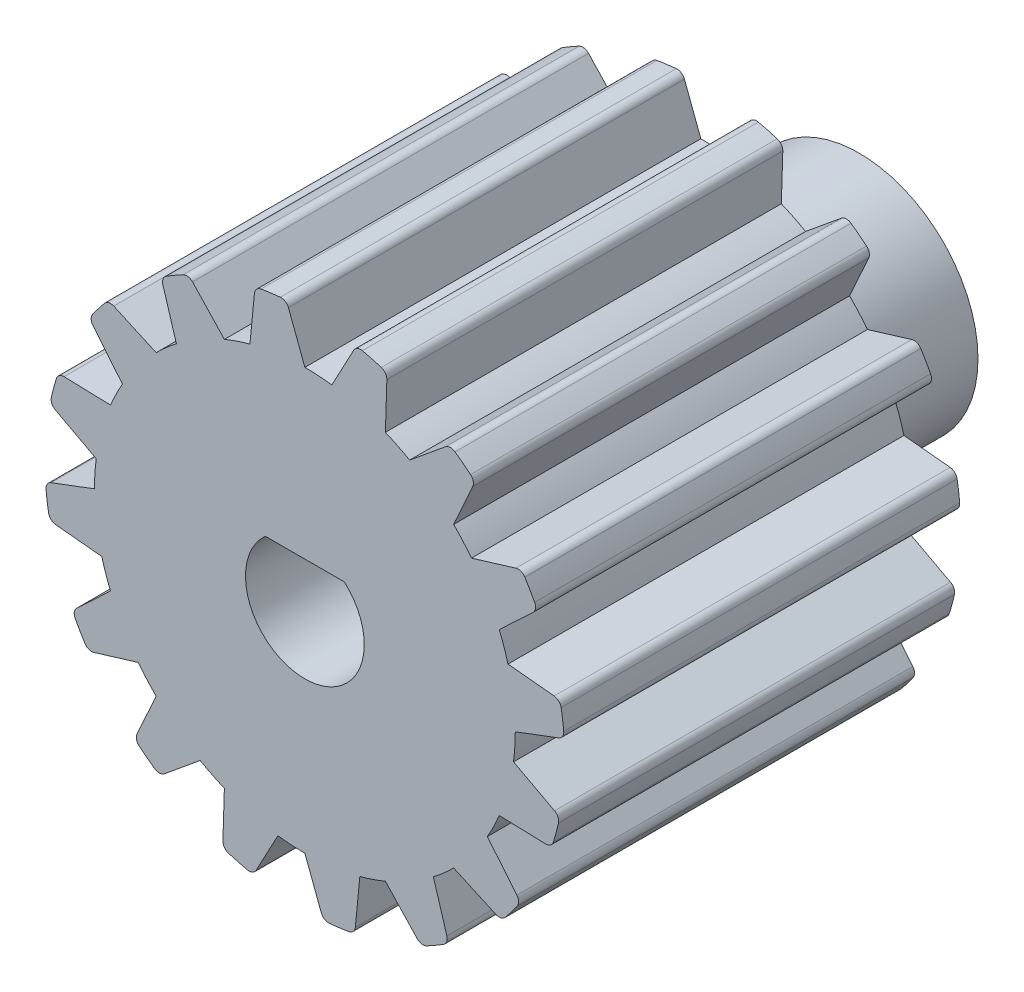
ISO-10303-21;
HEADER;
FILE_DESCRIPTION(('STEP AP214'),'2;1');
FILE_NAME('part.step','',(''),(''),'','','');
FILE_SCHEMA(('AUTOMOTIVE_DESIGN { 1 0 10303 214 1 1 1 1 }'));
ENDSEC;
DATA;
#1=APPLICATION_CONTEXT('core data for automotive mechanical design processes');
#2=APPLICATION_PROTOCOL_DEFINITION('international standard','automotive_design',2000,#1);
#3=PRODUCT_CONTEXT('',#1,'mechanical');
#4=PRODUCT('Part','Part','',(#3));
#5=PRODUCT_RELATED_PRODUCT_CATEGORY('part','',(#4));
#6=PRODUCT_DEFINITION_FORMATION('','',#4);
#7=PRODUCT_DEFINITION_CONTEXT('part definition',#1,'design');
#8=PRODUCT_DEFINITION('design','',#6,#7);
#9=PRODUCT_DEFINITION_SHAPE('','',#8);
#10=(LENGTH_UNIT() NAMED_UNIT(*) SI_UNIT(.MILLI.,.METRE.));
#11=(NAMED_UNIT(*) PLANE_ANGLE_UNIT() SI_UNIT($,.RADIAN.));
#12=(NAMED_UNIT(*) SI_UNIT($,.STERADIAN.) SOLID_ANGLE_UNIT());
#13=UNCERTAINTY_MEASURE_WITH_UNIT(LENGTH_MEASURE(1.E-05),#10,'distance_accuracy_value','');
#14=(GEOMETRIC_REPRESENTATION_CONTEXT(3) GLOBAL_UNCERTAINTY_ASSIGNED_CONTEXT((#13)) GLOBAL_UNIT_ASSIGNED_CONTEXT((#10,
#11,#12)) REPRESENTATION_CONTEXT('',''));
#15=CARTESIAN_POINT('',(0.,0.,0.));
#16=DIRECTION('',(0.,0.,1.));
#17=DIRECTION('',(1.,0.,0.));
#18=AXIS2_PLACEMENT_3D('',#15,#16,#17);
#19=CARTESIAN_POINT('',(0.,0.,15.));
#20=DIRECTION('',(0.,0.,-1.));
#21=DIRECTION('',(-1.,0.,0.));
#22=AXIS2_PLACEMENT_3D('',#19,#20,#21);
#23=CYLINDRICAL_SURFACE('',#22,7.97022222);
#24=CARTESIAN_POINT('',(0.,0.,0.));
#25=DIRECTION('',(0.,0.,1.));
#26=DIRECTION('',(1.,0.,0.));
#27=AXIS2_PLACEMENT_3D('',#24,#25,#26);
#28=CIRCLE('',#27,7.97022222);
#29=CARTESIAN_POINT('',(1.02096360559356,7.90456042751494,0.));
#30=VERTEX_POINT('',#29);
#31=CARTESIAN_POINT('',(0.,7.97022222,0.));
#32=VERTEX_POINT('',#31);
#33=EDGE_CURVE('E683',#30,#32,#28,.T.);
#34=ORIENTED_EDGE('',*,*,#33,.T.);
#35=DIRECTION('',(0.,0.,-1.));
#36=VECTOR('',#35,1.);
#37=CARTESIAN_POINT('',(0.,7.97022222,15.));
#38=LINE('',#37,#36);
#39=CARTESIAN_POINT('',(0.,7.97022222,15.));
#40=VERTEX_POINT('',#39);
#41=EDGE_CURVE('E59',#40,#32,#38,.T.);
#42=ORIENTED_EDGE('',*,*,#41,.F.);
#43=CARTESIAN_POINT('',(0.,0.,15.));
#44=DIRECTION('',(0.,0.,1.));
#45=DIRECTION('',(1.,0.,0.));
#46=AXIS2_PLACEMENT_3D('',#43,#44,#45);
#47=CIRCLE('',#46,7.97022222);
#48=CARTESIAN_POINT('',(1.02096360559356,7.90456042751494,15.));
#49=VERTEX_POINT('',#48);
#50=EDGE_CURVE('E684',#49,#40,#47,.T.);
#51=ORIENTED_EDGE('',*,*,#50,.F.);
#52=DIRECTION('',(0.,0.,-1.));
#53=VECTOR('',#52,1.);
#54=CARTESIAN_POINT('',(1.02096360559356,7.90456042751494,15.));
#55=LINE('',#54,#53);
#56=EDGE_CURVE('E974',#49,#30,#55,.T.);
#57=ORIENTED_EDGE('',*,*,#56,.T.);
#58=EDGE_LOOP('',(#34,#42,#51,#57));
#59=FACE_BOUND('',#58,.T.);
#60=ADVANCED_FACE('F51',(#59),#23,.T.);
#61=CARTESIAN_POINT('',(0.,7.97022222,15.));
#62=DIRECTION('',(-0.935442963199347,-0.353477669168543,0.));
#63=DIRECTION('',(0.353477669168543,-0.935442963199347,0.));
#64=AXIS2_PLACEMENT_3D('',#61,#62,#63);
#65=PLANE('',#64);
#66=DIRECTION('',(-0.353477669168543,0.935442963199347,0.));
#67=VECTOR('',#66,1.);
#68=CARTESIAN_POINT('',(0.,7.97022222,0.));
#69=LINE('',#68,#67);
#70=CARTESIAN_POINT('',(-0.622120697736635,9.61660183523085,0.));
#71=VERTEX_POINT('',#70);
#72=EDGE_CURVE('E978',#32,#71,#69,.T.);
#73=ORIENTED_EDGE('',*,*,#72,.T.);
#74=DIRECTION('',(0.,0.,-1.));
#75=VECTOR('',#74,1.);
#76=CARTESIAN_POINT('',(-0.622120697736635,9.61660183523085,15.));
#77=LINE('',#76,#75);
#78=CARTESIAN_POINT('',(-0.622120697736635,9.61660183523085,15.));
#79=VERTEX_POINT('',#78);
#80=EDGE_CURVE('E1637',#79,#71,#77,.T.);
#81=ORIENTED_EDGE('',*,*,#80,.F.);
#82=DIRECTION('',(-0.353477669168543,0.935442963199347,0.));
#83=VECTOR('',#82,1.);
#84=CARTESIAN_POINT('',(0.,7.97022222,15.));
#85=LINE('',#84,#83);
#86=EDGE_CURVE('E688',#40,#79,#85,.T.);
#87=ORIENTED_EDGE('',*,*,#86,.F.);
#88=ORIENTED_EDGE('',*,*,#41,.T.);
#89=EDGE_LOOP('',(#73,#81,#87,#88));
#90=FACE_BOUND('',#89,.T.);
#91=ADVANCED_FACE('F1644',(#90),#65,.F.);
#92=CARTESIAN_POINT('',(-0.901521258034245,9.50735291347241,15.));
#93=DIRECTION('',(0.,0.,-1.));
#94=DIRECTION('',(-1.,0.,0.));
#95=AXIS2_PLACEMENT_3D('',#92,#93,#94);
#96=CYLINDRICAL_SURFACE('',#95,0.299999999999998);
#97=CARTESIAN_POINT('',(-0.901521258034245,9.50735291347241,0.));
#98=DIRECTION('',(0.,0.,1.));
#99=DIRECTION('',(-1.,0.,0.));
#100=AXIS2_PLACEMENT_3D('',#97,#98,#99);
#101=CIRCLE('',#100,0.299999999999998);
#102=CARTESIAN_POINT('',(-0.929841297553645,9.80601321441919,0.));
#103=VERTEX_POINT('',#102);
#104=EDGE_CURVE('E981',#71,#103,#101,.T.);
#105=ORIENTED_EDGE('',*,*,#104,.T.);
#106=DIRECTION('',(0.,0.,-1.));
#107=VECTOR('',#106,1.);
#108=CARTESIAN_POINT('',(-0.929841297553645,9.80601321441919,15.));
#109=LINE('',#108,#107);
#110=CARTESIAN_POINT('',(-0.929841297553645,9.80601321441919,15.));
#111=VERTEX_POINT('',#110);
#112=EDGE_CURVE('E1633',#111,#103,#109,.T.);
#113=ORIENTED_EDGE('',*,*,#112,.F.);
#114=CARTESIAN_POINT('',(-0.901521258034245,9.50735291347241,15.));
#115=DIRECTION('',(0.,0.,1.));
#116=DIRECTION('',(-1.,0.,0.));
#117=AXIS2_PLACEMENT_3D('',#114,#115,#116);
#118=CIRCLE('',#117,0.299999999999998);
#119=EDGE_CURVE('E692',#79,#111,#118,.T.);
#120=ORIENTED_EDGE('',*,*,#119,.F.);
#121=ORIENTED_EDGE('',*,*,#80,.T.);
#122=EDGE_LOOP('',(#105,#113,#120,#121));
#123=FACE_BOUND('',#122,.T.);
#124=ADVANCED_FACE('F1659',(#123),#96,.T.);
#125=CARTESIAN_POINT('',(0.,0.,15.));
#126=DIRECTION('',(0.,0.,-1.));
#127=DIRECTION('',(-1.,0.,0.));
#128=AXIS2_PLACEMENT_3D('',#125,#126,#127);
#129=CYLINDRICAL_SURFACE('',#128,9.85);
#130=CARTESIAN_POINT('',(0.,0.,0.));
#131=DIRECTION('',(0.,0.,1.));
#132=DIRECTION('',(1.,0.,0.));
#133=AXIS2_PLACEMENT_3D('',#130,#131,#132);
#134=CIRCLE('',#133,9.85);
#135=CARTESIAN_POINT('',(-1.66361119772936,9.70849616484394,0.));
#136=VERTEX_POINT('',#135);
#137=EDGE_CURVE('E984',#103,#136,#134,.T.);
#138=ORIENTED_EDGE('',*,*,#137,.T.);
#139=DIRECTION('',(0.,0.,-1.));
#140=VECTOR('',#139,1.);
#141=CARTESIAN_POINT('',(-1.66361119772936,9.70849616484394,15.));
#142=LINE('',#141,#140);
#143=CARTESIAN_POINT('',(-1.66361119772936,9.70849616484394,15.));
#144=VERTEX_POINT('',#143);
#145=EDGE_CURVE('E1629',#144,#136,#142,.T.);
#146=ORIENTED_EDGE('',*,*,#145,.F.);
#147=CARTESIAN_POINT('',(0.,0.,15.));
#148=DIRECTION('',(0.,0.,1.));
#149=DIRECTION('',(1.,0.,0.));
#150=AXIS2_PLACEMENT_3D('',#147,#148,#149);
#151=CIRCLE('',#150,9.85);
#152=EDGE_CURVE('E695',#111,#144,#151,.T.);
#153=ORIENTED_EDGE('',*,*,#152,.F.);
#154=ORIENTED_EDGE('',*,*,#112,.T.);
#155=EDGE_LOOP('',(#138,#146,#153,#154));
#156=FACE_BOUND('',#155,.T.);
#157=ADVANCED_FACE('F1663',(#156),#129,.T.);
#158=CARTESIAN_POINT('',(-1.61294283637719,9.41280592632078,15.));
#159=DIRECTION('',(0.,0.,-1.));
#160=DIRECTION('',(-1.,0.,0.));
#161=AXIS2_PLACEMENT_3D('',#158,#159,#160);
#162=CYLINDRICAL_SURFACE('',#161,0.299999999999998);
#163=CARTESIAN_POINT('',(-1.61294283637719,9.41280592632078,0.));
#164=DIRECTION('',(0.,0.,1.));
#165=DIRECTION('',(1.,0.,0.));
#166=AXIS2_PLACEMENT_3D('',#163,#164,#165);
#167=CIRCLE('',#166,0.299999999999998);
#168=CARTESIAN_POINT('',(-1.91117921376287,9.44528766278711,0.));
#169=VERTEX_POINT('',#168);
#170=EDGE_CURVE('E987',#136,#169,#167,.T.);
#171=ORIENTED_EDGE('',*,*,#170,.T.);
#172=DIRECTION('',(0.,0.,-1.));
#173=VECTOR('',#172,1.);
#174=CARTESIAN_POINT('',(-1.91117921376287,9.44528766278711,15.));
#175=LINE('',#174,#173);
#176=CARTESIAN_POINT('',(-1.91117921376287,9.44528766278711,15.));
#177=VERTEX_POINT('',#176);
#178=EDGE_CURVE('E1625',#177,#169,#175,.T.);
#179=ORIENTED_EDGE('',*,*,#178,.F.);
#180=CARTESIAN_POINT('',(-1.61294283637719,9.41280592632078,15.));
#181=DIRECTION('',(0.,0.,1.));
#182=DIRECTION('',(1.,0.,0.));
#183=AXIS2_PLACEMENT_3D('',#180,#181,#182);
#184=CIRCLE('',#183,0.299999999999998);
#185=EDGE_CURVE('E698',#144,#177,#184,.T.);
#186=ORIENTED_EDGE('',*,*,#185,.F.);
#187=ORIENTED_EDGE('',*,*,#145,.T.);
#188=EDGE_LOOP('',(#171,#179,#186,#187));
#189=FACE_BOUND('',#188,.T.);
#190=ADVANCED_FACE('F2122',(#189),#162,.T.);
#191=CARTESIAN_POINT('',(-2.08169693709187,7.6935674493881,15.));
#192=DIRECTION('',(0.995295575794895,-0.0968850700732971,0.));
#193=DIRECTION('',(0.0968850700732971,0.995295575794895,0.));
#194=AXIS2_PLACEMENT_3D('',#191,#192,#193);
#195=PLANE('',#194);
#196=DIRECTION('',(-0.0968850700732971,-0.995295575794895,0.));
#197=VECTOR('',#196,1.);
#198=CARTESIAN_POINT('',(-2.08169693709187,7.6935674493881,0.));
#199=LINE('',#198,#197);
#200=CARTESIAN_POINT('',(-2.08169693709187,7.6935674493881,0.));
#201=VERTEX_POINT('',#200);
#202=EDGE_CURVE('E990',#169,#201,#199,.T.);
#203=ORIENTED_EDGE('',*,*,#202,.T.);
#204=DIRECTION('',(0.,0.,-1.));
#205=VECTOR('',#204,1.);
#206=CARTESIAN_POINT('',(-2.08169693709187,7.6935674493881,15.));
#207=LINE('',#206,#205);
#208=CARTESIAN_POINT('',(-2.08169693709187,7.6935674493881,15.));
#209=VERTEX_POINT('',#208);
#210=EDGE_CURVE('E1621',#209,#201,#207,.T.);
#211=ORIENTED_EDGE('',*,*,#210,.F.);
#212=DIRECTION('',(-0.0968850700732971,-0.995295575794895,0.));
#213=VECTOR('',#212,1.);
#214=CARTESIAN_POINT('',(-2.08169693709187,7.6935674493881,15.));
#215=LINE('',#214,#213);
#216=EDGE_CURVE('E701',#177,#209,#215,.T.);
#217=ORIENTED_EDGE('',*,*,#216,.F.);
#218=ORIENTED_EDGE('',*,*,#178,.T.);
#219=EDGE_LOOP('',(#203,#211,#217,#218));
#220=FACE_BOUND('',#219,.T.);
#221=ADVANCED_FACE('F2120',(#220),#195,.F.);
#222=CARTESIAN_POINT('',(0.,0.,15.));
#223=DIRECTION('',(0.,0.,-1.));
#224=DIRECTION('',(-1.,0.,0.));
#225=AXIS2_PLACEMENT_3D('',#222,#223,#224);
#226=CYLINDRICAL_SURFACE('',#225,7.97022222);
#227=CARTESIAN_POINT('',(0.,0.,0.));
#228=DIRECTION('',(0.,0.,1.));
#229=DIRECTION('',(1.,0.,0.));
#230=AXIS2_PLACEMENT_3D('',#227,#228,#229);
#231=CIRCLE('',#230,7.97022222);
#232=CARTESIAN_POINT('',(-3.05007199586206,7.36352517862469,0.));
#233=VERTEX_POINT('',#232);
#234=EDGE_CURVE('E993',#201,#233,#231,.T.);
#235=ORIENTED_EDGE('',*,*,#234,.T.);
#236=DIRECTION('',(0.,0.,-1.));
#237=VECTOR('',#236,1.);
#238=CARTESIAN_POINT('',(-3.05007199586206,7.36352517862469,15.));
#239=LINE('',#238,#237);
#240=CARTESIAN_POINT('',(-3.05007199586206,7.36352517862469,15.));
#241=VERTEX_POINT('',#240);
#242=EDGE_CURVE('E1617',#241,#233,#239,.T.);
#243=ORIENTED_EDGE('',*,*,#242,.F.);
#244=CARTESIAN_POINT('',(0.,0.,15.));
#245=DIRECTION('',(0.,0.,1.));
#246=DIRECTION('',(1.,0.,0.));
#247=AXIS2_PLACEMENT_3D('',#244,#245,#246);
#248=CIRCLE('',#247,7.97022222);
#249=EDGE_CURVE('E704',#209,#241,#248,.T.);
#250=ORIENTED_EDGE('',*,*,#249,.F.);
#251=ORIENTED_EDGE('',*,*,#210,.T.);
#252=EDGE_LOOP('',(#235,#243,#250,#251));
#253=FACE_BOUND('',#252,.T.);
#254=ADVANCED_FACE('F2115',(#253),#226,.T.);
#255=CARTESIAN_POINT('',(-3.05007199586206,7.36352517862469,15.));
#256=DIRECTION('',(-0.72896655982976,-0.684549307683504,0.));
#257=DIRECTION('',(0.684549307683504,-0.72896655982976,0.));
#258=AXIS2_PLACEMENT_3D('',#255,#256,#257);
#259=PLANE('',#258);
#260=DIRECTION('',(-0.684549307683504,0.72896655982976,0.));
#261=VECTOR('',#260,1.);
#262=CARTESIAN_POINT('',(-3.05007199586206,7.36352517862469,0.));
#263=LINE('',#262,#261);
#264=CARTESIAN_POINT('',(-4.25487877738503,8.64650632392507,0.));
#265=VERTEX_POINT('',#264);
#266=EDGE_CURVE('E996',#233,#265,#263,.T.);
#267=ORIENTED_EDGE('',*,*,#266,.T.);
#268=DIRECTION('',(0.,0.,-1.));
#269=VECTOR('',#268,1.);
#270=CARTESIAN_POINT('',(-4.25487877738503,8.64650632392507,15.));
#271=LINE('',#270,#269);
#272=CARTESIAN_POINT('',(-4.25487877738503,8.64650632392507,15.));
#273=VERTEX_POINT('',#272);
#274=EDGE_CURVE('E1613',#273,#265,#271,.T.);
#275=ORIENTED_EDGE('',*,*,#274,.F.);
#276=DIRECTION('',(-0.684549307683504,0.72896655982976,0.));
#277=VECTOR('',#276,1.);
#278=CARTESIAN_POINT('',(-3.05007199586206,7.36352517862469,15.));
#279=LINE('',#278,#277);
#280=EDGE_CURVE('E707',#241,#273,#279,.T.);
#281=ORIENTED_EDGE('',*,*,#280,.F.);
#282=ORIENTED_EDGE('',*,*,#242,.T.);
#283=EDGE_LOOP('',(#267,#275,#281,#282));
#284=FACE_BOUND('',#283,.T.);
#285=ADVANCED_FACE('F2110',(#284),#259,.F.);
#286=CARTESIAN_POINT('',(-4.47120348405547,8.4386515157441,15.));
#287=DIRECTION('',(0.,0.,-1.));
#288=DIRECTION('',(-1.,0.,0.));
#289=AXIS2_PLACEMENT_3D('',#286,#287,#288);
#290=CYLINDRICAL_SURFACE('',#289,0.300000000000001);
#291=CARTESIAN_POINT('',(-4.47120348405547,8.4386515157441,0.));
#292=DIRECTION('',(0.,0.,1.));
#293=DIRECTION('',(-1.,0.,0.));
#294=AXIS2_PLACEMENT_3D('',#291,#292,#293);
#295=CIRCLE('',#294,0.300000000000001);
#296=CARTESIAN_POINT('',(-4.61166013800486,8.70374004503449,0.));
#297=VERTEX_POINT('',#296);
#298=EDGE_CURVE('E999',#265,#297,#295,.T.);
#299=ORIENTED_EDGE('',*,*,#298,.T.);
#300=DIRECTION('',(0.,0.,-1.));
#301=VECTOR('',#300,1.);
#302=CARTESIAN_POINT('',(-4.61166013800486,8.70374004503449,15.));
#303=LINE('',#302,#301);
#304=CARTESIAN_POINT('',(-4.61166013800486,8.70374004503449,15.));
#305=VERTEX_POINT('',#304);
#306=EDGE_CURVE('E1609',#305,#297,#303,.T.);
#307=ORIENTED_EDGE('',*,*,#306,.F.);
#308=CARTESIAN_POINT('',(-4.47120348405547,8.4386515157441,15.));
#309=DIRECTION('',(0.,0.,1.));
#310=DIRECTION('',(-1.,0.,0.));
#311=AXIS2_PLACEMENT_3D('',#308,#309,#310);
#312=CIRCLE('',#311,0.300000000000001);
#313=EDGE_CURVE('E710',#273,#305,#312,.T.);
#314=ORIENTED_EDGE('',*,*,#313,.F.);
#315=ORIENTED_EDGE('',*,*,#274,.T.);
#316=EDGE_LOOP('',(#299,#307,#314,#315));
#317=FACE_BOUND('',#316,.T.);
#318=ADVANCED_FACE('F2106',(#317),#290,.T.);
#319=CARTESIAN_POINT('',(0.,0.,15.));
#320=DIRECTION('',(0.,0.,-1.));
#321=DIRECTION('',(-1.,0.,0.));
#322=AXIS2_PLACEMENT_3D('',#319,#320,#321);
#323=CYLINDRICAL_SURFACE('',#322,9.85);
#324=CARTESIAN_POINT('',(0.,0.,0.));
#325=DIRECTION('',(0.,0.,1.));
#326=DIRECTION('',(1.,0.,0.));
#327=AXIS2_PLACEMENT_3D('',#324,#325,#326);
#328=CIRCLE('',#327,9.85);
#329=CARTESIAN_POINT('',(-5.25225697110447,8.33284445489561,0.));
#330=VERTEX_POINT('',#329);
#331=EDGE_CURVE('E1002',#297,#330,#328,.T.);
#332=ORIENTED_EDGE('',*,*,#331,.T.);
#333=DIRECTION('',(0.,0.,-1.));
#334=VECTOR('',#333,1.);
#335=CARTESIAN_POINT('',(-5.25225697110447,8.33284445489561,15.));
#336=LINE('',#335,#334);
#337=CARTESIAN_POINT('',(-5.25225697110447,8.33284445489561,15.));
#338=VERTEX_POINT('',#337);
#339=EDGE_CURVE('E1605',#338,#330,#336,.T.);
#340=ORIENTED_EDGE('',*,*,#339,.F.);
#341=CARTESIAN_POINT('',(0.,0.,15.));
#342=DIRECTION('',(0.,0.,1.));
#343=DIRECTION('',(1.,0.,0.));
#344=AXIS2_PLACEMENT_3D('',#341,#342,#343);
#345=CIRCLE('',#344,9.85);
#346=EDGE_CURVE('E713',#305,#338,#345,.T.);
#347=ORIENTED_EDGE('',*,*,#346,.F.);
#348=ORIENTED_EDGE('',*,*,#306,.T.);
#349=EDGE_LOOP('',(#332,#340,#347,#348));
#350=FACE_BOUND('',#349,.T.);
#351=ADVANCED_FACE('F2101',(#350),#323,.T.);
#352=CARTESIAN_POINT('',(-5.09228975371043,8.07905223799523,15.));
#353=DIRECTION('',(0.,0.,-1.));
#354=DIRECTION('',(-1.,0.,0.));
#355=AXIS2_PLACEMENT_3D('',#352,#353,#354);
#356=CYLINDRICAL_SURFACE('',#355,0.300000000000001);
#357=CARTESIAN_POINT('',(-5.09228975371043,8.07905223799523,0.));
#358=DIRECTION('',(0.,0.,1.));
#359=DIRECTION('',(1.,0.,0.));
#360=AXIS2_PLACEMENT_3D('',#357,#358,#359);
#361=CIRCLE('',#360,0.300000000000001);
#362=CARTESIAN_POINT('',(-5.38025446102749,7.99493132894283,0.));
#363=VERTEX_POINT('',#362);
#364=EDGE_CURVE('E1005',#330,#363,#361,.T.);
#365=ORIENTED_EDGE('',*,*,#364,.T.);
#366=DIRECTION('',(0.,0.,-1.));
#367=VECTOR('',#366,1.);
#368=CARTESIAN_POINT('',(-5.38025446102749,7.99493132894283,15.));
#369=LINE('',#368,#367);
#370=CARTESIAN_POINT('',(-5.38025446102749,7.99493132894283,15.));
#371=VERTEX_POINT('',#370);
#372=EDGE_CURVE('E1601',#371,#363,#369,.T.);
#373=ORIENTED_EDGE('',*,*,#372,.F.);
#374=CARTESIAN_POINT('',(-5.09228975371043,8.07905223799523,15.));
#375=DIRECTION('',(0.,0.,1.));
#376=DIRECTION('',(1.,0.,0.));
#377=AXIS2_PLACEMENT_3D('',#374,#375,#376);
#378=CIRCLE('',#377,0.300000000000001);
#379=EDGE_CURVE('E716',#338,#371,#378,.T.);
#380=ORIENTED_EDGE('',*,*,#379,.F.);
#381=ORIENTED_EDGE('',*,*,#339,.T.);
#382=EDGE_LOOP('',(#365,#373,#380,#381));
#383=FACE_BOUND('',#382,.T.);
#384=ADVANCED_FACE('F2095',(#383),#356,.T.);
#385=CARTESIAN_POINT('',(-4.86743799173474,6.31129856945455,15.));
#386=DIRECTION('',(0.956609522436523,0.291372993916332,0.));
#387=DIRECTION('',(-0.291372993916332,0.956609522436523,0.));
#388=AXIS2_PLACEMENT_3D('',#385,#386,#387);
#389=PLANE('',#388);
#390=DIRECTION('',(0.291372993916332,-0.956609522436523,0.));
#391=VECTOR('',#390,1.);
#392=CARTESIAN_POINT('',(-4.86743799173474,6.31129856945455,0.));
#393=LINE('',#392,#391);
#394=CARTESIAN_POINT('',(-4.86743799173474,6.31129856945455,0.));
#395=VERTEX_POINT('',#394);
#396=EDGE_CURVE('E1008',#363,#395,#393,.T.);
#397=ORIENTED_EDGE('',*,*,#396,.T.);
#398=DIRECTION('',(0.,0.,-1.));
#399=VECTOR('',#398,1.);
#400=CARTESIAN_POINT('',(-4.86743799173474,6.31129856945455,15.));
#401=LINE('',#400,#399);
#402=CARTESIAN_POINT('',(-4.86743799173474,6.31129856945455,15.));
#403=VERTEX_POINT('',#402);
#404=EDGE_CURVE('E1597',#403,#395,#401,.T.);
#405=ORIENTED_EDGE('',*,*,#404,.F.);
#406=DIRECTION('',(0.291372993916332,-0.956609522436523,0.));
#407=VECTOR('',#406,1.);
#408=CARTESIAN_POINT('',(-4.86743799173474,6.31129856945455,15.));
#409=LINE('',#408,#407);
#410=EDGE_CURVE('E719',#371,#403,#409,.T.);
#411=ORIENTED_EDGE('',*,*,#410,.F.);
#412=ORIENTED_EDGE('',*,*,#372,.T.);
#413=EDGE_LOOP('',(#397,#405,#411,#412));
#414=FACE_BOUND('',#413,.T.);
#415=ADVANCED_FACE('F2091',(#414),#389,.F.);
#416=CARTESIAN_POINT('',(0.,0.,15.));
#417=DIRECTION('',(0.,0.,-1.));
#418=DIRECTION('',(-1.,0.,0.));
#419=AXIS2_PLACEMENT_3D('',#416,#417,#418);
#420=CYLINDRICAL_SURFACE('',#419,7.97022222);
#421=CARTESIAN_POINT('',(0.,0.,0.));
#422=DIRECTION('',(0.,0.,1.));
#423=DIRECTION('',(1.,0.,0.));
#424=AXIS2_PLACEMENT_3D('',#421,#422,#423);
#425=CIRCLE('',#424,7.97022222);
#426=CARTESIAN_POINT('',(-5.63579817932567,5.63579817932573,0.));
#427=VERTEX_POINT('',#426);
#428=EDGE_CURVE('E1011',#395,#427,#425,.T.);
#429=ORIENTED_EDGE('',*,*,#428,.T.);
#430=DIRECTION('',(0.,0.,-1.));
#431=VECTOR('',#430,1.);
#432=CARTESIAN_POINT('',(-5.63579817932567,5.63579817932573,15.));
#433=LINE('',#432,#431);
#434=CARTESIAN_POINT('',(-5.63579817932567,5.63579817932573,15.));
#435=VERTEX_POINT('',#434);
#436=EDGE_CURVE('E1593',#435,#427,#433,.T.);
#437=ORIENTED_EDGE('',*,*,#436,.F.);
#438=CARTESIAN_POINT('',(0.,0.,15.));
#439=DIRECTION('',(0.,0.,1.));
#440=DIRECTION('',(1.,0.,0.));
#441=AXIS2_PLACEMENT_3D('',#438,#439,#440);
#442=CIRCLE('',#441,7.97022222);
#443=EDGE_CURVE('E722',#403,#435,#442,.T.);
#444=ORIENTED_EDGE('',*,*,#443,.F.);
#445=ORIENTED_EDGE('',*,*,#404,.T.);
#446=EDGE_LOOP('',(#429,#437,#444,#445));
#447=FACE_BOUND('',#446,.T.);
#448=ADVANCED_FACE('F2086',(#447),#420,.T.);
#449=CARTESIAN_POINT('',(-5.63579817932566,5.63579817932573,15.));
#450=DIRECTION('',(-0.411511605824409,-0.911404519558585,0.));
#451=DIRECTION('',(0.911404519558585,-0.411511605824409,0.));
#452=AXIS2_PLACEMENT_3D('',#449,#450,#451);
#453=PLANE('',#452);
#454=DIRECTION('',(-0.911404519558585,0.411511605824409,0.));
#455=VECTOR('',#454,1.);
#456=CARTESIAN_POINT('',(-5.63579817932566,5.63579817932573,0.));
#457=LINE('',#456,#455);
#458=CARTESIAN_POINT('',(-7.23987013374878,6.36005860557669,0.));
#459=VERTEX_POINT('',#458);
#460=EDGE_CURVE('E1014',#427,#459,#457,.T.);
#461=ORIENTED_EDGE('',*,*,#460,.T.);
#462=DIRECTION('',(0.,0.,-1.));
#463=VECTOR('',#462,1.);
#464=CARTESIAN_POINT('',(-7.23987013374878,6.36005860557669,15.));
#465=LINE('',#464,#463);
#466=CARTESIAN_POINT('',(-7.23987013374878,6.36005860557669,15.));
#467=VERTEX_POINT('',#466);
#468=EDGE_CURVE('E1589',#467,#459,#465,.T.);
#469=ORIENTED_EDGE('',*,*,#468,.F.);
#470=DIRECTION('',(-0.911404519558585,0.411511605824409,0.));
#471=VECTOR('',#470,1.);
#472=CARTESIAN_POINT('',(-5.63579817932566,5.63579817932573,15.));
#473=LINE('',#472,#471);
#474=EDGE_CURVE('E725',#435,#467,#473,.T.);
#475=ORIENTED_EDGE('',*,*,#474,.F.);
#476=ORIENTED_EDGE('',*,*,#436,.T.);
#477=EDGE_LOOP('',(#461,#469,#475,#476));
#478=FACE_BOUND('',#477,.T.);
#479=ADVANCED_FACE('F2080',(#478),#453,.F.);
#480=CARTESIAN_POINT('',(-7.36018551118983,6.08524192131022,15.));
#481=DIRECTION('',(0.,0.,-1.));
#482=DIRECTION('',(-1.,0.,0.));
#483=AXIS2_PLACEMENT_3D('',#480,#481,#482);
#484=CYLINDRICAL_SURFACE('',#483,0.3);
#485=CARTESIAN_POINT('',(-7.36018551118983,6.08524192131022,0.));
#486=DIRECTION('',(0.,0.,1.));
#487=DIRECTION('',(-1.,0.,0.));
#488=AXIS2_PLACEMENT_3D('',#485,#486,#487);
#489=CIRCLE('',#488,0.3);
#490=CARTESIAN_POINT('',(-7.59139552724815,6.27640135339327,0.));
#491=VERTEX_POINT('',#490);
#492=EDGE_CURVE('E1017',#459,#491,#489,.T.);
#493=ORIENTED_EDGE('',*,*,#492,.T.);
#494=DIRECTION('',(0.,0.,-1.));
#495=VECTOR('',#494,1.);
#496=CARTESIAN_POINT('',(-7.59139552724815,6.27640135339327,15.));
#497=LINE('',#496,#495);
#498=CARTESIAN_POINT('',(-7.59139552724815,6.27640135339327,15.));
#499=VERTEX_POINT('',#498);
#500=EDGE_CURVE('E1585',#499,#491,#497,.T.);
#501=ORIENTED_EDGE('',*,*,#500,.F.);
#502=CARTESIAN_POINT('',(-7.36018551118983,6.08524192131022,15.));
#503=DIRECTION('',(0.,0.,1.));
#504=DIRECTION('',(-1.,0.,0.));
#505=AXIS2_PLACEMENT_3D('',#502,#503,#504);
#506=CIRCLE('',#505,0.3);
#507=EDGE_CURVE('E728',#467,#499,#506,.T.);
#508=ORIENTED_EDGE('',*,*,#507,.F.);
#509=ORIENTED_EDGE('',*,*,#468,.T.);
#510=EDGE_LOOP('',(#493,#501,#508,#509));
#511=FACE_BOUND('',#510,.T.);
#512=ADVANCED_FACE('F2076',(#511),#484,.T.);
#513=CARTESIAN_POINT('',(0.,0.,15.));
#514=DIRECTION('',(0.,0.,-1.));
#515=DIRECTION('',(-1.,0.,0.));
#516=AXIS2_PLACEMENT_3D('',#513,#514,#515);
#517=CYLINDRICAL_SURFACE('',#516,9.85);
#518=CARTESIAN_POINT('',(0.,0.,0.));
#519=DIRECTION('',(0.,0.,1.));
#520=DIRECTION('',(1.,0.,0.));
#521=AXIS2_PLACEMENT_3D('',#518,#519,#520);
#522=CIRCLE('',#521,9.85);
#523=CARTESIAN_POINT('',(-8.04129423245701,5.68859271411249,0.));
#524=VERTEX_POINT('',#523);
#525=EDGE_CURVE('E1020',#491,#524,#522,.T.);
#526=ORIENTED_EDGE('',*,*,#525,.T.);
#527=DIRECTION('',(0.,0.,-1.));
#528=VECTOR('',#527,1.);
#529=CARTESIAN_POINT('',(-8.04129423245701,5.68859271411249,15.));
#530=LINE('',#529,#528);
#531=CARTESIAN_POINT('',(-8.04129423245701,5.68859271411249,15.));
#532=VERTEX_POINT('',#531);
#533=EDGE_CURVE('E1581',#532,#524,#530,.T.);
#534=ORIENTED_EDGE('',*,*,#533,.F.);
#535=CARTESIAN_POINT('',(0.,0.,15.));
#536=DIRECTION('',(0.,0.,1.));
#537=DIRECTION('',(1.,0.,0.));
#538=AXIS2_PLACEMENT_3D('',#535,#536,#537);
#539=CIRCLE('',#538,9.85);
#540=EDGE_CURVE('E731',#499,#532,#539,.T.);
#541=ORIENTED_EDGE('',*,*,#540,.F.);
#542=ORIENTED_EDGE('',*,*,#500,.T.);
#543=EDGE_LOOP('',(#526,#534,#541,#542));
#544=FACE_BOUND('',#543,.T.);
#545=ADVANCED_FACE('F2071',(#544),#517,.T.);
#546=CARTESIAN_POINT('',(-7.79638171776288,5.51533608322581,15.));
#547=DIRECTION('',(0.,0.,-1.));
#548=DIRECTION('',(-1.,0.,0.));
#549=AXIS2_PLACEMENT_3D('',#546,#547,#548);
#550=CYLINDRICAL_SURFACE('',#549,0.300000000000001);
#551=CARTESIAN_POINT('',(-7.79638171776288,5.51533608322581,0.));
#552=DIRECTION('',(0.,0.,1.));
#553=DIRECTION('',(1.,0.,0.));
#554=AXIS2_PLACEMENT_3D('',#551,#552,#553);
#555=CIRCLE('',#554,0.300000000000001);
#556=CARTESIAN_POINT('',(-8.03023473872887,5.32741917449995,0.));
#557=VERTEX_POINT('',#556);
#558=EDGE_CURVE('E1023',#524,#557,#555,.T.);
#559=ORIENTED_EDGE('',*,*,#558,.T.);
#560=DIRECTION('',(0.,0.,-1.));
#561=VECTOR('',#560,1.);
#562=CARTESIAN_POINT('',(-8.03023473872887,5.32741917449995,15.));
#563=LINE('',#562,#561);
#564=CARTESIAN_POINT('',(-8.03023473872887,5.32741917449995,15.));
#565=VERTEX_POINT('',#564);
#566=EDGE_CURVE('E1577',#565,#557,#563,.T.);
#567=ORIENTED_EDGE('',*,*,#566,.F.);
#568=CARTESIAN_POINT('',(-7.79638171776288,5.51533608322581,15.));
#569=DIRECTION('',(0.,0.,1.));
#570=DIRECTION('',(1.,0.,0.));
#571=AXIS2_PLACEMENT_3D('',#568,#569,#570);
#572=CIRCLE('',#571,0.300000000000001);
#573=EDGE_CURVE('E734',#532,#565,#572,.T.);
#574=ORIENTED_EDGE('',*,*,#573,.F.);
#575=ORIENTED_EDGE('',*,*,#533,.T.);
#576=EDGE_LOOP('',(#559,#567,#574,#575));
#577=FACE_BOUND('',#576,.T.);
#578=ADVANCED_FACE('F2065',(#577),#550,.T.);
#579=CARTESIAN_POINT('',(-6.91215573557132,3.96819169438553,15.));
#580=DIRECTION('',(0.772288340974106,0.635272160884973,0.));
#581=DIRECTION('',(-0.635272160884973,0.772288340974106,0.));
#582=AXIS2_PLACEMENT_3D('',#579,#580,#581);
#583=PLANE('',#582);
#584=DIRECTION('',(0.635272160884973,-0.772288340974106,0.));
#585=VECTOR('',#584,1.);
#586=CARTESIAN_POINT('',(-6.91215573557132,3.96819169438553,0.));
#587=LINE('',#586,#585);
#588=CARTESIAN_POINT('',(-6.91215573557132,3.96819169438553,0.));
#589=VERTEX_POINT('',#588);
#590=EDGE_CURVE('E1026',#557,#589,#587,.T.);
#591=ORIENTED_EDGE('',*,*,#590,.T.);
#592=DIRECTION('',(0.,0.,-1.));
#593=VECTOR('',#592,1.);
#594=CARTESIAN_POINT('',(-6.91215573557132,3.96819169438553,15.));
#595=LINE('',#594,#593);
#596=CARTESIAN_POINT('',(-6.91215573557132,3.96819169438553,15.));
#597=VERTEX_POINT('',#596);
#598=EDGE_CURVE('E1573',#597,#589,#595,.T.);
#599=ORIENTED_EDGE('',*,*,#598,.F.);
#600=DIRECTION('',(0.635272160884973,-0.772288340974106,0.));
#601=VECTOR('',#600,1.);
#602=CARTESIAN_POINT('',(-6.91215573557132,3.96819169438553,15.));
#603=LINE('',#602,#601);
#604=EDGE_CURVE('E737',#565,#597,#603,.T.);
#605=ORIENTED_EDGE('',*,*,#604,.F.);
#606=ORIENTED_EDGE('',*,*,#566,.T.);
#607=EDGE_LOOP('',(#591,#599,#605,#606));
#608=FACE_BOUND('',#607,.T.);
#609=ADVANCED_FACE('F2061',(#608),#583,.F.);
#610=CARTESIAN_POINT('',(0.,0.,15.));
#611=DIRECTION('',(0.,0.,-1.));
#612=DIRECTION('',(-1.,0.,0.));
#613=AXIS2_PLACEMENT_3D('',#610,#611,#612);
#614=CYLINDRICAL_SURFACE('',#613,7.97022222);
#615=CARTESIAN_POINT('',(0.,0.,0.));
#616=DIRECTION('',(0.,0.,1.));
#617=DIRECTION('',(1.,0.,0.));
#618=AXIS2_PLACEMENT_3D('',#615,#616,#617);
#619=CIRCLE('',#618,7.97022222);
#620=CARTESIAN_POINT('',(-7.36352517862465,3.05007199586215,0.));
#621=VERTEX_POINT('',#620);
#622=EDGE_CURVE('E1029',#589,#621,#619,.T.);
#623=ORIENTED_EDGE('',*,*,#622,.T.);
#624=DIRECTION('',(0.,0.,-1.));
#625=VECTOR('',#624,1.);
#626=CARTESIAN_POINT('',(-7.36352517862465,3.05007199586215,15.));
#627=LINE('',#626,#625);
#628=CARTESIAN_POINT('',(-7.36352517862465,3.05007199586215,15.));
#629=VERTEX_POINT('',#628);
#630=EDGE_CURVE('E1569',#629,#621,#627,.T.);
#631=ORIENTED_EDGE('',*,*,#630,.F.);
#632=CARTESIAN_POINT('',(0.,0.,15.));
#633=DIRECTION('',(0.,0.,1.));
#634=DIRECTION('',(1.,0.,0.));
#635=AXIS2_PLACEMENT_3D('',#632,#633,#634);
#636=CIRCLE('',#635,7.97022222);
#637=EDGE_CURVE('E740',#597,#629,#636,.T.);
#638=ORIENTED_EDGE('',*,*,#637,.F.);
#639=ORIENTED_EDGE('',*,*,#598,.T.);
#640=EDGE_LOOP('',(#623,#631,#638,#639));
#641=FACE_BOUND('',#640,.T.);
#642=ADVANCED_FACE('F2056',(#641),#614,.T.);
#643=CARTESIAN_POINT('',(-7.36352517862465,3.05007199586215,15.));
#644=DIRECTION('',(-0.0314077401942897,-0.999506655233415,0.));
#645=DIRECTION('',(0.999506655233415,-0.0314077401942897,0.));
#646=AXIS2_PLACEMENT_3D('',#643,#644,#645);
#647=PLANE('',#646);
#648=DIRECTION('',(-0.999506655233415,0.0314077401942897,0.));
#649=VECTOR('',#648,1.);
#650=CARTESIAN_POINT('',(-7.36352517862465,3.05007199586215,0.));
#651=LINE('',#650,#649);
#652=CARTESIAN_POINT('',(-9.12265689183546,3.1053496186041,0.));
#653=VERTEX_POINT('',#652);
#654=EDGE_CURVE('E1032',#621,#653,#651,.T.);
#655=ORIENTED_EDGE('',*,*,#654,.T.);
#656=DIRECTION('',(0.,0.,-1.));
#657=VECTOR('',#656,1.);
#658=CARTESIAN_POINT('',(-9.12265689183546,3.1053496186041,15.));
#659=LINE('',#658,#657);
#660=CARTESIAN_POINT('',(-9.12265689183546,3.1053496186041,15.));
#661=VERTEX_POINT('',#660);
#662=EDGE_CURVE('E1565',#661,#653,#659,.T.);
#663=ORIENTED_EDGE('',*,*,#662,.F.);
#664=DIRECTION('',(-0.999506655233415,0.0314077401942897,0.));
#665=VECTOR('',#664,1.);
#666=CARTESIAN_POINT('',(-7.36352517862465,3.05007199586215,15.));
#667=LINE('',#666,#665);
#668=EDGE_CURVE('E743',#629,#661,#667,.T.);
#669=ORIENTED_EDGE('',*,*,#668,.F.);
#670=ORIENTED_EDGE('',*,*,#630,.T.);
#671=EDGE_LOOP('',(#655,#663,#669,#670));
#672=FACE_BOUND('',#671,.T.);
#673=ADVANCED_FACE('F2050',(#672),#647,.F.);
#674=CARTESIAN_POINT('',(-9.12864601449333,2.80540940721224,15.));
#675=DIRECTION('',(0.,0.,-1.));
#676=DIRECTION('',(-1.,0.,0.));
#677=AXIS2_PLACEMENT_3D('',#674,#675,#676);
#678=CYLINDRICAL_SURFACE('',#677,0.3);
#679=CARTESIAN_POINT('',(-9.12864601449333,2.80540940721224,0.));
#680=DIRECTION('',(0.,0.,1.));
#681=DIRECTION('',(-1.,0.,0.));
#682=AXIS2_PLACEMENT_3D('',#679,#680,#681);
#683=CIRCLE('',#682,0.3);
#684=CARTESIAN_POINT('',(-9.41540976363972,2.89353745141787,0.));
#685=VERTEX_POINT('',#684);
#686=EDGE_CURVE('E1035',#653,#685,#683,.T.);
#687=ORIENTED_EDGE('',*,*,#686,.T.);
#688=DIRECTION('',(0.,0.,-1.));
#689=VECTOR('',#688,1.);
#690=CARTESIAN_POINT('',(-9.41540976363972,2.89353745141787,15.));
#691=LINE('',#690,#689);
#692=CARTESIAN_POINT('',(-9.41540976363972,2.89353745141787,15.));
#693=VERTEX_POINT('',#692);
#694=EDGE_CURVE('E1561',#693,#685,#691,.T.);
#695=ORIENTED_EDGE('',*,*,#694,.F.);
#696=CARTESIAN_POINT('',(-9.12864601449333,2.80540940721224,15.));
#697=DIRECTION('',(0.,0.,1.));
#698=DIRECTION('',(-1.,0.,0.));
#699=AXIS2_PLACEMENT_3D('',#696,#697,#698);
#700=CIRCLE('',#699,0.3);
#701=EDGE_CURVE('E746',#661,#693,#700,.T.);
#702=ORIENTED_EDGE('',*,*,#701,.F.);
#703=ORIENTED_EDGE('',*,*,#662,.T.);
#704=EDGE_LOOP('',(#687,#695,#702,#703));
#705=FACE_BOUND('',#704,.T.);
#706=ADVANCED_FACE('F2046',(#705),#678,.T.);
#707=CARTESIAN_POINT('',(0.,0.,15.));
#708=DIRECTION('',(0.,0.,-1.));
#709=DIRECTION('',(-1.,0.,0.));
#710=AXIS2_PLACEMENT_3D('',#707,#708,#709);
#711=CYLINDRICAL_SURFACE('',#710,9.85);
#712=CARTESIAN_POINT('',(0.,0.,0.));
#713=DIRECTION('',(0.,0.,1.));
#714=DIRECTION('',(1.,0.,0.));
#715=AXIS2_PLACEMENT_3D('',#712,#713,#714);
#716=CIRCLE('',#715,9.85);
#717=CARTESIAN_POINT('',(-9.6061173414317,2.17830429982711,0.));
#718=VERTEX_POINT('',#717);
#719=EDGE_CURVE('E1038',#685,#718,#716,.T.);
#720=ORIENTED_EDGE('',*,*,#719,.T.);
#721=DIRECTION('',(0.,0.,-1.));
#722=VECTOR('',#721,1.);
#723=CARTESIAN_POINT('',(-9.6061173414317,2.17830429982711,15.));
#724=LINE('',#723,#722);
#725=CARTESIAN_POINT('',(-9.6061173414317,2.17830429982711,15.));
#726=VERTEX_POINT('',#725);
#727=EDGE_CURVE('E1557',#726,#718,#724,.T.);
#728=ORIENTED_EDGE('',*,*,#727,.F.);
#729=CARTESIAN_POINT('',(0.,0.,15.));
#730=DIRECTION('',(0.,0.,1.));
#731=DIRECTION('',(1.,0.,0.));
#732=AXIS2_PLACEMENT_3D('',#729,#730,#731);
#733=CIRCLE('',#732,9.85);
#734=EDGE_CURVE('E749',#693,#726,#733,.T.);
#735=ORIENTED_EDGE('',*,*,#734,.F.);
#736=ORIENTED_EDGE('',*,*,#694,.T.);
#737=EDGE_LOOP('',(#720,#728,#735,#736));
#738=FACE_BOUND('',#737,.T.);
#739=ADVANCED_FACE('F2041',(#738),#711,.T.);
#740=CARTESIAN_POINT('',(-9.3135452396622,2.11196000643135,15.));
#741=DIRECTION('',(0.,0.,-1.));
#742=DIRECTION('',(-1.,0.,0.));
#743=AXIS2_PLACEMENT_3D('',#740,#741,#742);
#744=CYLINDRICAL_SURFACE('',#743,0.300000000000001);
#745=CARTESIAN_POINT('',(-9.3135452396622,2.11196000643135,0.));
#746=DIRECTION('',(0.,0.,1.));
#747=DIRECTION('',(1.,0.,0.));
#748=AXIS2_PLACEMENT_3D('',#745,#746,#747);
#749=CIRCLE('',#748,0.300000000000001);
#750=CARTESIAN_POINT('',(-9.45768457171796,1.84885574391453,0.));
#751=VERTEX_POINT('',#750);
#752=EDGE_CURVE('E1041',#718,#751,#749,.T.);
#753=ORIENTED_EDGE('',*,*,#752,.T.);
#754=DIRECTION('',(0.,0.,-1.));
#755=VECTOR('',#754,1.);
#756=CARTESIAN_POINT('',(-9.45768457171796,1.84885574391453,15.));
#757=LINE('',#756,#755);
#758=CARTESIAN_POINT('',(-9.45768457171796,1.84885574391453,15.));
#759=VERTEX_POINT('',#758);
#760=EDGE_CURVE('E1553',#759,#751,#757,.T.);
#761=ORIENTED_EDGE('',*,*,#760,.F.);
#762=CARTESIAN_POINT('',(-9.3135452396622,2.11196000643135,15.));
#763=DIRECTION('',(0.,0.,1.));
#764=DIRECTION('',(1.,0.,0.));
#765=AXIS2_PLACEMENT_3D('',#762,#763,#764);
#766=CIRCLE('',#765,0.300000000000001);
#767=EDGE_CURVE('E752',#726,#759,#766,.T.);
#768=ORIENTED_EDGE('',*,*,#767,.F.);
#769=ORIENTED_EDGE('',*,*,#727,.T.);
#770=EDGE_LOOP('',(#753,#761,#768,#769));
#771=FACE_BOUND('',#770,.T.);
#772=ADVANCED_FACE('F2035',(#771),#744,.T.);
#773=CARTESIAN_POINT('',(-7.90456042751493,1.02096360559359,15.));
#774=DIRECTION('',(0.470393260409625,0.882456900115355,0.));
#775=DIRECTION('',(-0.882456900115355,0.470393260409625,0.));
#776=AXIS2_PLACEMENT_3D('',#773,#774,#775);
#777=PLANE('',#776);
#778=DIRECTION('',(0.882456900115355,-0.470393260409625,0.));
#779=VECTOR('',#778,1.);
#780=CARTESIAN_POINT('',(-7.90456042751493,1.02096360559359,0.));
#781=LINE('',#780,#779);
#782=CARTESIAN_POINT('',(-7.90456042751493,1.02096360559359,0.));
#783=VERTEX_POINT('',#782);
#784=EDGE_CURVE('E1044',#751,#783,#781,.T.);
#785=ORIENTED_EDGE('',*,*,#784,.T.);
#786=DIRECTION('',(0.,0.,-1.));
#787=VECTOR('',#786,1.);
#788=CARTESIAN_POINT('',(-7.90456042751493,1.02096360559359,15.));
#789=LINE('',#788,#787);
#790=CARTESIAN_POINT('',(-7.90456042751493,1.02096360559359,15.));
#791=VERTEX_POINT('',#790);
#792=EDGE_CURVE('E1549',#791,#783,#789,.T.);
#793=ORIENTED_EDGE('',*,*,#792,.F.);
#794=DIRECTION('',(0.882456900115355,-0.470393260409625,0.));
#795=VECTOR('',#794,1.);
#796=CARTESIAN_POINT('',(-7.90456042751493,1.02096360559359,15.));
#797=LINE('',#796,#795);
#798=EDGE_CURVE('E755',#759,#791,#797,.T.);
#799=ORIENTED_EDGE('',*,*,#798,.F.);
#800=ORIENTED_EDGE('',*,*,#760,.T.);
#801=EDGE_LOOP('',(#785,#793,#799,#800));
#802=FACE_BOUND('',#801,.T.);
#803=ADVANCED_FACE('F2031',(#802),#777,.F.);
#804=CARTESIAN_POINT('',(0.,0.,15.));
#805=DIRECTION('',(0.,0.,-1.));
#806=DIRECTION('',(-1.,0.,0.));
#807=AXIS2_PLACEMENT_3D('',#804,#805,#806);
#808=CYLINDRICAL_SURFACE('',#807,7.97022222);
#809=CARTESIAN_POINT('',(0.,0.,0.));
#810=DIRECTION('',(0.,0.,1.));
#811=DIRECTION('',(1.,0.,0.));
#812=AXIS2_PLACEMENT_3D('',#809,#810,#811);
#813=CIRCLE('',#812,7.97022222);
#814=CARTESIAN_POINT('',(-7.97022222,0.,0.));
#815=VERTEX_POINT('',#814);
#816=EDGE_CURVE('E1047',#783,#815,#813,.T.);
#817=ORIENTED_EDGE('',*,*,#816,.T.);
#818=DIRECTION('',(0.,0.,-1.));
#819=VECTOR('',#818,1.);
#820=CARTESIAN_POINT('',(-7.97022222,0.,15.));
#821=LINE('',#820,#819);
#822=CARTESIAN_POINT('',(-7.97022222,0.,15.));
#823=VERTEX_POINT('',#822);
#824=EDGE_CURVE('E1545',#823,#815,#821,.T.);
#825=ORIENTED_EDGE('',*,*,#824,.F.);
#826=CARTESIAN_POINT('',(0.,0.,15.));
#827=DIRECTION('',(0.,0.,1.));
#828=DIRECTION('',(1.,0.,0.));
#829=AXIS2_PLACEMENT_3D('',#826,#827,#828);
#830=CIRCLE('',#829,7.97022222);
#831=EDGE_CURVE('E758',#791,#823,#830,.T.);
#832=ORIENTED_EDGE('',*,*,#831,.F.);
#833=ORIENTED_EDGE('',*,*,#792,.T.);
#834=EDGE_LOOP('',(#817,#825,#832,#833));
#835=FACE_BOUND('',#834,.T.);
#836=ADVANCED_FACE('F2026',(#835),#808,.T.);
#837=CARTESIAN_POINT('',(-7.97022222,0.,15.));
#838=DIRECTION('',(0.353477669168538,-0.935442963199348,0.));
#839=DIRECTION('',(0.935442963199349,0.353477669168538,0.));
#840=AXIS2_PLACEMENT_3D('',#837,#838,#839);
#841=PLANE('',#840);
#842=DIRECTION('',(-0.935442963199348,-0.353477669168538,0.));
#843=VECTOR('',#842,1.);
#844=CARTESIAN_POINT('',(-7.97022222,0.,0.));
#845=LINE('',#844,#843);
#846=CARTESIAN_POINT('',(-9.61660183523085,-0.622120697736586,0.));
#847=VERTEX_POINT('',#846);
#848=EDGE_CURVE('E1050',#815,#847,#845,.T.);
#849=ORIENTED_EDGE('',*,*,#848,.T.);
#850=DIRECTION('',(0.,0.,-1.));
#851=VECTOR('',#850,1.);
#852=CARTESIAN_POINT('',(-9.61660183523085,-0.622120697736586,15.));
#853=LINE('',#852,#851);
#854=CARTESIAN_POINT('',(-9.61660183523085,-0.622120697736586,15.));
#855=VERTEX_POINT('',#854);
#856=EDGE_CURVE('E1541',#855,#847,#853,.T.);
#857=ORIENTED_EDGE('',*,*,#856,.F.);
#858=DIRECTION('',(-0.935442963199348,-0.353477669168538,0.));
#859=VECTOR('',#858,1.);
#860=CARTESIAN_POINT('',(-7.97022222,0.,15.));
#861=LINE('',#860,#859);
#862=EDGE_CURVE('E761',#823,#855,#861,.T.);
#863=ORIENTED_EDGE('',*,*,#862,.F.);
#864=ORIENTED_EDGE('',*,*,#824,.T.);
#865=EDGE_LOOP('',(#849,#857,#863,#864));
#866=FACE_BOUND('',#865,.T.);
#867=ADVANCED_FACE('F2020',(#866),#841,.F.);
#868=CARTESIAN_POINT('',(-9.50735291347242,-0.901521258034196,15.));
#869=DIRECTION('',(0.,0.,-1.));
#870=DIRECTION('',(-1.,0.,0.));
#871=AXIS2_PLACEMENT_3D('',#868,#869,#870);
#872=CYLINDRICAL_SURFACE('',#871,0.300000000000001);
#873=CARTESIAN_POINT('',(-9.50735291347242,-0.901521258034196,0.));
#874=DIRECTION('',(0.,0.,1.));
#875=DIRECTION('',(-1.,0.,0.));
#876=AXIS2_PLACEMENT_3D('',#873,#874,#875);
#877=CIRCLE('',#876,0.300000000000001);
#878=CARTESIAN_POINT('',(-9.8060132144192,-0.929841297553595,0.));
#879=VERTEX_POINT('',#878);
#880=EDGE_CURVE('E1053',#847,#879,#877,.T.);
#881=ORIENTED_EDGE('',*,*,#880,.T.);
#882=DIRECTION('',(0.,0.,-1.));
#883=VECTOR('',#882,1.);
#884=CARTESIAN_POINT('',(-9.8060132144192,-0.929841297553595,15.));
#885=LINE('',#884,#883);
#886=CARTESIAN_POINT('',(-9.8060132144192,-0.929841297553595,15.));
#887=VERTEX_POINT('',#886);
#888=EDGE_CURVE('E1537',#887,#879,#885,.T.);
#889=ORIENTED_EDGE('',*,*,#888,.F.);
#890=CARTESIAN_POINT('',(-9.50735291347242,-0.901521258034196,15.));
#891=DIRECTION('',(0.,0.,1.));
#892=DIRECTION('',(-1.,0.,0.));
#893=AXIS2_PLACEMENT_3D('',#890,#891,#892);
#894=CIRCLE('',#893,0.300000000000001);
#895=EDGE_CURVE('E764',#855,#887,#894,.T.);
#896=ORIENTED_EDGE('',*,*,#895,.F.);
#897=ORIENTED_EDGE('',*,*,#856,.T.);
#898=EDGE_LOOP('',(#881,#889,#896,#897));
#899=FACE_BOUND('',#898,.T.);
#900=ADVANCED_FACE('F2016',(#899),#872,.T.);
#901=CARTESIAN_POINT('',(0.,0.,15.));
#902=DIRECTION('',(0.,0.,-1.));
#903=DIRECTION('',(-1.,0.,0.));
#904=AXIS2_PLACEMENT_3D('',#901,#902,#903);
#905=CYLINDRICAL_SURFACE('',#904,9.85);
#906=CARTESIAN_POINT('',(0.,0.,0.));
#907=DIRECTION('',(0.,0.,1.));
#908=DIRECTION('',(1.,0.,0.));
#909=AXIS2_PLACEMENT_3D('',#906,#907,#908);
#910=CIRCLE('',#909,9.85);
#911=CARTESIAN_POINT('',(-9.70849616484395,-1.6636111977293,0.));
#912=VERTEX_POINT('',#911);
#913=EDGE_CURVE('E1056',#879,#912,#910,.T.);
#914=ORIENTED_EDGE('',*,*,#913,.T.);
#915=DIRECTION('',(0.,0.,-1.));
#916=VECTOR('',#915,1.);
#917=CARTESIAN_POINT('',(-9.70849616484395,-1.6636111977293,15.));
#918=LINE('',#917,#916);
#919=CARTESIAN_POINT('',(-9.70849616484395,-1.6636111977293,15.));
#920=VERTEX_POINT('',#919);
#921=EDGE_CURVE('E1533',#920,#912,#918,.T.);
#922=ORIENTED_EDGE('',*,*,#921,.F.);
#923=CARTESIAN_POINT('',(0.,0.,15.));
#924=DIRECTION('',(0.,0.,1.));
#925=DIRECTION('',(1.,0.,0.));
#926=AXIS2_PLACEMENT_3D('',#923,#924,#925);
#927=CIRCLE('',#926,9.85);
#928=EDGE_CURVE('E767',#887,#920,#927,.T.);
#929=ORIENTED_EDGE('',*,*,#928,.F.);
#930=ORIENTED_EDGE('',*,*,#888,.T.);
#931=EDGE_LOOP('',(#914,#922,#929,#930));
#932=FACE_BOUND('',#931,.T.);
#933=ADVANCED_FACE('F2011',(#932),#905,.T.);
#934=CARTESIAN_POINT('',(-9.41280592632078,-1.61294283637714,15.));
#935=DIRECTION('',(0.,0.,-1.));
#936=DIRECTION('',(-1.,0.,0.));
#937=AXIS2_PLACEMENT_3D('',#934,#935,#936);
#938=CYLINDRICAL_SURFACE('',#937,0.300000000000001);
#939=CARTESIAN_POINT('',(-9.41280592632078,-1.61294283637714,0.));
#940=DIRECTION('',(0.,0.,1.));
#941=DIRECTION('',(1.,0.,0.));
#942=AXIS2_PLACEMENT_3D('',#939,#940,#941);
#943=CIRCLE('',#942,0.300000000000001);
#944=CARTESIAN_POINT('',(-9.44528766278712,-1.91117921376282,0.));
#945=VERTEX_POINT('',#944);
#946=EDGE_CURVE('E1059',#912,#945,#943,.T.);
#947=ORIENTED_EDGE('',*,*,#946,.T.);
#948=DIRECTION('',(0.,0.,-1.));
#949=VECTOR('',#948,1.);
#950=CARTESIAN_POINT('',(-9.44528766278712,-1.91117921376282,15.));
#951=LINE('',#950,#949);
#952=CARTESIAN_POINT('',(-9.44528766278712,-1.91117921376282,15.));
#953=VERTEX_POINT('',#952);
#954=EDGE_CURVE('E1529',#953,#945,#951,.T.);
#955=ORIENTED_EDGE('',*,*,#954,.F.);
#956=CARTESIAN_POINT('',(-9.41280592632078,-1.61294283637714,15.));
#957=DIRECTION('',(0.,0.,1.));
#958=DIRECTION('',(1.,0.,0.));
#959=AXIS2_PLACEMENT_3D('',#956,#957,#958);
#960=CIRCLE('',#959,0.300000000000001);
#961=EDGE_CURVE('E770',#920,#953,#960,.T.);
#962=ORIENTED_EDGE('',*,*,#961,.F.);
#963=ORIENTED_EDGE('',*,*,#921,.T.);
#964=EDGE_LOOP('',(#947,#955,#962,#963));
#965=FACE_BOUND('',#964,.T.);
#966=ADVANCED_FACE('F2005',(#965),#938,.T.);
#967=CARTESIAN_POINT('',(-7.69356744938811,-2.08169693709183,15.));
#968=DIRECTION('',(0.0968850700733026,0.995295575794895,0.));
#969=DIRECTION('',(-0.995295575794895,0.0968850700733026,0.));
#970=AXIS2_PLACEMENT_3D('',#967,#968,#969);
#971=PLANE('',#970);
#972=DIRECTION('',(0.995295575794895,-0.0968850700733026,0.));
#973=VECTOR('',#972,1.);
#974=CARTESIAN_POINT('',(-7.69356744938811,-2.08169693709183,0.));
#975=LINE('',#974,#973);
#976=CARTESIAN_POINT('',(-7.69356744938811,-2.08169693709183,0.));
#977=VERTEX_POINT('',#976);
#978=EDGE_CURVE('E1062',#945,#977,#975,.T.);
#979=ORIENTED_EDGE('',*,*,#978,.T.);
#980=DIRECTION('',(0.,0.,-1.));
#981=VECTOR('',#980,1.);
#982=CARTESIAN_POINT('',(-7.69356744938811,-2.08169693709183,15.));
#983=LINE('',#982,#981);
#984=CARTESIAN_POINT('',(-7.69356744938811,-2.08169693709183,15.));
#985=VERTEX_POINT('',#984);
#986=EDGE_CURVE('E1525',#985,#977,#983,.T.);
#987=ORIENTED_EDGE('',*,*,#986,.F.);
#988=DIRECTION('',(0.995295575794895,-0.0968850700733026,0.));
#989=VECTOR('',#988,1.);
#990=CARTESIAN_POINT('',(-7.69356744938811,-2.08169693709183,15.));
#991=LINE('',#990,#989);
#992=EDGE_CURVE('E773',#953,#985,#991,.T.);
#993=ORIENTED_EDGE('',*,*,#992,.F.);
#994=ORIENTED_EDGE('',*,*,#954,.T.);
#995=EDGE_LOOP('',(#979,#987,#993,#994));
#996=FACE_BOUND('',#995,.T.);
#997=ADVANCED_FACE('F2001',(#996),#971,.F.);
#998=CARTESIAN_POINT('',(0.,0.,15.));
#999=DIRECTION('',(0.,0.,-1.));
#1000=DIRECTION('',(-1.,0.,0.));
#1001=AXIS2_PLACEMENT_3D('',#998,#999,#1000);
#1002=CYLINDRICAL_SURFACE('',#1001,7.97022222);
#1003=CARTESIAN_POINT('',(0.,0.,0.));
#1004=DIRECTION('',(0.,0.,1.));
#1005=DIRECTION('',(1.,0.,0.));
#1006=AXIS2_PLACEMENT_3D('',#1003,#1004,#1005);
#1007=CIRCLE('',#1006,7.97022222);
#1008=CARTESIAN_POINT('',(-7.36352517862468,-3.05007199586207,0.));
#1009=VERTEX_POINT('',#1008);
#1010=EDGE_CURVE('E1065',#977,#1009,#1007,.T.);
#1011=ORIENTED_EDGE('',*,*,#1010,.T.);
#1012=DIRECTION('',(0.,0.,-1.));
#1013=VECTOR('',#1012,1.);
#1014=CARTESIAN_POINT('',(-7.36352517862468,-3.05007199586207,15.));
#1015=LINE('',#1014,#1013);
#1016=CARTESIAN_POINT('',(-7.36352517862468,-3.05007199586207,15.));
#1017=VERTEX_POINT('',#1016);
#1018=EDGE_CURVE('E1521',#1017,#1009,#1015,.T.);
#1019=ORIENTED_EDGE('',*,*,#1018,.F.);
#1020=CARTESIAN_POINT('',(0.,0.,15.));
#1021=DIRECTION('',(0.,0.,1.));
#1022=DIRECTION('',(1.,0.,0.));
#1023=AXIS2_PLACEMENT_3D('',#1020,#1021,#1022);
#1024=CIRCLE('',#1023,7.97022222);
#1025=EDGE_CURVE('E776',#985,#1017,#1024,.T.);
#1026=ORIENTED_EDGE('',*,*,#1025,.F.);
#1027=ORIENTED_EDGE('',*,*,#986,.T.);
#1028=EDGE_LOOP('',(#1011,#1019,#1026,#1027));
#1029=FACE_BOUND('',#1028,.T.);
#1030=ADVANCED_FACE('F1996',(#1029),#1002,.T.);
#1031=CARTESIAN_POINT('',(-7.36352517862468,-3.05007199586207,15.));
#1032=DIRECTION('',(0.684549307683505,-0.728966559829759,0.));
#1033=DIRECTION('',(0.728966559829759,0.684549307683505,0.));
#1034=AXIS2_PLACEMENT_3D('',#1031,#1032,#1033);
#1035=PLANE('',#1034);
#1036=DIRECTION('',(-0.728966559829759,-0.684549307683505,0.));
#1037=VECTOR('',#1036,1.);
#1038=CARTESIAN_POINT('',(-7.36352517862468,-3.05007199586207,0.));
#1039=LINE('',#1038,#1037);
#1040=CARTESIAN_POINT('',(-8.64650632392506,-4.25487877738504,0.));
#1041=VERTEX_POINT('',#1040);
#1042=EDGE_CURVE('E1068',#1009,#1041,#1039,.T.);
#1043=ORIENTED_EDGE('',*,*,#1042,.T.);
#1044=DIRECTION('',(0.,0.,-1.));
#1045=VECTOR('',#1044,1.);
#1046=CARTESIAN_POINT('',(-8.64650632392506,-4.25487877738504,15.));
#1047=LINE('',#1046,#1045);
#1048=CARTESIAN_POINT('',(-8.64650632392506,-4.25487877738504,15.));
#1049=VERTEX_POINT('',#1048);
#1050=EDGE_CURVE('E1517',#1049,#1041,#1047,.T.);
#1051=ORIENTED_EDGE('',*,*,#1050,.F.);
#1052=DIRECTION('',(-0.728966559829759,-0.684549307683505,0.));
#1053=VECTOR('',#1052,1.);
#1054=CARTESIAN_POINT('',(-7.36352517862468,-3.05007199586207,15.));
#1055=LINE('',#1054,#1053);
#1056=EDGE_CURVE('E779',#1017,#1049,#1055,.T.);
#1057=ORIENTED_EDGE('',*,*,#1056,.F.);
#1058=ORIENTED_EDGE('',*,*,#1018,.T.);
#1059=EDGE_LOOP('',(#1043,#1051,#1057,#1058));
#1060=FACE_BOUND('',#1059,.T.);
#1061=ADVANCED_FACE('F1990',(#1060),#1035,.F.);
#1062=CARTESIAN_POINT('',(-8.43865151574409,-4.47120348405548,15.));
#1063=DIRECTION('',(0.,0.,-1.));
#1064=DIRECTION('',(-1.,0.,0.));
#1065=AXIS2_PLACEMENT_3D('',#1062,#1063,#1064);
#1066=CYLINDRICAL_SURFACE('',#1065,0.300000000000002);
#1067=CARTESIAN_POINT('',(-8.43865151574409,-4.47120348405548,0.));
#1068=DIRECTION('',(0.,0.,1.));
#1069=DIRECTION('',(-1.,0.,0.));
#1070=AXIS2_PLACEMENT_3D('',#1067,#1068,#1069);
#1071=CIRCLE('',#1070,0.300000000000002);
#1072=CARTESIAN_POINT('',(-8.70374004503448,-4.61166013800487,0.));
#1073=VERTEX_POINT('',#1072);
#1074=EDGE_CURVE('E1071',#1041,#1073,#1071,.T.);
#1075=ORIENTED_EDGE('',*,*,#1074,.T.);
#1076=DIRECTION('',(0.,0.,-1.));
#1077=VECTOR('',#1076,1.);
#1078=CARTESIAN_POINT('',(-8.70374004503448,-4.61166013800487,15.));
#1079=LINE('',#1078,#1077);
#1080=CARTESIAN_POINT('',(-8.70374004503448,-4.61166013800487,15.));
#1081=VERTEX_POINT('',#1080);
#1082=EDGE_CURVE('E1513',#1081,#1073,#1079,.T.);
#1083=ORIENTED_EDGE('',*,*,#1082,.F.);
#1084=CARTESIAN_POINT('',(-8.43865151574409,-4.47120348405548,15.));
#1085=DIRECTION('',(0.,0.,1.));
#1086=DIRECTION('',(-1.,0.,0.));
#1087=AXIS2_PLACEMENT_3D('',#1084,#1085,#1086);
#1088=CIRCLE('',#1087,0.300000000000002);
#1089=EDGE_CURVE('E782',#1049,#1081,#1088,.T.);
#1090=ORIENTED_EDGE('',*,*,#1089,.F.);
#1091=ORIENTED_EDGE('',*,*,#1050,.T.);
#1092=EDGE_LOOP('',(#1075,#1083,#1090,#1091));
#1093=FACE_BOUND('',#1092,.T.);
#1094=ADVANCED_FACE('F1986',(#1093),#1066,.T.);
#1095=CARTESIAN_POINT('',(0.,0.,15.));
#1096=DIRECTION('',(0.,0.,-1.));
#1097=DIRECTION('',(-1.,0.,0.));
#1098=AXIS2_PLACEMENT_3D('',#1095,#1096,#1097);
#1099=CYLINDRICAL_SURFACE('',#1098,9.85);
#1100=CARTESIAN_POINT('',(0.,0.,0.));
#1101=DIRECTION('',(0.,0.,1.));
#1102=DIRECTION('',(1.,0.,0.));
#1103=AXIS2_PLACEMENT_3D('',#1100,#1101,#1102);
#1104=CIRCLE('',#1103,9.85);
#1105=CARTESIAN_POINT('',(-8.3328444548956,-5.25225697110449,0.));
#1106=VERTEX_POINT('',#1105);
#1107=EDGE_CURVE('E1074',#1073,#1106,#1104,.T.);
#1108=ORIENTED_EDGE('',*,*,#1107,.T.);
#1109=DIRECTION('',(0.,0.,-1.));
#1110=VECTOR('',#1109,1.);
#1111=CARTESIAN_POINT('',(-8.3328444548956,-5.25225697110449,15.));
#1112=LINE('',#1111,#1110);
#1113=CARTESIAN_POINT('',(-8.3328444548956,-5.25225697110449,15.));
#1114=VERTEX_POINT('',#1113);
#1115=EDGE_CURVE('E1509',#1114,#1106,#1112,.T.);
#1116=ORIENTED_EDGE('',*,*,#1115,.F.);
#1117=CARTESIAN_POINT('',(0.,0.,15.));
#1118=DIRECTION('',(0.,0.,1.));
#1119=DIRECTION('',(1.,0.,0.));
#1120=AXIS2_PLACEMENT_3D('',#1117,#1118,#1119);
#1121=CIRCLE('',#1120,9.85);
#1122=EDGE_CURVE('E785',#1081,#1114,#1121,.T.);
#1123=ORIENTED_EDGE('',*,*,#1122,.F.);
#1124=ORIENTED_EDGE('',*,*,#1082,.T.);
#1125=EDGE_LOOP('',(#1108,#1116,#1123,#1124));
#1126=FACE_BOUND('',#1125,.T.);
#1127=ADVANCED_FACE('F1981',(#1126),#1099,.T.);
#1128=CARTESIAN_POINT('',(-8.07905223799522,-5.09228975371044,15.));
#1129=DIRECTION('',(0.,0.,-1.));
#1130=DIRECTION('',(-1.,0.,0.));
#1131=AXIS2_PLACEMENT_3D('',#1128,#1129,#1130);
#1132=CYLINDRICAL_SURFACE('',#1131,0.300000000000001);
#1133=CARTESIAN_POINT('',(-8.07905223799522,-5.09228975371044,0.));
#1134=DIRECTION('',(0.,0.,1.));
#1135=DIRECTION('',(1.,0.,0.));
#1136=AXIS2_PLACEMENT_3D('',#1133,#1134,#1135);
#1137=CIRCLE('',#1136,0.300000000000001);
#1138=CARTESIAN_POINT('',(-7.99493132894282,-5.3802544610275,0.));
#1139=VERTEX_POINT('',#1138);
#1140=EDGE_CURVE('E1077',#1106,#1139,#1137,.T.);
#1141=ORIENTED_EDGE('',*,*,#1140,.T.);
#1142=DIRECTION('',(0.,0.,-1.));
#1143=VECTOR('',#1142,1.);
#1144=CARTESIAN_POINT('',(-7.99493132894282,-5.3802544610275,15.));
#1145=LINE('',#1144,#1143);
#1146=CARTESIAN_POINT('',(-7.99493132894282,-5.3802544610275,15.));
#1147=VERTEX_POINT('',#1146);
#1148=EDGE_CURVE('E1505',#1147,#1139,#1145,.T.);
#1149=ORIENTED_EDGE('',*,*,#1148,.F.);
#1150=CARTESIAN_POINT('',(-8.07905223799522,-5.09228975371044,15.));
#1151=DIRECTION('',(0.,0.,1.));
#1152=DIRECTION('',(1.,0.,0.));
#1153=AXIS2_PLACEMENT_3D('',#1150,#1151,#1152);
#1154=CIRCLE('',#1153,0.300000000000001);
#1155=EDGE_CURVE('E788',#1114,#1147,#1154,.T.);
#1156=ORIENTED_EDGE('',*,*,#1155,.F.);
#1157=ORIENTED_EDGE('',*,*,#1115,.T.);
#1158=EDGE_LOOP('',(#1141,#1149,#1156,#1157));
#1159=FACE_BOUND('',#1158,.T.);
#1160=ADVANCED_FACE('F1975',(#1159),#1132,.T.);
#1161=CARTESIAN_POINT('',(-6.31129856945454,-4.86743799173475,15.));
#1162=DIRECTION('',(-0.291372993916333,0.956609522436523,0.));
#1163=DIRECTION('',(-0.956609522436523,-0.291372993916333,0.));
#1164=AXIS2_PLACEMENT_3D('',#1161,#1162,#1163);
#1165=PLANE('',#1164);
#1166=DIRECTION('',(0.956609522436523,0.291372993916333,0.));
#1167=VECTOR('',#1166,1.);
#1168=CARTESIAN_POINT('',(-6.31129856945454,-4.86743799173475,0.));
#1169=LINE('',#1168,#1167);
#1170=CARTESIAN_POINT('',(-6.31129856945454,-4.86743799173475,0.));
#1171=VERTEX_POINT('',#1170);
#1172=EDGE_CURVE('E1080',#1139,#1171,#1169,.T.);
#1173=ORIENTED_EDGE('',*,*,#1172,.T.);
#1174=DIRECTION('',(0.,0.,-1.));
#1175=VECTOR('',#1174,1.);
#1176=CARTESIAN_POINT('',(-6.31129856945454,-4.86743799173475,15.));
#1177=LINE('',#1176,#1175);
#1178=CARTESIAN_POINT('',(-6.31129856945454,-4.86743799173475,15.));
#1179=VERTEX_POINT('',#1178);
#1180=EDGE_CURVE('E1501',#1179,#1171,#1177,.T.);
#1181=ORIENTED_EDGE('',*,*,#1180,.F.);
#1182=DIRECTION('',(0.956609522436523,0.291372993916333,0.));
#1183=VECTOR('',#1182,1.);
#1184=CARTESIAN_POINT('',(-6.31129856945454,-4.86743799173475,15.));
#1185=LINE('',#1184,#1183);
#1186=EDGE_CURVE('E791',#1147,#1179,#1185,.T.);
#1187=ORIENTED_EDGE('',*,*,#1186,.F.);
#1188=ORIENTED_EDGE('',*,*,#1148,.T.);
#1189=EDGE_LOOP('',(#1173,#1181,#1187,#1188));
#1190=FACE_BOUND('',#1189,.T.);
#1191=ADVANCED_FACE('F1971',(#1190),#1165,.F.);
#1192=CARTESIAN_POINT('',(0.,0.,15.));
#1193=DIRECTION('',(0.,0.,-1.));
#1194=DIRECTION('',(-1.,0.,0.));
#1195=AXIS2_PLACEMENT_3D('',#1192,#1193,#1194);
#1196=CYLINDRICAL_SURFACE('',#1195,7.97022222);
#1197=CARTESIAN_POINT('',(0.,0.,0.));
#1198=DIRECTION('',(0.,0.,1.));
#1199=DIRECTION('',(1.,0.,0.));
#1200=AXIS2_PLACEMENT_3D('',#1197,#1198,#1199);
#1201=CIRCLE('',#1200,7.97022222);
#1202=CARTESIAN_POINT('',(-5.63579817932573,-5.63579817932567,0.));
#1203=VERTEX_POINT('',#1202);
#1204=EDGE_CURVE('E1083',#1171,#1203,#1201,.T.);
#1205=ORIENTED_EDGE('',*,*,#1204,.T.);
#1206=DIRECTION('',(0.,0.,-1.));
#1207=VECTOR('',#1206,1.);
#1208=CARTESIAN_POINT('',(-5.63579817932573,-5.63579817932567,15.));
#1209=LINE('',#1208,#1207);
#1210=CARTESIAN_POINT('',(-5.63579817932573,-5.63579817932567,15.));
#1211=VERTEX_POINT('',#1210);
#1212=EDGE_CURVE('E1497',#1211,#1203,#1209,.T.);
#1213=ORIENTED_EDGE('',*,*,#1212,.F.);
#1214=CARTESIAN_POINT('',(0.,0.,15.));
#1215=DIRECTION('',(0.,0.,1.));
#1216=DIRECTION('',(1.,0.,0.));
#1217=AXIS2_PLACEMENT_3D('',#1214,#1215,#1216);
#1218=CIRCLE('',#1217,7.97022222);
#1219=EDGE_CURVE('E794',#1179,#1211,#1218,.T.);
#1220=ORIENTED_EDGE('',*,*,#1219,.F.);
#1221=ORIENTED_EDGE('',*,*,#1180,.T.);
#1222=EDGE_LOOP('',(#1205,#1213,#1220,#1221));
#1223=FACE_BOUND('',#1222,.T.);
#1224=ADVANCED_FACE('F1966',(#1223),#1196,.T.);
#1225=CARTESIAN_POINT('',(-5.63579817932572,-5.63579817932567,15.));
#1226=DIRECTION('',(0.911404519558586,-0.411511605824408,0.));
#1227=DIRECTION('',(0.411511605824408,0.911404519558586,0.));
#1228=AXIS2_PLACEMENT_3D('',#1225,#1226,#1227);
#1229=PLANE('',#1228);
#1230=DIRECTION('',(-0.411511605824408,-0.911404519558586,0.));
#1231=VECTOR('',#1230,1.);
#1232=CARTESIAN_POINT('',(-5.63579817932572,-5.63579817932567,0.));
#1233=LINE('',#1232,#1231);
#1234=CARTESIAN_POINT('',(-6.36005860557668,-7.23987013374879,0.));
#1235=VERTEX_POINT('',#1234);
#1236=EDGE_CURVE('E1086',#1203,#1235,#1233,.T.);
#1237=ORIENTED_EDGE('',*,*,#1236,.T.);
#1238=DIRECTION('',(0.,0.,-1.));
#1239=VECTOR('',#1238,1.);
#1240=CARTESIAN_POINT('',(-6.36005860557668,-7.23987013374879,15.));
#1241=LINE('',#1240,#1239);
#1242=CARTESIAN_POINT('',(-6.36005860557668,-7.23987013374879,15.));
#1243=VERTEX_POINT('',#1242);
#1244=EDGE_CURVE('E1493',#1243,#1235,#1241,.T.);
#1245=ORIENTED_EDGE('',*,*,#1244,.F.);
#1246=DIRECTION('',(-0.411511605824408,-0.911404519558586,0.));
#1247=VECTOR('',#1246,1.);
#1248=CARTESIAN_POINT('',(-5.63579817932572,-5.63579817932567,15.));
#1249=LINE('',#1248,#1247);
#1250=EDGE_CURVE('E797',#1211,#1243,#1249,.T.);
#1251=ORIENTED_EDGE('',*,*,#1250,.F.);
#1252=ORIENTED_EDGE('',*,*,#1212,.T.);
#1253=EDGE_LOOP('',(#1237,#1245,#1251,#1252));
#1254=FACE_BOUND('',#1253,.T.);
#1255=ADVANCED_FACE('F1960',(#1254),#1229,.F.);
#1256=CARTESIAN_POINT('',(-6.08524192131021,-7.36018551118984,15.));
#1257=DIRECTION('',(0.,0.,-1.));
#1258=DIRECTION('',(-1.,0.,0.));
#1259=AXIS2_PLACEMENT_3D('',#1256,#1257,#1258);
#1260=CYLINDRICAL_SURFACE('',#1259,0.3);
#1261=CARTESIAN_POINT('',(-6.08524192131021,-7.36018551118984,0.));
#1262=DIRECTION('',(0.,0.,1.));
#1263=DIRECTION('',(-1.,0.,0.));
#1264=AXIS2_PLACEMENT_3D('',#1261,#1262,#1263);
#1265=CIRCLE('',#1264,0.3);
#1266=CARTESIAN_POINT('',(-6.27640135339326,-7.59139552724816,0.));
#1267=VERTEX_POINT('',#1266);
#1268=EDGE_CURVE('E1089',#1235,#1267,#1265,.T.);
#1269=ORIENTED_EDGE('',*,*,#1268,.T.);
#1270=DIRECTION('',(0.,0.,-1.));
#1271=VECTOR('',#1270,1.);
#1272=CARTESIAN_POINT('',(-6.27640135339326,-7.59139552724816,15.));
#1273=LINE('',#1272,#1271);
#1274=CARTESIAN_POINT('',(-6.27640135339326,-7.59139552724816,15.));
#1275=VERTEX_POINT('',#1274);
#1276=EDGE_CURVE('E1489',#1275,#1267,#1273,.T.);
#1277=ORIENTED_EDGE('',*,*,#1276,.F.);
#1278=CARTESIAN_POINT('',(-6.08524192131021,-7.36018551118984,15.));
#1279=DIRECTION('',(0.,0.,1.));
#1280=DIRECTION('',(-1.,0.,0.));
#1281=AXIS2_PLACEMENT_3D('',#1278,#1279,#1280);
#1282=CIRCLE('',#1281,0.3);
#1283=EDGE_CURVE('E800',#1243,#1275,#1282,.T.);
#1284=ORIENTED_EDGE('',*,*,#1283,.F.);
#1285=ORIENTED_EDGE('',*,*,#1244,.T.);
#1286=EDGE_LOOP('',(#1269,#1277,#1284,#1285));
#1287=FACE_BOUND('',#1286,.T.);
#1288=ADVANCED_FACE('F1956',(#1287),#1260,.T.);
#1289=CARTESIAN_POINT('',(0.,0.,15.));
#1290=DIRECTION('',(0.,0.,-1.));
#1291=DIRECTION('',(-1.,0.,0.));
#1292=AXIS2_PLACEMENT_3D('',#1289,#1290,#1291);
#1293=CYLINDRICAL_SURFACE('',#1292,9.85);
#1294=CARTESIAN_POINT('',(0.,0.,0.));
#1295=DIRECTION('',(0.,0.,1.));
#1296=DIRECTION('',(1.,0.,0.));
#1297=AXIS2_PLACEMENT_3D('',#1294,#1295,#1296);
#1298=CIRCLE('',#1297,9.85);
#1299=CARTESIAN_POINT('',(-5.68859271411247,-8.04129423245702,0.));
#1300=VERTEX_POINT('',#1299);
#1301=EDGE_CURVE('E1092',#1267,#1300,#1298,.T.);
#1302=ORIENTED_EDGE('',*,*,#1301,.T.);
#1303=DIRECTION('',(0.,0.,-1.));
#1304=VECTOR('',#1303,1.);
#1305=CARTESIAN_POINT('',(-5.68859271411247,-8.04129423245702,15.));
#1306=LINE('',#1305,#1304);
#1307=CARTESIAN_POINT('',(-5.68859271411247,-8.04129423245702,15.));
#1308=VERTEX_POINT('',#1307);
#1309=EDGE_CURVE('E1485',#1308,#1300,#1306,.T.);
#1310=ORIENTED_EDGE('',*,*,#1309,.F.);
#1311=CARTESIAN_POINT('',(0.,0.,15.));
#1312=DIRECTION('',(0.,0.,1.));
#1313=DIRECTION('',(1.,0.,0.));
#1314=AXIS2_PLACEMENT_3D('',#1311,#1312,#1313);
#1315=CIRCLE('',#1314,9.85);
#1316=EDGE_CURVE('E803',#1275,#1308,#1315,.T.);
#1317=ORIENTED_EDGE('',*,*,#1316,.F.);
#1318=ORIENTED_EDGE('',*,*,#1276,.T.);
#1319=EDGE_LOOP('',(#1302,#1310,#1317,#1318));
#1320=FACE_BOUND('',#1319,.T.);
#1321=ADVANCED_FACE('F1951',(#1320),#1293,.T.);
#1322=CARTESIAN_POINT('',(-5.5153360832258,-7.79638171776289,15.));
#1323=DIRECTION('',(0.,0.,-1.));
#1324=DIRECTION('',(-1.,0.,0.));
#1325=AXIS2_PLACEMENT_3D('',#1322,#1323,#1324);
#1326=CYLINDRICAL_SURFACE('',#1325,0.3);
#1327=CARTESIAN_POINT('',(-5.5153360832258,-7.79638171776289,0.));
#1328=DIRECTION('',(0.,0.,1.));
#1329=DIRECTION('',(1.,0.,0.));
#1330=AXIS2_PLACEMENT_3D('',#1327,#1328,#1329);
#1331=CIRCLE('',#1330,0.3);
#1332=CARTESIAN_POINT('',(-5.32741917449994,-8.03023473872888,0.));
#1333=VERTEX_POINT('',#1332);
#1334=EDGE_CURVE('E1095',#1300,#1333,#1331,.T.);
#1335=ORIENTED_EDGE('',*,*,#1334,.T.);
#1336=DIRECTION('',(0.,0.,-1.));
#1337=VECTOR('',#1336,1.);
#1338=CARTESIAN_POINT('',(-5.32741917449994,-8.03023473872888,15.));
#1339=LINE('',#1338,#1337);
#1340=CARTESIAN_POINT('',(-5.32741917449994,-8.03023473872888,15.));
#1341=VERTEX_POINT('',#1340);
#1342=EDGE_CURVE('E1481',#1341,#1333,#1339,.T.);
#1343=ORIENTED_EDGE('',*,*,#1342,.F.);
#1344=CARTESIAN_POINT('',(-5.5153360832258,-7.79638171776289,15.));
#1345=DIRECTION('',(0.,0.,1.));
#1346=DIRECTION('',(1.,0.,0.));
#1347=AXIS2_PLACEMENT_3D('',#1344,#1345,#1346);
#1348=CIRCLE('',#1347,0.3);
#1349=EDGE_CURVE('E806',#1308,#1341,#1348,.T.);
#1350=ORIENTED_EDGE('',*,*,#1349,.F.);
#1351=ORIENTED_EDGE('',*,*,#1309,.T.);
#1352=EDGE_LOOP('',(#1335,#1343,#1350,#1351));
#1353=FACE_BOUND('',#1352,.T.);
#1354=ADVANCED_FACE('F1945',(#1353),#1326,.T.);
#1355=CARTESIAN_POINT('',(-3.96819169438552,-6.91215573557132,15.));
#1356=DIRECTION('',(-0.635272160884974,0.772288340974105,0.));
#1357=DIRECTION('',(-0.772288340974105,-0.635272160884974,0.));
#1358=AXIS2_PLACEMENT_3D('',#1355,#1356,#1357);
#1359=PLANE('',#1358);
#1360=DIRECTION('',(0.772288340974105,0.635272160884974,0.));
#1361=VECTOR('',#1360,1.);
#1362=CARTESIAN_POINT('',(-3.96819169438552,-6.91215573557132,0.));
#1363=LINE('',#1362,#1361);
#1364=CARTESIAN_POINT('',(-3.96819169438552,-6.91215573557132,0.));
#1365=VERTEX_POINT('',#1364);
#1366=EDGE_CURVE('E1098',#1333,#1365,#1363,.T.);
#1367=ORIENTED_EDGE('',*,*,#1366,.T.);
#1368=DIRECTION('',(0.,0.,-1.));
#1369=VECTOR('',#1368,1.);
#1370=CARTESIAN_POINT('',(-3.96819169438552,-6.91215573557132,15.));
#1371=LINE('',#1370,#1369);
#1372=CARTESIAN_POINT('',(-3.96819169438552,-6.91215573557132,15.));
#1373=VERTEX_POINT('',#1372);
#1374=EDGE_CURVE('E1477',#1373,#1365,#1371,.T.);
#1375=ORIENTED_EDGE('',*,*,#1374,.F.);
#1376=DIRECTION('',(0.772288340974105,0.635272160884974,0.));
#1377=VECTOR('',#1376,1.);
#1378=CARTESIAN_POINT('',(-3.96819169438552,-6.91215573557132,15.));
#1379=LINE('',#1378,#1377);
#1380=EDGE_CURVE('E809',#1341,#1373,#1379,.T.);
#1381=ORIENTED_EDGE('',*,*,#1380,.F.);
#1382=ORIENTED_EDGE('',*,*,#1342,.T.);
#1383=EDGE_LOOP('',(#1367,#1375,#1381,#1382));
#1384=FACE_BOUND('',#1383,.T.);
#1385=ADVANCED_FACE('F1941',(#1384),#1359,.F.);
#1386=CARTESIAN_POINT('',(0.,0.,15.));
#1387=DIRECTION('',(0.,0.,-1.));
#1388=DIRECTION('',(-1.,0.,0.));
#1389=AXIS2_PLACEMENT_3D('',#1386,#1387,#1388);
#1390=CYLINDRICAL_SURFACE('',#1389,7.97022222);
#1391=CARTESIAN_POINT('',(0.,0.,0.));
#1392=DIRECTION('',(0.,0.,1.));
#1393=DIRECTION('',(1.,0.,0.));
#1394=AXIS2_PLACEMENT_3D('',#1391,#1392,#1393);
#1395=CIRCLE('',#1394,7.97022222);
#1396=CARTESIAN_POINT('',(-3.05007199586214,-7.36352517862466,0.));
#1397=VERTEX_POINT('',#1396);
#1398=EDGE_CURVE('E1101',#1365,#1397,#1395,.T.);
#1399=ORIENTED_EDGE('',*,*,#1398,.T.);
#1400=DIRECTION('',(0.,0.,-1.));
#1401=VECTOR('',#1400,1.);
#1402=CARTESIAN_POINT('',(-3.05007199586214,-7.36352517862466,15.));
#1403=LINE('',#1402,#1401);
#1404=CARTESIAN_POINT('',(-3.05007199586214,-7.36352517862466,15.));
#1405=VERTEX_POINT('',#1404);
#1406=EDGE_CURVE('E1473',#1405,#1397,#1403,.T.);
#1407=ORIENTED_EDGE('',*,*,#1406,.F.);
#1408=CARTESIAN_POINT('',(0.,0.,15.));
#1409=DIRECTION('',(0.,0.,1.));
#1410=DIRECTION('',(1.,0.,0.));
#1411=AXIS2_PLACEMENT_3D('',#1408,#1409,#1410);
#1412=CIRCLE('',#1411,7.97022222);
#1413=EDGE_CURVE('E812',#1373,#1405,#1412,.T.);
#1414=ORIENTED_EDGE('',*,*,#1413,.F.);
#1415=ORIENTED_EDGE('',*,*,#1374,.T.);
#1416=EDGE_LOOP('',(#1399,#1407,#1414,#1415));
#1417=FACE_BOUND('',#1416,.T.);
#1418=ADVANCED_FACE('F1936',(#1417),#1390,.T.);
#1419=CARTESIAN_POINT('',(-3.05007199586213,-7.36352517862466,15.));
#1420=DIRECTION('',(0.999506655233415,-0.0314077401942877,0.));
#1421=DIRECTION('',(0.0314077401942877,0.999506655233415,0.));
#1422=AXIS2_PLACEMENT_3D('',#1419,#1420,#1421);
#1423=PLANE('',#1422);
#1424=DIRECTION('',(-0.0314077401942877,-0.999506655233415,0.));
#1425=VECTOR('',#1424,1.);
#1426=CARTESIAN_POINT('',(-3.05007199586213,-7.36352517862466,0.));
#1427=LINE('',#1426,#1425);
#1428=CARTESIAN_POINT('',(-3.10534961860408,-9.12265689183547,0.));
#1429=VERTEX_POINT('',#1428);
#1430=EDGE_CURVE('E1104',#1397,#1429,#1427,.T.);
#1431=ORIENTED_EDGE('',*,*,#1430,.T.);
#1432=DIRECTION('',(0.,0.,-1.));
#1433=VECTOR('',#1432,1.);
#1434=CARTESIAN_POINT('',(-3.10534961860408,-9.12265689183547,15.));
#1435=LINE('',#1434,#1433);
#1436=CARTESIAN_POINT('',(-3.10534961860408,-9.12265689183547,15.));
#1437=VERTEX_POINT('',#1436);
#1438=EDGE_CURVE('E1469',#1437,#1429,#1435,.T.);
#1439=ORIENTED_EDGE('',*,*,#1438,.F.);
#1440=DIRECTION('',(-0.0314077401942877,-0.999506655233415,0.));
#1441=VECTOR('',#1440,1.);
#1442=CARTESIAN_POINT('',(-3.05007199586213,-7.36352517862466,15.));
#1443=LINE('',#1442,#1441);
#1444=EDGE_CURVE('E815',#1405,#1437,#1443,.T.);
#1445=ORIENTED_EDGE('',*,*,#1444,.F.);
#1446=ORIENTED_EDGE('',*,*,#1406,.T.);
#1447=EDGE_LOOP('',(#1431,#1439,#1445,#1446));
#1448=FACE_BOUND('',#1447,.T.);
#1449=ADVANCED_FACE('F1930',(#1448),#1423,.F.);
#1450=CARTESIAN_POINT('',(-2.80540940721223,-9.12864601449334,15.));
#1451=DIRECTION('',(0.,0.,-1.));
#1452=DIRECTION('',(-1.,0.,0.));
#1453=AXIS2_PLACEMENT_3D('',#1450,#1451,#1452);
#1454=CYLINDRICAL_SURFACE('',#1453,0.3);
#1455=CARTESIAN_POINT('',(-2.80540940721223,-9.12864601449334,0.));
#1456=DIRECTION('',(0.,0.,1.));
#1457=DIRECTION('',(-1.,0.,0.));
#1458=AXIS2_PLACEMENT_3D('',#1455,#1456,#1457);
#1459=CIRCLE('',#1458,0.3);
#1460=CARTESIAN_POINT('',(-2.89353745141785,-9.41540976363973,0.));
#1461=VERTEX_POINT('',#1460);
#1462=EDGE_CURVE('E1107',#1429,#1461,#1459,.T.);
#1463=ORIENTED_EDGE('',*,*,#1462,.T.);
#1464=DIRECTION('',(0.,0.,-1.));
#1465=VECTOR('',#1464,1.);
#1466=CARTESIAN_POINT('',(-2.89353745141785,-9.41540976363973,15.));
#1467=LINE('',#1466,#1465);
#1468=CARTESIAN_POINT('',(-2.89353745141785,-9.41540976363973,15.));
#1469=VERTEX_POINT('',#1468);
#1470=EDGE_CURVE('E1465',#1469,#1461,#1467,.T.);
#1471=ORIENTED_EDGE('',*,*,#1470,.F.);
#1472=CARTESIAN_POINT('',(-2.80540940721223,-9.12864601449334,15.));
#1473=DIRECTION('',(0.,0.,1.));
#1474=DIRECTION('',(-1.,0.,0.));
#1475=AXIS2_PLACEMENT_3D('',#1472,#1473,#1474);
#1476=CIRCLE('',#1475,0.3);
#1477=EDGE_CURVE('E818',#1437,#1469,#1476,.T.);
#1478=ORIENTED_EDGE('',*,*,#1477,.F.);
#1479=ORIENTED_EDGE('',*,*,#1438,.T.);
#1480=EDGE_LOOP('',(#1463,#1471,#1478,#1479));
#1481=FACE_BOUND('',#1480,.T.);
#1482=ADVANCED_FACE('F1926',(#1481),#1454,.T.);
#1483=CARTESIAN_POINT('',(0.,0.,15.));
#1484=DIRECTION('',(0.,0.,-1.));
#1485=DIRECTION('',(-1.,0.,0.));
#1486=AXIS2_PLACEMENT_3D('',#1483,#1484,#1485);
#1487=CYLINDRICAL_SURFACE('',#1486,9.85);
#1488=CARTESIAN_POINT('',(0.,0.,0.));
#1489=DIRECTION('',(0.,0.,1.));
#1490=DIRECTION('',(1.,0.,0.));
#1491=AXIS2_PLACEMENT_3D('',#1488,#1489,#1490);
#1492=CIRCLE('',#1491,9.85);
#1493=CARTESIAN_POINT('',(-2.17830429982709,-9.6061173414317,0.));
#1494=VERTEX_POINT('',#1493);
#1495=EDGE_CURVE('E1110',#1461,#1494,#1492,.T.);
#1496=ORIENTED_EDGE('',*,*,#1495,.T.);
#1497=DIRECTION('',(0.,0.,-1.));
#1498=VECTOR('',#1497,1.);
#1499=CARTESIAN_POINT('',(-2.17830429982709,-9.6061173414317,15.));
#1500=LINE('',#1499,#1498);
#1501=CARTESIAN_POINT('',(-2.17830429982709,-9.6061173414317,15.));
#1502=VERTEX_POINT('',#1501);
#1503=EDGE_CURVE('E1461',#1502,#1494,#1500,.T.);
#1504=ORIENTED_EDGE('',*,*,#1503,.F.);
#1505=CARTESIAN_POINT('',(0.,0.,15.));
#1506=DIRECTION('',(0.,0.,1.));
#1507=DIRECTION('',(1.,0.,0.));
#1508=AXIS2_PLACEMENT_3D('',#1505,#1506,#1507);
#1509=CIRCLE('',#1508,9.85);
#1510=EDGE_CURVE('E821',#1469,#1502,#1509,.T.);
#1511=ORIENTED_EDGE('',*,*,#1510,.F.);
#1512=ORIENTED_EDGE('',*,*,#1470,.T.);
#1513=EDGE_LOOP('',(#1496,#1504,#1511,#1512));
#1514=FACE_BOUND('',#1513,.T.);
#1515=ADVANCED_FACE('F1921',(#1514),#1487,.T.);
#1516=CARTESIAN_POINT('',(-2.11196000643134,-9.31354523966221,15.));
#1517=DIRECTION('',(0.,0.,-1.));
#1518=DIRECTION('',(-1.,0.,0.));
#1519=AXIS2_PLACEMENT_3D('',#1516,#1517,#1518);
#1520=CYLINDRICAL_SURFACE('',#1519,0.300000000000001);
#1521=CARTESIAN_POINT('',(-2.11196000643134,-9.31354523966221,0.));
#1522=DIRECTION('',(0.,0.,1.));
#1523=DIRECTION('',(1.,0.,0.));
#1524=AXIS2_PLACEMENT_3D('',#1521,#1522,#1523);
#1525=CIRCLE('',#1524,0.300000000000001);
#1526=CARTESIAN_POINT('',(-1.84885574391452,-9.45768457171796,0.));
#1527=VERTEX_POINT('',#1526);
#1528=EDGE_CURVE('E1113',#1494,#1527,#1525,.T.);
#1529=ORIENTED_EDGE('',*,*,#1528,.T.);
#1530=DIRECTION('',(0.,0.,-1.));
#1531=VECTOR('',#1530,1.);
#1532=CARTESIAN_POINT('',(-1.84885574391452,-9.45768457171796,15.));
#1533=LINE('',#1532,#1531);
#1534=CARTESIAN_POINT('',(-1.84885574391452,-9.45768457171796,15.));
#1535=VERTEX_POINT('',#1534);
#1536=EDGE_CURVE('E1457',#1535,#1527,#1533,.T.);
#1537=ORIENTED_EDGE('',*,*,#1536,.F.);
#1538=CARTESIAN_POINT('',(-2.11196000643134,-9.31354523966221,15.));
#1539=DIRECTION('',(0.,0.,1.));
#1540=DIRECTION('',(1.,0.,0.));
#1541=AXIS2_PLACEMENT_3D('',#1538,#1539,#1540);
#1542=CIRCLE('',#1541,0.300000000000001);
#1543=EDGE_CURVE('E824',#1502,#1535,#1542,.T.);
#1544=ORIENTED_EDGE('',*,*,#1543,.F.);
#1545=ORIENTED_EDGE('',*,*,#1503,.T.);
#1546=EDGE_LOOP('',(#1529,#1537,#1544,#1545));
#1547=FACE_BOUND('',#1546,.T.);
#1548=ADVANCED_FACE('F1915',(#1547),#1520,.T.);
#1549=CARTESIAN_POINT('',(-1.02096360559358,-7.90456042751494,15.));
#1550=DIRECTION('',(-0.882456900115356,0.470393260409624,0.));
#1551=DIRECTION('',(-0.470393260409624,-0.882456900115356,0.));
#1552=AXIS2_PLACEMENT_3D('',#1549,#1550,#1551);
#1553=PLANE('',#1552);
#1554=DIRECTION('',(0.470393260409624,0.882456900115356,0.));
#1555=VECTOR('',#1554,1.);
#1556=CARTESIAN_POINT('',(-1.02096360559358,-7.90456042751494,0.));
#1557=LINE('',#1556,#1555);
#1558=CARTESIAN_POINT('',(-1.02096360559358,-7.90456042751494,0.));
#1559=VERTEX_POINT('',#1558);
#1560=EDGE_CURVE('E1116',#1527,#1559,#1557,.T.);
#1561=ORIENTED_EDGE('',*,*,#1560,.T.);
#1562=DIRECTION('',(0.,0.,-1.));
#1563=VECTOR('',#1562,1.);
#1564=CARTESIAN_POINT('',(-1.02096360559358,-7.90456042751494,15.));
#1565=LINE('',#1564,#1563);
#1566=CARTESIAN_POINT('',(-1.02096360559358,-7.90456042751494,15.));
#1567=VERTEX_POINT('',#1566);
#1568=EDGE_CURVE('E1453',#1567,#1559,#1565,.T.);
#1569=ORIENTED_EDGE('',*,*,#1568,.F.);
#1570=DIRECTION('',(0.470393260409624,0.882456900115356,0.));
#1571=VECTOR('',#1570,1.);
#1572=CARTESIAN_POINT('',(-1.02096360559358,-7.90456042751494,15.));
#1573=LINE('',#1572,#1571);
#1574=EDGE_CURVE('E827',#1535,#1567,#1573,.T.);
#1575=ORIENTED_EDGE('',*,*,#1574,.F.);
#1576=ORIENTED_EDGE('',*,*,#1536,.T.);
#1577=EDGE_LOOP('',(#1561,#1569,#1575,#1576));
#1578=FACE_BOUND('',#1577,.T.);
#1579=ADVANCED_FACE('F1911',(#1578),#1553,.F.);
#1580=CARTESIAN_POINT('',(0.,0.,15.));
#1581=DIRECTION('',(0.,0.,-1.));
#1582=DIRECTION('',(-1.,0.,0.));
#1583=AXIS2_PLACEMENT_3D('',#1580,#1581,#1582);
#1584=CYLINDRICAL_SURFACE('',#1583,7.97022222);
#1585=CARTESIAN_POINT('',(0.,0.,0.));
#1586=DIRECTION('',(0.,0.,1.));
#1587=DIRECTION('',(1.,0.,0.));
#1588=AXIS2_PLACEMENT_3D('',#1585,#1586,#1587);
#1589=CIRCLE('',#1588,7.97022222);
#1590=CARTESIAN_POINT('',(0.,-7.97022222,0.));
#1591=VERTEX_POINT('',#1590);
#1592=EDGE_CURVE('E1119',#1559,#1591,#1589,.T.);
#1593=ORIENTED_EDGE('',*,*,#1592,.T.);
#1594=DIRECTION('',(0.,0.,-1.));
#1595=VECTOR('',#1594,1.);
#1596=CARTESIAN_POINT('',(0.,-7.97022222,15.));
#1597=LINE('',#1596,#1595);
#1598=CARTESIAN_POINT('',(0.,-7.97022222,15.));
#1599=VERTEX_POINT('',#1598);
#1600=EDGE_CURVE('E1449',#1599,#1591,#1597,.T.);
#1601=ORIENTED_EDGE('',*,*,#1600,.F.);
#1602=CARTESIAN_POINT('',(0.,0.,15.));
#1603=DIRECTION('',(0.,0.,1.));
#1604=DIRECTION('',(1.,0.,0.));
#1605=AXIS2_PLACEMENT_3D('',#1602,#1603,#1604);
#1606=CIRCLE('',#1605,7.97022222);
#1607=EDGE_CURVE('E830',#1567,#1599,#1606,.T.);
#1608=ORIENTED_EDGE('',*,*,#1607,.F.);
#1609=ORIENTED_EDGE('',*,*,#1568,.T.);
#1610=EDGE_LOOP('',(#1593,#1601,#1608,#1609));
#1611=FACE_BOUND('',#1610,.T.);
#1612=ADVANCED_FACE('F1906',(#1611),#1584,.T.);
#1613=CARTESIAN_POINT('',(0.,-7.97022222,15.));
#1614=DIRECTION('',(0.935442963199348,0.35347766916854,0.));
#1615=DIRECTION('',(-0.35347766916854,0.935442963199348,0.));
#1616=AXIS2_PLACEMENT_3D('',#1613,#1614,#1615);
#1617=PLANE('',#1616);
#1618=DIRECTION('',(0.353477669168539,-0.935442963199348,0.));
#1619=VECTOR('',#1618,1.);
#1620=CARTESIAN_POINT('',(0.,-7.97022222,0.));
#1621=LINE('',#1620,#1619);
#1622=CARTESIAN_POINT('',(0.622120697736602,-9.61660183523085,0.));
#1623=VERTEX_POINT('',#1622);
#1624=EDGE_CURVE('E1122',#1591,#1623,#1621,.T.);
#1625=ORIENTED_EDGE('',*,*,#1624,.T.);
#1626=DIRECTION('',(0.,0.,-1.));
#1627=VECTOR('',#1626,1.);
#1628=CARTESIAN_POINT('',(0.622120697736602,-9.61660183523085,15.));
#1629=LINE('',#1628,#1627);
#1630=CARTESIAN_POINT('',(0.622120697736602,-9.61660183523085,15.));
#1631=VERTEX_POINT('',#1630);
#1632=EDGE_CURVE('E1445',#1631,#1623,#1629,.T.);
#1633=ORIENTED_EDGE('',*,*,#1632,.F.);
#1634=DIRECTION('',(0.353477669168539,-0.935442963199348,0.));
#1635=VECTOR('',#1634,1.);
#1636=CARTESIAN_POINT('',(0.,-7.97022222,15.));
#1637=LINE('',#1636,#1635);
#1638=EDGE_CURVE('E833',#1599,#1631,#1637,.T.);
#1639=ORIENTED_EDGE('',*,*,#1638,.F.);
#1640=ORIENTED_EDGE('',*,*,#1600,.T.);
#1641=EDGE_LOOP('',(#1625,#1633,#1639,#1640));
#1642=FACE_BOUND('',#1641,.T.);
#1643=ADVANCED_FACE('F1900',(#1642),#1617,.F.);
#1644=CARTESIAN_POINT('',(0.901521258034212,-9.50735291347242,15.));
#1645=DIRECTION('',(0.,0.,-1.));
#1646=DIRECTION('',(-1.,0.,0.));
#1647=AXIS2_PLACEMENT_3D('',#1644,#1645,#1646);
#1648=CYLINDRICAL_SURFACE('',#1647,0.3);
#1649=CARTESIAN_POINT('',(0.901521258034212,-9.50735291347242,0.));
#1650=DIRECTION('',(0.,0.,1.));
#1651=DIRECTION('',(-1.,0.,0.));
#1652=AXIS2_PLACEMENT_3D('',#1649,#1650,#1651);
#1653=CIRCLE('',#1652,0.3);
#1654=CARTESIAN_POINT('',(0.929841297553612,-9.80601321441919,0.));
#1655=VERTEX_POINT('',#1654);
#1656=EDGE_CURVE('E1125',#1623,#1655,#1653,.T.);
#1657=ORIENTED_EDGE('',*,*,#1656,.T.);
#1658=DIRECTION('',(0.,0.,-1.));
#1659=VECTOR('',#1658,1.);
#1660=CARTESIAN_POINT('',(0.929841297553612,-9.80601321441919,15.));
#1661=LINE('',#1660,#1659);
#1662=CARTESIAN_POINT('',(0.929841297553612,-9.80601321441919,15.));
#1663=VERTEX_POINT('',#1662);
#1664=EDGE_CURVE('E1441',#1663,#1655,#1661,.T.);
#1665=ORIENTED_EDGE('',*,*,#1664,.F.);
#1666=CARTESIAN_POINT('',(0.901521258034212,-9.50735291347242,15.));
#1667=DIRECTION('',(0.,0.,1.));
#1668=DIRECTION('',(-1.,0.,0.));
#1669=AXIS2_PLACEMENT_3D('',#1666,#1667,#1668);
#1670=CIRCLE('',#1669,0.3);
#1671=EDGE_CURVE('E836',#1631,#1663,#1670,.T.);
#1672=ORIENTED_EDGE('',*,*,#1671,.F.);
#1673=ORIENTED_EDGE('',*,*,#1632,.T.);
#1674=EDGE_LOOP('',(#1657,#1665,#1672,#1673));
#1675=FACE_BOUND('',#1674,.T.);
#1676=ADVANCED_FACE('F1896',(#1675),#1648,.T.);
#1677=CARTESIAN_POINT('',(0.,0.,15.));
#1678=DIRECTION('',(0.,0.,-1.));
#1679=DIRECTION('',(-1.,0.,0.));
#1680=AXIS2_PLACEMENT_3D('',#1677,#1678,#1679);
#1681=CYLINDRICAL_SURFACE('',#1680,9.85);
#1682=CARTESIAN_POINT('',(0.,0.,0.));
#1683=DIRECTION('',(0.,0.,1.));
#1684=DIRECTION('',(1.,0.,0.));
#1685=AXIS2_PLACEMENT_3D('',#1682,#1683,#1684);
#1686=CIRCLE('',#1685,9.85);
#1687=CARTESIAN_POINT('',(1.66361119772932,-9.70849616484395,0.));
#1688=VERTEX_POINT('',#1687);
#1689=EDGE_CURVE('E1128',#1655,#1688,#1686,.T.);
#1690=ORIENTED_EDGE('',*,*,#1689,.T.);
#1691=DIRECTION('',(0.,0.,-1.));
#1692=VECTOR('',#1691,1.);
#1693=CARTESIAN_POINT('',(1.66361119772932,-9.70849616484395,15.));
#1694=LINE('',#1693,#1692);
#1695=CARTESIAN_POINT('',(1.66361119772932,-9.70849616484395,15.));
#1696=VERTEX_POINT('',#1695);
#1697=EDGE_CURVE('E1437',#1696,#1688,#1694,.T.);
#1698=ORIENTED_EDGE('',*,*,#1697,.F.);
#1699=CARTESIAN_POINT('',(0.,0.,15.));
#1700=DIRECTION('',(0.,0.,1.));
#1701=DIRECTION('',(1.,0.,0.));
#1702=AXIS2_PLACEMENT_3D('',#1699,#1700,#1701);
#1703=CIRCLE('',#1702,9.85);
#1704=EDGE_CURVE('E839',#1663,#1696,#1703,.T.);
#1705=ORIENTED_EDGE('',*,*,#1704,.F.);
#1706=ORIENTED_EDGE('',*,*,#1664,.T.);
#1707=EDGE_LOOP('',(#1690,#1698,#1705,#1706));
#1708=FACE_BOUND('',#1707,.T.);
#1709=ADVANCED_FACE('F1891',(#1708),#1681,.T.);
#1710=CARTESIAN_POINT('',(1.61294283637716,-9.41280592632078,15.));
#1711=DIRECTION('',(0.,0.,-1.));
#1712=DIRECTION('',(-1.,0.,0.));
#1713=AXIS2_PLACEMENT_3D('',#1710,#1711,#1712);
#1714=CYLINDRICAL_SURFACE('',#1713,0.300000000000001);
#1715=CARTESIAN_POINT('',(1.61294283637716,-9.41280592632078,0.));
#1716=DIRECTION('',(0.,0.,1.));
#1717=DIRECTION('',(1.,0.,0.));
#1718=AXIS2_PLACEMENT_3D('',#1715,#1716,#1717);
#1719=CIRCLE('',#1718,0.300000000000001);
#1720=CARTESIAN_POINT('',(1.91117921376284,-9.44528766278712,0.));
#1721=VERTEX_POINT('',#1720);
#1722=EDGE_CURVE('E1131',#1688,#1721,#1719,.T.);
#1723=ORIENTED_EDGE('',*,*,#1722,.T.);
#1724=DIRECTION('',(0.,0.,-1.));
#1725=VECTOR('',#1724,1.);
#1726=CARTESIAN_POINT('',(1.91117921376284,-9.44528766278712,15.));
#1727=LINE('',#1726,#1725);
#1728=CARTESIAN_POINT('',(1.91117921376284,-9.44528766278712,15.));
#1729=VERTEX_POINT('',#1728);
#1730=EDGE_CURVE('E1433',#1729,#1721,#1727,.T.);
#1731=ORIENTED_EDGE('',*,*,#1730,.F.);
#1732=CARTESIAN_POINT('',(1.61294283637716,-9.41280592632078,15.));
#1733=DIRECTION('',(0.,0.,1.));
#1734=DIRECTION('',(1.,0.,0.));
#1735=AXIS2_PLACEMENT_3D('',#1732,#1733,#1734);
#1736=CIRCLE('',#1735,0.300000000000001);
#1737=EDGE_CURVE('E842',#1696,#1729,#1736,.T.);
#1738=ORIENTED_EDGE('',*,*,#1737,.F.);
#1739=ORIENTED_EDGE('',*,*,#1697,.T.);
#1740=EDGE_LOOP('',(#1723,#1731,#1738,#1739));
#1741=FACE_BOUND('',#1740,.T.);
#1742=ADVANCED_FACE('F1885',(#1741),#1714,.T.);
#1743=CARTESIAN_POINT('',(2.08169693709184,-7.6935674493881,15.));
#1744=DIRECTION('',(-0.995295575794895,0.096885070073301,0.));
#1745=DIRECTION('',(-0.096885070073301,-0.995295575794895,0.));
#1746=AXIS2_PLACEMENT_3D('',#1743,#1744,#1745);
#1747=PLANE('',#1746);
#1748=DIRECTION('',(0.096885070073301,0.995295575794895,0.));
#1749=VECTOR('',#1748,1.);
#1750=CARTESIAN_POINT('',(2.08169693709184,-7.6935674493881,0.));
#1751=LINE('',#1750,#1749);
#1752=CARTESIAN_POINT('',(2.08169693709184,-7.6935674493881,0.));
#1753=VERTEX_POINT('',#1752);
#1754=EDGE_CURVE('E1134',#1721,#1753,#1751,.T.);
#1755=ORIENTED_EDGE('',*,*,#1754,.T.);
#1756=DIRECTION('',(0.,0.,-1.));
#1757=VECTOR('',#1756,1.);
#1758=CARTESIAN_POINT('',(2.08169693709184,-7.6935674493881,15.));
#1759=LINE('',#1758,#1757);
#1760=CARTESIAN_POINT('',(2.08169693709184,-7.6935674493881,15.));
#1761=VERTEX_POINT('',#1760);
#1762=EDGE_CURVE('E1429',#1761,#1753,#1759,.T.);
#1763=ORIENTED_EDGE('',*,*,#1762,.F.);
#1764=DIRECTION('',(0.096885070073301,0.995295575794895,0.));
#1765=VECTOR('',#1764,1.);
#1766=CARTESIAN_POINT('',(2.08169693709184,-7.6935674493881,15.));
#1767=LINE('',#1766,#1765);
#1768=EDGE_CURVE('E845',#1729,#1761,#1767,.T.);
#1769=ORIENTED_EDGE('',*,*,#1768,.F.);
#1770=ORIENTED_EDGE('',*,*,#1730,.T.);
#1771=EDGE_LOOP('',(#1755,#1763,#1769,#1770));
#1772=FACE_BOUND('',#1771,.T.);
#1773=ADVANCED_FACE('F1881',(#1772),#1747,.F.);
#1774=CARTESIAN_POINT('',(0.,0.,15.));
#1775=DIRECTION('',(0.,0.,-1.));
#1776=DIRECTION('',(-1.,0.,0.));
#1777=AXIS2_PLACEMENT_3D('',#1774,#1775,#1776);
#1778=CYLINDRICAL_SURFACE('',#1777,7.97022222);
#1779=CARTESIAN_POINT('',(0.,0.,0.));
#1780=DIRECTION('',(0.,0.,1.));
#1781=DIRECTION('',(1.,0.,0.));
#1782=AXIS2_PLACEMENT_3D('',#1779,#1780,#1781);
#1783=CIRCLE('',#1782,7.97022222);
#1784=CARTESIAN_POINT('',(3.05007199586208,-7.36352517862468,0.));
#1785=VERTEX_POINT('',#1784);
#1786=EDGE_CURVE('E1137',#1753,#1785,#1783,.T.);
#1787=ORIENTED_EDGE('',*,*,#1786,.T.);
#1788=DIRECTION('',(0.,0.,-1.));
#1789=VECTOR('',#1788,1.);
#1790=CARTESIAN_POINT('',(3.05007199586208,-7.36352517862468,15.));
#1791=LINE('',#1790,#1789);
#1792=CARTESIAN_POINT('',(3.05007199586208,-7.36352517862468,15.));
#1793=VERTEX_POINT('',#1792);
#1794=EDGE_CURVE('E1425',#1793,#1785,#1791,.T.);
#1795=ORIENTED_EDGE('',*,*,#1794,.F.);
#1796=CARTESIAN_POINT('',(0.,0.,15.));
#1797=DIRECTION('',(0.,0.,1.));
#1798=DIRECTION('',(1.,0.,0.));
#1799=AXIS2_PLACEMENT_3D('',#1796,#1797,#1798);
#1800=CIRCLE('',#1799,7.97022222);
#1801=EDGE_CURVE('E848',#1761,#1793,#1800,.T.);
#1802=ORIENTED_EDGE('',*,*,#1801,.F.);
#1803=ORIENTED_EDGE('',*,*,#1762,.T.);
#1804=EDGE_LOOP('',(#1787,#1795,#1802,#1803));
#1805=FACE_BOUND('',#1804,.T.);
#1806=ADVANCED_FACE('F1876',(#1805),#1778,.T.);
#1807=CARTESIAN_POINT('',(3.05007199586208,-7.36352517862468,15.));
#1808=DIRECTION('',(0.728966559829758,0.684549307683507,0.));
#1809=DIRECTION('',(-0.684549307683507,0.728966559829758,0.));
#1810=AXIS2_PLACEMENT_3D('',#1807,#1808,#1809);
#1811=PLANE('',#1810);
#1812=DIRECTION('',(0.684549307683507,-0.728966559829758,0.));
#1813=VECTOR('',#1812,1.);
#1814=CARTESIAN_POINT('',(3.05007199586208,-7.36352517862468,0.));
#1815=LINE('',#1814,#1813);
#1816=CARTESIAN_POINT('',(4.25487877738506,-8.64650632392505,0.));
#1817=VERTEX_POINT('',#1816);
#1818=EDGE_CURVE('E1140',#1785,#1817,#1815,.T.);
#1819=ORIENTED_EDGE('',*,*,#1818,.T.);
#1820=DIRECTION('',(0.,0.,-1.));
#1821=VECTOR('',#1820,1.);
#1822=CARTESIAN_POINT('',(4.25487877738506,-8.64650632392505,15.));
#1823=LINE('',#1822,#1821);
#1824=CARTESIAN_POINT('',(4.25487877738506,-8.64650632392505,15.));
#1825=VERTEX_POINT('',#1824);
#1826=EDGE_CURVE('E1421',#1825,#1817,#1823,.T.);
#1827=ORIENTED_EDGE('',*,*,#1826,.F.);
#1828=DIRECTION('',(0.684549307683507,-0.728966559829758,0.));
#1829=VECTOR('',#1828,1.);
#1830=CARTESIAN_POINT('',(3.05007199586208,-7.36352517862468,15.));
#1831=LINE('',#1830,#1829);
#1832=EDGE_CURVE('E851',#1793,#1825,#1831,.T.);
#1833=ORIENTED_EDGE('',*,*,#1832,.F.);
#1834=ORIENTED_EDGE('',*,*,#1794,.T.);
#1835=EDGE_LOOP('',(#1819,#1827,#1833,#1834));
#1836=FACE_BOUND('',#1835,.T.);
#1837=ADVANCED_FACE('F1870',(#1836),#1811,.F.);
#1838=CARTESIAN_POINT('',(4.4712034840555,-8.43865151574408,15.));
#1839=DIRECTION('',(0.,0.,-1.));
#1840=DIRECTION('',(-1.,0.,0.));
#1841=AXIS2_PLACEMENT_3D('',#1838,#1839,#1840);
#1842=CYLINDRICAL_SURFACE('',#1841,0.300000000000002);
#1843=CARTESIAN_POINT('',(4.4712034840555,-8.43865151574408,0.));
#1844=DIRECTION('',(0.,0.,1.));
#1845=DIRECTION('',(-1.,0.,0.));
#1846=AXIS2_PLACEMENT_3D('',#1843,#1844,#1845);
#1847=CIRCLE('',#1846,0.300000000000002);
#1848=CARTESIAN_POINT('',(4.61166013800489,-8.70374004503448,0.));
#1849=VERTEX_POINT('',#1848);
#1850=EDGE_CURVE('E1143',#1817,#1849,#1847,.T.);
#1851=ORIENTED_EDGE('',*,*,#1850,.T.);
#1852=DIRECTION('',(0.,0.,-1.));
#1853=VECTOR('',#1852,1.);
#1854=CARTESIAN_POINT('',(4.61166013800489,-8.70374004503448,15.));
#1855=LINE('',#1854,#1853);
#1856=CARTESIAN_POINT('',(4.61166013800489,-8.70374004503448,15.));
#1857=VERTEX_POINT('',#1856);
#1858=EDGE_CURVE('E1417',#1857,#1849,#1855,.T.);
#1859=ORIENTED_EDGE('',*,*,#1858,.F.);
#1860=CARTESIAN_POINT('',(4.4712034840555,-8.43865151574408,15.));
#1861=DIRECTION('',(0.,0.,1.));
#1862=DIRECTION('',(-1.,0.,0.));
#1863=AXIS2_PLACEMENT_3D('',#1860,#1861,#1862);
#1864=CIRCLE('',#1863,0.300000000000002);
#1865=EDGE_CURVE('E854',#1825,#1857,#1864,.T.);
#1866=ORIENTED_EDGE('',*,*,#1865,.F.);
#1867=ORIENTED_EDGE('',*,*,#1826,.T.);
#1868=EDGE_LOOP('',(#1851,#1859,#1866,#1867));
#1869=FACE_BOUND('',#1868,.T.);
#1870=ADVANCED_FACE('F1866',(#1869),#1842,.T.);
#1871=CARTESIAN_POINT('',(0.,0.,15.));
#1872=DIRECTION('',(0.,0.,-1.));
#1873=DIRECTION('',(-1.,0.,0.));
#1874=AXIS2_PLACEMENT_3D('',#1871,#1872,#1873);
#1875=CYLINDRICAL_SURFACE('',#1874,9.85);
#1876=CARTESIAN_POINT('',(0.,0.,0.));
#1877=DIRECTION('',(0.,0.,1.));
#1878=DIRECTION('',(1.,0.,0.));
#1879=AXIS2_PLACEMENT_3D('',#1876,#1877,#1878);
#1880=CIRCLE('',#1879,9.85);
#1881=CARTESIAN_POINT('',(5.2522569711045,-8.33284445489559,0.));
#1882=VERTEX_POINT('',#1881);
#1883=EDGE_CURVE('E1146',#1849,#1882,#1880,.T.);
#1884=ORIENTED_EDGE('',*,*,#1883,.T.);
#1885=DIRECTION('',(0.,0.,-1.));
#1886=VECTOR('',#1885,1.);
#1887=CARTESIAN_POINT('',(5.2522569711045,-8.33284445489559,15.));
#1888=LINE('',#1887,#1886);
#1889=CARTESIAN_POINT('',(5.2522569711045,-8.33284445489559,15.));
#1890=VERTEX_POINT('',#1889);
#1891=EDGE_CURVE('E1413',#1890,#1882,#1888,.T.);
#1892=ORIENTED_EDGE('',*,*,#1891,.F.);
#1893=CARTESIAN_POINT('',(0.,0.,15.));
#1894=DIRECTION('',(0.,0.,1.));
#1895=DIRECTION('',(1.,0.,0.));
#1896=AXIS2_PLACEMENT_3D('',#1893,#1894,#1895);
#1897=CIRCLE('',#1896,9.85);
#1898=EDGE_CURVE('E857',#1857,#1890,#1897,.T.);
#1899=ORIENTED_EDGE('',*,*,#1898,.F.);
#1900=ORIENTED_EDGE('',*,*,#1858,.T.);
#1901=EDGE_LOOP('',(#1884,#1892,#1899,#1900));
#1902=FACE_BOUND('',#1901,.T.);
#1903=ADVANCED_FACE('F1861',(#1902),#1875,.T.);
#1904=CARTESIAN_POINT('',(5.09228975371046,-8.07905223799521,15.));
#1905=DIRECTION('',(0.,0.,-1.));
#1906=DIRECTION('',(-1.,0.,0.));
#1907=AXIS2_PLACEMENT_3D('',#1904,#1905,#1906);
#1908=CYLINDRICAL_SURFACE('',#1907,0.300000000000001);
#1909=CARTESIAN_POINT('',(5.09228975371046,-8.07905223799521,0.));
#1910=DIRECTION('',(0.,0.,1.));
#1911=DIRECTION('',(1.,0.,0.));
#1912=AXIS2_PLACEMENT_3D('',#1909,#1910,#1911);
#1913=CIRCLE('',#1912,0.300000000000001);
#1914=CARTESIAN_POINT('',(5.38025446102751,-7.99493132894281,0.));
#1915=VERTEX_POINT('',#1914);
#1916=EDGE_CURVE('E1149',#1882,#1915,#1913,.T.);
#1917=ORIENTED_EDGE('',*,*,#1916,.T.);
#1918=DIRECTION('',(0.,0.,-1.));
#1919=VECTOR('',#1918,1.);
#1920=CARTESIAN_POINT('',(5.38025446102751,-7.99493132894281,15.));
#1921=LINE('',#1920,#1919);
#1922=CARTESIAN_POINT('',(5.38025446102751,-7.99493132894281,15.));
#1923=VERTEX_POINT('',#1922);
#1924=EDGE_CURVE('E1409',#1923,#1915,#1921,.T.);
#1925=ORIENTED_EDGE('',*,*,#1924,.F.);
#1926=CARTESIAN_POINT('',(5.09228975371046,-8.07905223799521,15.));
#1927=DIRECTION('',(0.,0.,1.));
#1928=DIRECTION('',(1.,0.,0.));
#1929=AXIS2_PLACEMENT_3D('',#1926,#1927,#1928);
#1930=CIRCLE('',#1929,0.300000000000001);
#1931=EDGE_CURVE('E860',#1890,#1923,#1930,.T.);
#1932=ORIENTED_EDGE('',*,*,#1931,.F.);
#1933=ORIENTED_EDGE('',*,*,#1891,.T.);
#1934=EDGE_LOOP('',(#1917,#1925,#1932,#1933));
#1935=FACE_BOUND('',#1934,.T.);
#1936=ADVANCED_FACE('F1855',(#1935),#1908,.T.);
#1937=CARTESIAN_POINT('',(4.86743799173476,-6.31129856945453,15.));
#1938=DIRECTION('',(-0.956609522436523,-0.291372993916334,0.));
#1939=DIRECTION('',(0.291372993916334,-0.956609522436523,0.));
#1940=AXIS2_PLACEMENT_3D('',#1937,#1938,#1939);
#1941=PLANE('',#1940);
#1942=DIRECTION('',(-0.291372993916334,0.956609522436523,0.));
#1943=VECTOR('',#1942,1.);
#1944=CARTESIAN_POINT('',(4.86743799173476,-6.31129856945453,0.));
#1945=LINE('',#1944,#1943);
#1946=CARTESIAN_POINT('',(4.86743799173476,-6.31129856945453,0.));
#1947=VERTEX_POINT('',#1946);
#1948=EDGE_CURVE('E1152',#1915,#1947,#1945,.T.);
#1949=ORIENTED_EDGE('',*,*,#1948,.T.);
#1950=DIRECTION('',(0.,0.,-1.));
#1951=VECTOR('',#1950,1.);
#1952=CARTESIAN_POINT('',(4.86743799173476,-6.31129856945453,15.));
#1953=LINE('',#1952,#1951);
#1954=CARTESIAN_POINT('',(4.86743799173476,-6.31129856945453,15.));
#1955=VERTEX_POINT('',#1954);
#1956=EDGE_CURVE('E1405',#1955,#1947,#1953,.T.);
#1957=ORIENTED_EDGE('',*,*,#1956,.F.);
#1958=DIRECTION('',(-0.291372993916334,0.956609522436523,0.));
#1959=VECTOR('',#1958,1.);
#1960=CARTESIAN_POINT('',(4.86743799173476,-6.31129856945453,15.));
#1961=LINE('',#1960,#1959);
#1962=EDGE_CURVE('E863',#1923,#1955,#1961,.T.);
#1963=ORIENTED_EDGE('',*,*,#1962,.F.);
#1964=ORIENTED_EDGE('',*,*,#1924,.T.);
#1965=EDGE_LOOP('',(#1949,#1957,#1963,#1964));
#1966=FACE_BOUND('',#1965,.T.);
#1967=ADVANCED_FACE('F1851',(#1966),#1941,.F.);
#1968=CARTESIAN_POINT('',(0.,0.,15.));
#1969=DIRECTION('',(0.,0.,-1.));
#1970=DIRECTION('',(-1.,0.,0.));
#1971=AXIS2_PLACEMENT_3D('',#1968,#1969,#1970);
#1972=CYLINDRICAL_SURFACE('',#1971,7.97022222);
#1973=CARTESIAN_POINT('',(0.,0.,0.));
#1974=DIRECTION('',(0.,0.,1.));
#1975=DIRECTION('',(1.,0.,0.));
#1976=AXIS2_PLACEMENT_3D('',#1973,#1974,#1975);
#1977=CIRCLE('',#1976,7.97022222);
#1978=CARTESIAN_POINT('',(5.63579817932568,-5.63579817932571,0.));
#1979=VERTEX_POINT('',#1978);
#1980=EDGE_CURVE('E1155',#1947,#1979,#1977,.T.);
#1981=ORIENTED_EDGE('',*,*,#1980,.T.);
#1982=DIRECTION('',(0.,0.,-1.));
#1983=VECTOR('',#1982,1.);
#1984=CARTESIAN_POINT('',(5.63579817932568,-5.63579817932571,15.));
#1985=LINE('',#1984,#1983);
#1986=CARTESIAN_POINT('',(5.63579817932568,-5.63579817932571,15.));
#1987=VERTEX_POINT('',#1986);
#1988=EDGE_CURVE('E1401',#1987,#1979,#1985,.T.);
#1989=ORIENTED_EDGE('',*,*,#1988,.F.);
#1990=CARTESIAN_POINT('',(0.,0.,15.));
#1991=DIRECTION('',(0.,0.,1.));
#1992=DIRECTION('',(1.,0.,0.));
#1993=AXIS2_PLACEMENT_3D('',#1990,#1991,#1992);
#1994=CIRCLE('',#1993,7.97022222);
#1995=EDGE_CURVE('E866',#1955,#1987,#1994,.T.);
#1996=ORIENTED_EDGE('',*,*,#1995,.F.);
#1997=ORIENTED_EDGE('',*,*,#1956,.T.);
#1998=EDGE_LOOP('',(#1981,#1989,#1996,#1997));
#1999=FACE_BOUND('',#1998,.T.);
#2000=ADVANCED_FACE('F1846',(#1999),#1972,.T.);
#2001=CARTESIAN_POINT('',(5.63579817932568,-5.63579817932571,15.));
#2002=DIRECTION('',(0.411511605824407,0.911404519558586,0.));
#2003=DIRECTION('',(-0.911404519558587,0.411511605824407,0.));
#2004=AXIS2_PLACEMENT_3D('',#2001,#2002,#2003);
#2005=PLANE('',#2004);
#2006=DIRECTION('',(0.911404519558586,-0.411511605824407,0.));
#2007=VECTOR('',#2006,1.);
#2008=CARTESIAN_POINT('',(5.63579817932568,-5.63579817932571,0.));
#2009=LINE('',#2008,#2007);
#2010=CARTESIAN_POINT('',(7.2398701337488,-6.36005860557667,0.));
#2011=VERTEX_POINT('',#2010);
#2012=EDGE_CURVE('E1158',#1979,#2011,#2009,.T.);
#2013=ORIENTED_EDGE('',*,*,#2012,.T.);
#2014=DIRECTION('',(0.,0.,-1.));
#2015=VECTOR('',#2014,1.);
#2016=CARTESIAN_POINT('',(7.2398701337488,-6.36005860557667,15.));
#2017=LINE('',#2016,#2015);
#2018=CARTESIAN_POINT('',(7.2398701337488,-6.36005860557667,15.));
#2019=VERTEX_POINT('',#2018);
#2020=EDGE_CURVE('E1397',#2019,#2011,#2017,.T.);
#2021=ORIENTED_EDGE('',*,*,#2020,.F.);
#2022=DIRECTION('',(0.911404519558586,-0.411511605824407,0.));
#2023=VECTOR('',#2022,1.);
#2024=CARTESIAN_POINT('',(5.63579817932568,-5.63579817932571,15.));
#2025=LINE('',#2024,#2023);
#2026=EDGE_CURVE('E869',#1987,#2019,#2025,.T.);
#2027=ORIENTED_EDGE('',*,*,#2026,.F.);
#2028=ORIENTED_EDGE('',*,*,#1988,.T.);
#2029=EDGE_LOOP('',(#2013,#2021,#2027,#2028));
#2030=FACE_BOUND('',#2029,.T.);
#2031=ADVANCED_FACE('F1840',(#2030),#2005,.F.);
#2032=CARTESIAN_POINT('',(7.36018551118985,-6.0852419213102,15.));
#2033=DIRECTION('',(0.,0.,-1.));
#2034=DIRECTION('',(-1.,0.,0.));
#2035=AXIS2_PLACEMENT_3D('',#2032,#2033,#2034);
#2036=CYLINDRICAL_SURFACE('',#2035,0.300000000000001);
#2037=CARTESIAN_POINT('',(7.36018551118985,-6.0852419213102,0.));
#2038=DIRECTION('',(0.,0.,1.));
#2039=DIRECTION('',(-1.,0.,0.));
#2040=AXIS2_PLACEMENT_3D('',#2037,#2038,#2039);
#2041=CIRCLE('',#2040,0.300000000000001);
#2042=CARTESIAN_POINT('',(7.59139552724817,-6.27640135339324,0.));
#2043=VERTEX_POINT('',#2042);
#2044=EDGE_CURVE('E1161',#2011,#2043,#2041,.T.);
#2045=ORIENTED_EDGE('',*,*,#2044,.T.);
#2046=DIRECTION('',(0.,0.,-1.));
#2047=VECTOR('',#2046,1.);
#2048=CARTESIAN_POINT('',(7.59139552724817,-6.27640135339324,15.));
#2049=LINE('',#2048,#2047);
#2050=CARTESIAN_POINT('',(7.59139552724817,-6.27640135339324,15.));
#2051=VERTEX_POINT('',#2050);
#2052=EDGE_CURVE('E1393',#2051,#2043,#2049,.T.);
#2053=ORIENTED_EDGE('',*,*,#2052,.F.);
#2054=CARTESIAN_POINT('',(7.36018551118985,-6.0852419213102,15.));
#2055=DIRECTION('',(0.,0.,1.));
#2056=DIRECTION('',(-1.,0.,0.));
#2057=AXIS2_PLACEMENT_3D('',#2054,#2055,#2056);
#2058=CIRCLE('',#2057,0.300000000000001);
#2059=EDGE_CURVE('E872',#2019,#2051,#2058,.T.);
#2060=ORIENTED_EDGE('',*,*,#2059,.F.);
#2061=ORIENTED_EDGE('',*,*,#2020,.T.);
#2062=EDGE_LOOP('',(#2045,#2053,#2060,#2061));
#2063=FACE_BOUND('',#2062,.T.);
#2064=ADVANCED_FACE('F1836',(#2063),#2036,.T.);
#2065=CARTESIAN_POINT('',(0.,0.,15.));
#2066=DIRECTION('',(0.,0.,-1.));
#2067=DIRECTION('',(-1.,0.,0.));
#2068=AXIS2_PLACEMENT_3D('',#2065,#2066,#2067);
#2069=CYLINDRICAL_SURFACE('',#2068,9.85);
#2070=CARTESIAN_POINT('',(0.,0.,0.));
#2071=DIRECTION('',(0.,0.,1.));
#2072=DIRECTION('',(1.,0.,0.));
#2073=AXIS2_PLACEMENT_3D('',#2070,#2071,#2072);
#2074=CIRCLE('',#2073,9.85);
#2075=CARTESIAN_POINT('',(8.04129423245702,-5.68859271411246,0.));
#2076=VERTEX_POINT('',#2075);
#2077=EDGE_CURVE('E1164',#2043,#2076,#2074,.T.);
#2078=ORIENTED_EDGE('',*,*,#2077,.T.);
#2079=DIRECTION('',(0.,0.,-1.));
#2080=VECTOR('',#2079,1.);
#2081=CARTESIAN_POINT('',(8.04129423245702,-5.68859271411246,15.));
#2082=LINE('',#2081,#2080);
#2083=CARTESIAN_POINT('',(8.04129423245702,-5.68859271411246,15.));
#2084=VERTEX_POINT('',#2083);
#2085=EDGE_CURVE('E1389',#2084,#2076,#2082,.T.);
#2086=ORIENTED_EDGE('',*,*,#2085,.F.);
#2087=CARTESIAN_POINT('',(0.,0.,15.));
#2088=DIRECTION('',(0.,0.,1.));
#2089=DIRECTION('',(1.,0.,0.));
#2090=AXIS2_PLACEMENT_3D('',#2087,#2088,#2089);
#2091=CIRCLE('',#2090,9.85);
#2092=EDGE_CURVE('E875',#2051,#2084,#2091,.T.);
#2093=ORIENTED_EDGE('',*,*,#2092,.F.);
#2094=ORIENTED_EDGE('',*,*,#2052,.T.);
#2095=EDGE_LOOP('',(#2078,#2086,#2093,#2094));
#2096=FACE_BOUND('',#2095,.T.);
#2097=ADVANCED_FACE('F1831',(#2096),#2069,.T.);
#2098=CARTESIAN_POINT('',(7.7963817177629,-5.51533608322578,15.));
#2099=DIRECTION('',(0.,0.,-1.));
#2100=DIRECTION('',(-1.,0.,0.));
#2101=AXIS2_PLACEMENT_3D('',#2098,#2099,#2100);
#2102=CYLINDRICAL_SURFACE('',#2101,0.300000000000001);
#2103=CARTESIAN_POINT('',(7.7963817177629,-5.51533608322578,0.));
#2104=DIRECTION('',(0.,0.,1.));
#2105=DIRECTION('',(1.,0.,0.));
#2106=AXIS2_PLACEMENT_3D('',#2103,#2104,#2105);
#2107=CIRCLE('',#2106,0.300000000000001);
#2108=CARTESIAN_POINT('',(8.03023473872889,-5.32741917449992,0.));
#2109=VERTEX_POINT('',#2108);
#2110=EDGE_CURVE('E1167',#2076,#2109,#2107,.T.);
#2111=ORIENTED_EDGE('',*,*,#2110,.T.);
#2112=DIRECTION('',(0.,0.,-1.));
#2113=VECTOR('',#2112,1.);
#2114=CARTESIAN_POINT('',(8.03023473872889,-5.32741917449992,15.));
#2115=LINE('',#2114,#2113);
#2116=CARTESIAN_POINT('',(8.03023473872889,-5.32741917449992,15.));
#2117=VERTEX_POINT('',#2116);
#2118=EDGE_CURVE('E1385',#2117,#2109,#2115,.T.);
#2119=ORIENTED_EDGE('',*,*,#2118,.F.);
#2120=CARTESIAN_POINT('',(7.7963817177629,-5.51533608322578,15.));
#2121=DIRECTION('',(0.,0.,1.));
#2122=DIRECTION('',(1.,0.,0.));
#2123=AXIS2_PLACEMENT_3D('',#2120,#2121,#2122);
#2124=CIRCLE('',#2123,0.300000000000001);
#2125=EDGE_CURVE('E878',#2084,#2117,#2124,.T.);
#2126=ORIENTED_EDGE('',*,*,#2125,.F.);
#2127=ORIENTED_EDGE('',*,*,#2085,.T.);
#2128=EDGE_LOOP('',(#2111,#2119,#2126,#2127));
#2129=FACE_BOUND('',#2128,.T.);
#2130=ADVANCED_FACE('F1825',(#2129),#2102,.T.);
#2131=CARTESIAN_POINT('',(6.91215573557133,-3.9681916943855,15.));
#2132=DIRECTION('',(-0.772288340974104,-0.635272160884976,0.));
#2133=DIRECTION('',(0.635272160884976,-0.772288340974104,0.));
#2134=AXIS2_PLACEMENT_3D('',#2131,#2132,#2133);
#2135=PLANE('',#2134);
#2136=DIRECTION('',(-0.635272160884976,0.772288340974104,0.));
#2137=VECTOR('',#2136,1.);
#2138=CARTESIAN_POINT('',(6.91215573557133,-3.9681916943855,0.));
#2139=LINE('',#2138,#2137);
#2140=CARTESIAN_POINT('',(6.91215573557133,-3.9681916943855,0.));
#2141=VERTEX_POINT('',#2140);
#2142=EDGE_CURVE('E1170',#2109,#2141,#2139,.T.);
#2143=ORIENTED_EDGE('',*,*,#2142,.T.);
#2144=DIRECTION('',(0.,0.,-1.));
#2145=VECTOR('',#2144,1.);
#2146=CARTESIAN_POINT('',(6.91215573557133,-3.9681916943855,15.));
#2147=LINE('',#2146,#2145);
#2148=CARTESIAN_POINT('',(6.91215573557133,-3.9681916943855,15.));
#2149=VERTEX_POINT('',#2148);
#2150=EDGE_CURVE('E1381',#2149,#2141,#2147,.T.);
#2151=ORIENTED_EDGE('',*,*,#2150,.F.);
#2152=DIRECTION('',(-0.635272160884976,0.772288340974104,0.));
#2153=VECTOR('',#2152,1.);
#2154=CARTESIAN_POINT('',(6.91215573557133,-3.9681916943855,15.));
#2155=LINE('',#2154,#2153);
#2156=EDGE_CURVE('E881',#2117,#2149,#2155,.T.);
#2157=ORIENTED_EDGE('',*,*,#2156,.F.);
#2158=ORIENTED_EDGE('',*,*,#2118,.T.);
#2159=EDGE_LOOP('',(#2143,#2151,#2157,#2158));
#2160=FACE_BOUND('',#2159,.T.);
#2161=ADVANCED_FACE('F1821',(#2160),#2135,.F.);
#2162=CARTESIAN_POINT('',(0.,0.,15.));
#2163=DIRECTION('',(0.,0.,-1.));
#2164=DIRECTION('',(-1.,0.,0.));
#2165=AXIS2_PLACEMENT_3D('',#2162,#2163,#2164);
#2166=CYLINDRICAL_SURFACE('',#2165,7.97022222);
#2167=CARTESIAN_POINT('',(0.,0.,0.));
#2168=DIRECTION('',(0.,0.,1.));
#2169=DIRECTION('',(1.,0.,0.));
#2170=AXIS2_PLACEMENT_3D('',#2167,#2168,#2169);
#2171=CIRCLE('',#2170,7.97022222);
#2172=CARTESIAN_POINT('',(7.36352517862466,-3.05007199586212,0.));
#2173=VERTEX_POINT('',#2172);
#2174=EDGE_CURVE('E1173',#2141,#2173,#2171,.T.);
#2175=ORIENTED_EDGE('',*,*,#2174,.T.);
#2176=DIRECTION('',(0.,0.,-1.));
#2177=VECTOR('',#2176,1.);
#2178=CARTESIAN_POINT('',(7.36352517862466,-3.05007199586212,15.));
#2179=LINE('',#2178,#2177);
#2180=CARTESIAN_POINT('',(7.36352517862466,-3.05007199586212,15.));
#2181=VERTEX_POINT('',#2180);
#2182=EDGE_CURVE('E1377',#2181,#2173,#2179,.T.);
#2183=ORIENTED_EDGE('',*,*,#2182,.F.);
#2184=CARTESIAN_POINT('',(0.,0.,15.));
#2185=DIRECTION('',(0.,0.,1.));
#2186=DIRECTION('',(1.,0.,0.));
#2187=AXIS2_PLACEMENT_3D('',#2184,#2185,#2186);
#2188=CIRCLE('',#2187,7.97022222);
#2189=EDGE_CURVE('E884',#2149,#2181,#2188,.T.);
#2190=ORIENTED_EDGE('',*,*,#2189,.F.);
#2191=ORIENTED_EDGE('',*,*,#2150,.T.);
#2192=EDGE_LOOP('',(#2175,#2183,#2190,#2191));
#2193=FACE_BOUND('',#2192,.T.);
#2194=ADVANCED_FACE('F1816',(#2193),#2166,.T.);
#2195=CARTESIAN_POINT('',(7.36352517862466,-3.05007199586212,15.));
#2196=DIRECTION('',(0.0314077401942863,0.999506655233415,0.));
#2197=DIRECTION('',(-0.999506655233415,0.0314077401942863,0.));
#2198=AXIS2_PLACEMENT_3D('',#2195,#2196,#2197);
#2199=PLANE('',#2198);
#2200=DIRECTION('',(0.999506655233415,-0.0314077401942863,0.));
#2201=VECTOR('',#2200,1.);
#2202=CARTESIAN_POINT('',(7.36352517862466,-3.05007199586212,0.));
#2203=LINE('',#2202,#2201);
#2204=CARTESIAN_POINT('',(9.12265689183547,-3.10534961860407,0.));
#2205=VERTEX_POINT('',#2204);
#2206=EDGE_CURVE('E1176',#2173,#2205,#2203,.T.);
#2207=ORIENTED_EDGE('',*,*,#2206,.T.);
#2208=DIRECTION('',(0.,0.,-1.));
#2209=VECTOR('',#2208,1.);
#2210=CARTESIAN_POINT('',(9.12265689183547,-3.10534961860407,15.));
#2211=LINE('',#2210,#2209);
#2212=CARTESIAN_POINT('',(9.12265689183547,-3.10534961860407,15.));
#2213=VERTEX_POINT('',#2212);
#2214=EDGE_CURVE('E1373',#2213,#2205,#2211,.T.);
#2215=ORIENTED_EDGE('',*,*,#2214,.F.);
#2216=DIRECTION('',(0.999506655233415,-0.0314077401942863,0.));
#2217=VECTOR('',#2216,1.);
#2218=CARTESIAN_POINT('',(7.36352517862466,-3.05007199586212,15.));
#2219=LINE('',#2218,#2217);
#2220=EDGE_CURVE('E887',#2181,#2213,#2219,.T.);
#2221=ORIENTED_EDGE('',*,*,#2220,.F.);
#2222=ORIENTED_EDGE('',*,*,#2182,.T.);
#2223=EDGE_LOOP('',(#2207,#2215,#2221,#2222));
#2224=FACE_BOUND('',#2223,.T.);
#2225=ADVANCED_FACE('F1810',(#2224),#2199,.F.);
#2226=CARTESIAN_POINT('',(9.12864601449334,-2.80540940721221,15.));
#2227=DIRECTION('',(0.,0.,-1.));
#2228=DIRECTION('',(-1.,0.,0.));
#2229=AXIS2_PLACEMENT_3D('',#2226,#2227,#2228);
#2230=CYLINDRICAL_SURFACE('',#2229,0.300000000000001);
#2231=CARTESIAN_POINT('',(9.12864601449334,-2.80540940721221,0.));
#2232=DIRECTION('',(0.,0.,1.));
#2233=DIRECTION('',(-1.,0.,0.));
#2234=AXIS2_PLACEMENT_3D('',#2231,#2232,#2233);
#2235=CIRCLE('',#2234,0.300000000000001);
#2236=CARTESIAN_POINT('',(9.41540976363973,-2.89353745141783,0.));
#2237=VERTEX_POINT('',#2236);
#2238=EDGE_CURVE('E1179',#2205,#2237,#2235,.T.);
#2239=ORIENTED_EDGE('',*,*,#2238,.T.);
#2240=DIRECTION('',(0.,0.,-1.));
#2241=VECTOR('',#2240,1.);
#2242=CARTESIAN_POINT('',(9.41540976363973,-2.89353745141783,15.));
#2243=LINE('',#2242,#2241);
#2244=CARTESIAN_POINT('',(9.41540976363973,-2.89353745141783,15.));
#2245=VERTEX_POINT('',#2244);
#2246=EDGE_CURVE('E1369',#2245,#2237,#2243,.T.);
#2247=ORIENTED_EDGE('',*,*,#2246,.F.);
#2248=CARTESIAN_POINT('',(9.12864601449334,-2.80540940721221,15.));
#2249=DIRECTION('',(0.,0.,1.));
#2250=DIRECTION('',(-1.,0.,0.));
#2251=AXIS2_PLACEMENT_3D('',#2248,#2249,#2250);
#2252=CIRCLE('',#2251,0.300000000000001);
#2253=EDGE_CURVE('E890',#2213,#2245,#2252,.T.);
#2254=ORIENTED_EDGE('',*,*,#2253,.F.);
#2255=ORIENTED_EDGE('',*,*,#2214,.T.);
#2256=EDGE_LOOP('',(#2239,#2247,#2254,#2255));
#2257=FACE_BOUND('',#2256,.T.);
#2258=ADVANCED_FACE('F1806',(#2257),#2230,.T.);
#2259=CARTESIAN_POINT('',(0.,0.,15.));
#2260=DIRECTION('',(0.,0.,-1.));
#2261=DIRECTION('',(-1.,0.,0.));
#2262=AXIS2_PLACEMENT_3D('',#2259,#2260,#2261);
#2263=CYLINDRICAL_SURFACE('',#2262,9.85);
#2264=CARTESIAN_POINT('',(0.,0.,0.));
#2265=DIRECTION('',(0.,0.,1.));
#2266=DIRECTION('',(1.,0.,0.));
#2267=AXIS2_PLACEMENT_3D('',#2264,#2265,#2266);
#2268=CIRCLE('',#2267,9.85);
#2269=CARTESIAN_POINT('',(9.6061173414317,-2.17830429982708,0.));
#2270=VERTEX_POINT('',#2269);
#2271=EDGE_CURVE('E1182',#2237,#2270,#2268,.T.);
#2272=ORIENTED_EDGE('',*,*,#2271,.T.);
#2273=DIRECTION('',(0.,0.,-1.));
#2274=VECTOR('',#2273,1.);
#2275=CARTESIAN_POINT('',(9.6061173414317,-2.17830429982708,15.));
#2276=LINE('',#2275,#2274);
#2277=CARTESIAN_POINT('',(9.6061173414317,-2.17830429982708,15.));
#2278=VERTEX_POINT('',#2277);
#2279=EDGE_CURVE('E1365',#2278,#2270,#2276,.T.);
#2280=ORIENTED_EDGE('',*,*,#2279,.F.);
#2281=CARTESIAN_POINT('',(0.,0.,15.));
#2282=DIRECTION('',(0.,0.,1.));
#2283=DIRECTION('',(1.,0.,0.));
#2284=AXIS2_PLACEMENT_3D('',#2281,#2282,#2283);
#2285=CIRCLE('',#2284,9.85);
#2286=EDGE_CURVE('E893',#2245,#2278,#2285,.T.);
#2287=ORIENTED_EDGE('',*,*,#2286,.F.);
#2288=ORIENTED_EDGE('',*,*,#2246,.T.);
#2289=EDGE_LOOP('',(#2272,#2280,#2287,#2288));
#2290=FACE_BOUND('',#2289,.T.);
#2291=ADVANCED_FACE('F1801',(#2290),#2263,.T.);
#2292=CARTESIAN_POINT('',(9.31354523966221,-2.11196000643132,15.));
#2293=DIRECTION('',(0.,0.,-1.));
#2294=DIRECTION('',(-1.,0.,0.));
#2295=AXIS2_PLACEMENT_3D('',#2292,#2293,#2294);
#2296=CYLINDRICAL_SURFACE('',#2295,0.300000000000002);
#2297=CARTESIAN_POINT('',(9.31354523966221,-2.11196000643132,0.));
#2298=DIRECTION('',(0.,0.,1.));
#2299=DIRECTION('',(1.,0.,0.));
#2300=AXIS2_PLACEMENT_3D('',#2297,#2298,#2299);
#2301=CIRCLE('',#2300,0.300000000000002);
#2302=CARTESIAN_POINT('',(9.45768457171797,-1.8488557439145,0.));
#2303=VERTEX_POINT('',#2302);
#2304=EDGE_CURVE('E1185',#2270,#2303,#2301,.T.);
#2305=ORIENTED_EDGE('',*,*,#2304,.T.);
#2306=DIRECTION('',(0.,0.,-1.));
#2307=VECTOR('',#2306,1.);
#2308=CARTESIAN_POINT('',(9.45768457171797,-1.8488557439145,15.));
#2309=LINE('',#2308,#2307);
#2310=CARTESIAN_POINT('',(9.45768457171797,-1.8488557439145,15.));
#2311=VERTEX_POINT('',#2310);
#2312=EDGE_CURVE('E1361',#2311,#2303,#2309,.T.);
#2313=ORIENTED_EDGE('',*,*,#2312,.F.);
#2314=CARTESIAN_POINT('',(9.31354523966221,-2.11196000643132,15.));
#2315=DIRECTION('',(0.,0.,1.));
#2316=DIRECTION('',(1.,0.,0.));
#2317=AXIS2_PLACEMENT_3D('',#2314,#2315,#2316);
#2318=CIRCLE('',#2317,0.300000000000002);
#2319=EDGE_CURVE('E896',#2278,#2311,#2318,.T.);
#2320=ORIENTED_EDGE('',*,*,#2319,.F.);
#2321=ORIENTED_EDGE('',*,*,#2279,.T.);
#2322=EDGE_LOOP('',(#2305,#2313,#2320,#2321));
#2323=FACE_BOUND('',#2322,.T.);
#2324=ADVANCED_FACE('F1795',(#2323),#2296,.T.);
#2325=CARTESIAN_POINT('',(7.90456042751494,-1.02096360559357,15.));
#2326=DIRECTION('',(-0.470393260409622,-0.882456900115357,0.));
#2327=DIRECTION('',(0.882456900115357,-0.470393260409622,0.));
#2328=AXIS2_PLACEMENT_3D('',#2325,#2326,#2327);
#2329=PLANE('',#2328);
#2330=DIRECTION('',(-0.882456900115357,0.470393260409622,0.));
#2331=VECTOR('',#2330,1.);
#2332=CARTESIAN_POINT('',(7.90456042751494,-1.02096360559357,0.));
#2333=LINE('',#2332,#2331);
#2334=CARTESIAN_POINT('',(7.90456042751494,-1.02096360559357,0.));
#2335=VERTEX_POINT('',#2334);
#2336=EDGE_CURVE('E1188',#2303,#2335,#2333,.T.);
#2337=ORIENTED_EDGE('',*,*,#2336,.T.);
#2338=DIRECTION('',(0.,0.,-1.));
#2339=VECTOR('',#2338,1.);
#2340=CARTESIAN_POINT('',(7.90456042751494,-1.02096360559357,15.));
#2341=LINE('',#2340,#2339);
#2342=CARTESIAN_POINT('',(7.90456042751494,-1.02096360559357,15.));
#2343=VERTEX_POINT('',#2342);
#2344=EDGE_CURVE('E1357',#2343,#2335,#2341,.T.);
#2345=ORIENTED_EDGE('',*,*,#2344,.F.);
#2346=DIRECTION('',(-0.882456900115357,0.470393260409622,0.));
#2347=VECTOR('',#2346,1.);
#2348=CARTESIAN_POINT('',(7.90456042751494,-1.02096360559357,15.));
#2349=LINE('',#2348,#2347);
#2350=EDGE_CURVE('E899',#2311,#2343,#2349,.T.);
#2351=ORIENTED_EDGE('',*,*,#2350,.F.);
#2352=ORIENTED_EDGE('',*,*,#2312,.T.);
#2353=EDGE_LOOP('',(#2337,#2345,#2351,#2352));
#2354=FACE_BOUND('',#2353,.T.);
#2355=ADVANCED_FACE('F1791',(#2354),#2329,.F.);
#2356=CARTESIAN_POINT('',(0.,0.,15.));
#2357=DIRECTION('',(0.,0.,-1.));
#2358=DIRECTION('',(-1.,0.,0.));
#2359=AXIS2_PLACEMENT_3D('',#2356,#2357,#2358);
#2360=CYLINDRICAL_SURFACE('',#2359,7.97022222);
#2361=CARTESIAN_POINT('',(0.,0.,0.));
#2362=DIRECTION('',(0.,0.,1.));
#2363=DIRECTION('',(1.,0.,0.));
#2364=AXIS2_PLACEMENT_3D('',#2361,#2362,#2363);
#2365=CIRCLE('',#2364,7.97022222);
#2366=CARTESIAN_POINT('',(7.97022222,0.,0.));
#2367=VERTEX_POINT('',#2366);
#2368=EDGE_CURVE('E1191',#2335,#2367,#2365,.T.);
#2369=ORIENTED_EDGE('',*,*,#2368,.T.);
#2370=DIRECTION('',(0.,0.,-1.));
#2371=VECTOR('',#2370,1.);
#2372=CARTESIAN_POINT('',(7.97022222,0.,15.));
#2373=LINE('',#2372,#2371);
#2374=CARTESIAN_POINT('',(7.97022222,0.,15.));
#2375=VERTEX_POINT('',#2374);
#2376=EDGE_CURVE('E1353',#2375,#2367,#2373,.T.);
#2377=ORIENTED_EDGE('',*,*,#2376,.F.);
#2378=CARTESIAN_POINT('',(0.,0.,15.));
#2379=DIRECTION('',(0.,0.,1.));
#2380=DIRECTION('',(1.,0.,0.));
#2381=AXIS2_PLACEMENT_3D('',#2378,#2379,#2380);
#2382=CIRCLE('',#2381,7.97022222);
#2383=EDGE_CURVE('E902',#2343,#2375,#2382,.T.);
#2384=ORIENTED_EDGE('',*,*,#2383,.F.);
#2385=ORIENTED_EDGE('',*,*,#2344,.T.);
#2386=EDGE_LOOP('',(#2369,#2377,#2384,#2385));
#2387=FACE_BOUND('',#2386,.T.);
#2388=ADVANCED_FACE('F1786',(#2387),#2360,.T.);
#2389=CARTESIAN_POINT('',(7.97022222,0.,15.));
#2390=DIRECTION('',(-0.353477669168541,0.935442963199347,0.));
#2391=DIRECTION('',(-0.935442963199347,-0.353477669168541,0.));
#2392=AXIS2_PLACEMENT_3D('',#2389,#2390,#2391);
#2393=PLANE('',#2392);
#2394=DIRECTION('',(0.935442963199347,0.353477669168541,0.));
#2395=VECTOR('',#2394,1.);
#2396=CARTESIAN_POINT('',(7.97022222,0.,0.));
#2397=LINE('',#2396,#2395);
#2398=CARTESIAN_POINT('',(9.61660183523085,0.622120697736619,0.));
#2399=VERTEX_POINT('',#2398);
#2400=EDGE_CURVE('E1194',#2367,#2399,#2397,.T.);
#2401=ORIENTED_EDGE('',*,*,#2400,.T.);
#2402=DIRECTION('',(0.,0.,-1.));
#2403=VECTOR('',#2402,1.);
#2404=CARTESIAN_POINT('',(9.61660183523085,0.622120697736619,15.));
#2405=LINE('',#2404,#2403);
#2406=CARTESIAN_POINT('',(9.61660183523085,0.622120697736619,15.));
#2407=VERTEX_POINT('',#2406);
#2408=EDGE_CURVE('E1349',#2407,#2399,#2405,.T.);
#2409=ORIENTED_EDGE('',*,*,#2408,.F.);
#2410=DIRECTION('',(0.935442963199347,0.353477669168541,0.));
#2411=VECTOR('',#2410,1.);
#2412=CARTESIAN_POINT('',(7.97022222,0.,15.));
#2413=LINE('',#2412,#2411);
#2414=EDGE_CURVE('E905',#2375,#2407,#2413,.T.);
#2415=ORIENTED_EDGE('',*,*,#2414,.F.);
#2416=ORIENTED_EDGE('',*,*,#2376,.T.);
#2417=EDGE_LOOP('',(#2401,#2409,#2415,#2416));
#2418=FACE_BOUND('',#2417,.T.);
#2419=ADVANCED_FACE('F1780',(#2418),#2393,.F.);
#2420=CARTESIAN_POINT('',(9.50735291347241,0.901521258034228,15.));
#2421=DIRECTION('',(0.,0.,-1.));
#2422=DIRECTION('',(-1.,0.,0.));
#2423=AXIS2_PLACEMENT_3D('',#2420,#2421,#2422);
#2424=CYLINDRICAL_SURFACE('',#2423,0.300000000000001);
#2425=CARTESIAN_POINT('',(9.50735291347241,0.901521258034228,0.));
#2426=DIRECTION('',(0.,0.,1.));
#2427=DIRECTION('',(-1.,0.,0.));
#2428=AXIS2_PLACEMENT_3D('',#2425,#2426,#2427);
#2429=CIRCLE('',#2428,0.300000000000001);
#2430=CARTESIAN_POINT('',(9.80601321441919,0.929841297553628,0.));
#2431=VERTEX_POINT('',#2430);
#2432=EDGE_CURVE('E1197',#2399,#2431,#2429,.T.);
#2433=ORIENTED_EDGE('',*,*,#2432,.T.);
#2434=DIRECTION('',(0.,0.,-1.));
#2435=VECTOR('',#2434,1.);
#2436=CARTESIAN_POINT('',(9.80601321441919,0.929841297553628,15.));
#2437=LINE('',#2436,#2435);
#2438=CARTESIAN_POINT('',(9.80601321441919,0.929841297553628,15.));
#2439=VERTEX_POINT('',#2438);
#2440=EDGE_CURVE('E1345',#2439,#2431,#2437,.T.);
#2441=ORIENTED_EDGE('',*,*,#2440,.F.);
#2442=CARTESIAN_POINT('',(9.50735291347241,0.901521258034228,15.));
#2443=DIRECTION('',(0.,0.,1.));
#2444=DIRECTION('',(-1.,0.,0.));
#2445=AXIS2_PLACEMENT_3D('',#2442,#2443,#2444);
#2446=CIRCLE('',#2445,0.300000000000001);
#2447=EDGE_CURVE('E908',#2407,#2439,#2446,.T.);
#2448=ORIENTED_EDGE('',*,*,#2447,.F.);
#2449=ORIENTED_EDGE('',*,*,#2408,.T.);
#2450=EDGE_LOOP('',(#2433,#2441,#2448,#2449));
#2451=FACE_BOUND('',#2450,.T.);
#2452=ADVANCED_FACE('F1776',(#2451),#2424,.T.);
#2453=CARTESIAN_POINT('',(0.,0.,15.));
#2454=DIRECTION('',(0.,0.,-1.));
#2455=DIRECTION('',(-1.,0.,0.));
#2456=AXIS2_PLACEMENT_3D('',#2453,#2454,#2455);
#2457=CYLINDRICAL_SURFACE('',#2456,9.85);
#2458=CARTESIAN_POINT('',(0.,0.,0.));
#2459=DIRECTION('',(0.,0.,1.));
#2460=DIRECTION('',(1.,0.,0.));
#2461=AXIS2_PLACEMENT_3D('',#2458,#2459,#2460);
#2462=CIRCLE('',#2461,9.85);
#2463=CARTESIAN_POINT('',(9.70849616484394,1.66361119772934,0.));
#2464=VERTEX_POINT('',#2463);
#2465=EDGE_CURVE('E1200',#2431,#2464,#2462,.T.);
#2466=ORIENTED_EDGE('',*,*,#2465,.T.);
#2467=DIRECTION('',(0.,0.,-1.));
#2468=VECTOR('',#2467,1.);
#2469=CARTESIAN_POINT('',(9.70849616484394,1.66361119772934,15.));
#2470=LINE('',#2469,#2468);
#2471=CARTESIAN_POINT('',(9.70849616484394,1.66361119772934,15.));
#2472=VERTEX_POINT('',#2471);
#2473=EDGE_CURVE('E1341',#2472,#2464,#2470,.T.);
#2474=ORIENTED_EDGE('',*,*,#2473,.F.);
#2475=CARTESIAN_POINT('',(0.,0.,15.));
#2476=DIRECTION('',(0.,0.,1.));
#2477=DIRECTION('',(1.,0.,0.));
#2478=AXIS2_PLACEMENT_3D('',#2475,#2476,#2477);
#2479=CIRCLE('',#2478,9.85);
#2480=EDGE_CURVE('E911',#2439,#2472,#2479,.T.);
#2481=ORIENTED_EDGE('',*,*,#2480,.F.);
#2482=ORIENTED_EDGE('',*,*,#2440,.T.);
#2483=EDGE_LOOP('',(#2466,#2474,#2481,#2482));
#2484=FACE_BOUND('',#2483,.T.);
#2485=ADVANCED_FACE('F1771',(#2484),#2457,.T.);
#2486=CARTESIAN_POINT('',(9.41280592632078,1.61294283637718,15.));
#2487=DIRECTION('',(0.,0.,-1.));
#2488=DIRECTION('',(-1.,0.,0.));
#2489=AXIS2_PLACEMENT_3D('',#2486,#2487,#2488);
#2490=CYLINDRICAL_SURFACE('',#2489,0.300000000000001);
#2491=CARTESIAN_POINT('',(9.41280592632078,1.61294283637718,0.));
#2492=DIRECTION('',(0.,0.,1.));
#2493=DIRECTION('',(1.,0.,0.));
#2494=AXIS2_PLACEMENT_3D('',#2491,#2492,#2493);
#2495=CIRCLE('',#2494,0.300000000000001);
#2496=CARTESIAN_POINT('',(9.44528766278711,1.91117921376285,0.));
#2497=VERTEX_POINT('',#2496);
#2498=EDGE_CURVE('E1203',#2464,#2497,#2495,.T.);
#2499=ORIENTED_EDGE('',*,*,#2498,.T.);
#2500=DIRECTION('',(0.,0.,-1.));
#2501=VECTOR('',#2500,1.);
#2502=CARTESIAN_POINT('',(9.44528766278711,1.91117921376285,15.));
#2503=LINE('',#2502,#2501);
#2504=CARTESIAN_POINT('',(9.44528766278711,1.91117921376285,15.));
#2505=VERTEX_POINT('',#2504);
#2506=EDGE_CURVE('E1337',#2505,#2497,#2503,.T.);
#2507=ORIENTED_EDGE('',*,*,#2506,.F.);
#2508=CARTESIAN_POINT('',(9.41280592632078,1.61294283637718,15.));
#2509=DIRECTION('',(0.,0.,1.));
#2510=DIRECTION('',(1.,0.,0.));
#2511=AXIS2_PLACEMENT_3D('',#2508,#2509,#2510);
#2512=CIRCLE('',#2511,0.300000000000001);
#2513=EDGE_CURVE('E914',#2472,#2505,#2512,.T.);
#2514=ORIENTED_EDGE('',*,*,#2513,.F.);
#2515=ORIENTED_EDGE('',*,*,#2473,.T.);
#2516=EDGE_LOOP('',(#2499,#2507,#2514,#2515));
#2517=FACE_BOUND('',#2516,.T.);
#2518=ADVANCED_FACE('F1765',(#2517),#2490,.T.);
#2519=CARTESIAN_POINT('',(7.6935674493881,2.08169693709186,15.));
#2520=DIRECTION('',(-0.0968850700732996,-0.995295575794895,0.));
#2521=DIRECTION('',(0.995295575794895,-0.0968850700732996,0.));
#2522=AXIS2_PLACEMENT_3D('',#2519,#2520,#2521);
#2523=PLANE('',#2522);
#2524=DIRECTION('',(-0.995295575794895,0.0968850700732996,0.));
#2525=VECTOR('',#2524,1.);
#2526=CARTESIAN_POINT('',(7.6935674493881,2.08169693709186,0.));
#2527=LINE('',#2526,#2525);
#2528=CARTESIAN_POINT('',(7.6935674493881,2.08169693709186,0.));
#2529=VERTEX_POINT('',#2528);
#2530=EDGE_CURVE('E1206',#2497,#2529,#2527,.T.);
#2531=ORIENTED_EDGE('',*,*,#2530,.T.);
#2532=DIRECTION('',(0.,0.,-1.));
#2533=VECTOR('',#2532,1.);
#2534=CARTESIAN_POINT('',(7.6935674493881,2.08169693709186,15.));
#2535=LINE('',#2534,#2533);
#2536=CARTESIAN_POINT('',(7.6935674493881,2.08169693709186,15.));
#2537=VERTEX_POINT('',#2536);
#2538=EDGE_CURVE('E1333',#2537,#2529,#2535,.T.);
#2539=ORIENTED_EDGE('',*,*,#2538,.F.);
#2540=DIRECTION('',(-0.995295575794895,0.0968850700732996,0.));
#2541=VECTOR('',#2540,1.);
#2542=CARTESIAN_POINT('',(7.6935674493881,2.08169693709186,15.));
#2543=LINE('',#2542,#2541);
#2544=EDGE_CURVE('E917',#2505,#2537,#2543,.T.);
#2545=ORIENTED_EDGE('',*,*,#2544,.F.);
#2546=ORIENTED_EDGE('',*,*,#2506,.T.);
#2547=EDGE_LOOP('',(#2531,#2539,#2545,#2546));
#2548=FACE_BOUND('',#2547,.T.);
#2549=ADVANCED_FACE('F1761',(#2548),#2523,.F.);
#2550=CARTESIAN_POINT('',(0.,0.,15.));
#2551=DIRECTION('',(0.,0.,-1.));
#2552=DIRECTION('',(-1.,0.,0.));
#2553=AXIS2_PLACEMENT_3D('',#2550,#2551,#2552);
#2554=CYLINDRICAL_SURFACE('',#2553,7.97022222);
#2555=CARTESIAN_POINT('',(0.,0.,0.));
#2556=DIRECTION('',(0.,0.,1.));
#2557=DIRECTION('',(1.,0.,0.));
#2558=AXIS2_PLACEMENT_3D('',#2555,#2556,#2557);
#2559=CIRCLE('',#2558,7.97022222);
#2560=CARTESIAN_POINT('',(7.36352517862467,3.0500719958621,0.));
#2561=VERTEX_POINT('',#2560);
#2562=EDGE_CURVE('E1209',#2529,#2561,#2559,.T.);
#2563=ORIENTED_EDGE('',*,*,#2562,.T.);
#2564=DIRECTION('',(0.,0.,-1.));
#2565=VECTOR('',#2564,1.);
#2566=CARTESIAN_POINT('',(7.36352517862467,3.0500719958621,15.));
#2567=LINE('',#2566,#2565);
#2568=CARTESIAN_POINT('',(7.36352517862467,3.0500719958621,15.));
#2569=VERTEX_POINT('',#2568);
#2570=EDGE_CURVE('E1329',#2569,#2561,#2567,.T.);
#2571=ORIENTED_EDGE('',*,*,#2570,.F.);
#2572=CARTESIAN_POINT('',(0.,0.,15.));
#2573=DIRECTION('',(0.,0.,1.));
#2574=DIRECTION('',(1.,0.,0.));
#2575=AXIS2_PLACEMENT_3D('',#2572,#2573,#2574);
#2576=CIRCLE('',#2575,7.97022222);
#2577=EDGE_CURVE('E920',#2537,#2569,#2576,.T.);
#2578=ORIENTED_EDGE('',*,*,#2577,.F.);
#2579=ORIENTED_EDGE('',*,*,#2538,.T.);
#2580=EDGE_LOOP('',(#2563,#2571,#2578,#2579));
#2581=FACE_BOUND('',#2580,.T.);
#2582=ADVANCED_FACE('F1756',(#2581),#2554,.T.);
#2583=CARTESIAN_POINT('',(7.36352517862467,3.0500719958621,15.));
#2584=DIRECTION('',(-0.684549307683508,0.728966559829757,0.));
#2585=DIRECTION('',(-0.728966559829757,-0.684549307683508,0.));
#2586=AXIS2_PLACEMENT_3D('',#2583,#2584,#2585);
#2587=PLANE('',#2586);
#2588=DIRECTION('',(0.728966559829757,0.684549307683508,0.));
#2589=VECTOR('',#2588,1.);
#2590=CARTESIAN_POINT('',(7.36352517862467,3.0500719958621,0.));
#2591=LINE('',#2590,#2589);
#2592=CARTESIAN_POINT('',(8.64650632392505,4.25487877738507,0.));
#2593=VERTEX_POINT('',#2592);
#2594=EDGE_CURVE('E1212',#2561,#2593,#2591,.T.);
#2595=ORIENTED_EDGE('',*,*,#2594,.T.);
#2596=DIRECTION('',(0.,0.,-1.));
#2597=VECTOR('',#2596,1.);
#2598=CARTESIAN_POINT('',(8.64650632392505,4.25487877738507,15.));
#2599=LINE('',#2598,#2597);
#2600=CARTESIAN_POINT('',(8.64650632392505,4.25487877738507,15.));
#2601=VERTEX_POINT('',#2600);
#2602=EDGE_CURVE('E1325',#2601,#2593,#2599,.T.);
#2603=ORIENTED_EDGE('',*,*,#2602,.F.);
#2604=DIRECTION('',(0.728966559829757,0.684549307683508,0.));
#2605=VECTOR('',#2604,1.);
#2606=CARTESIAN_POINT('',(7.36352517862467,3.0500719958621,15.));
#2607=LINE('',#2606,#2605);
#2608=EDGE_CURVE('E923',#2569,#2601,#2607,.T.);
#2609=ORIENTED_EDGE('',*,*,#2608,.F.);
#2610=ORIENTED_EDGE('',*,*,#2570,.T.);
#2611=EDGE_LOOP('',(#2595,#2603,#2609,#2610));
#2612=FACE_BOUND('',#2611,.T.);
#2613=ADVANCED_FACE('F1750',(#2612),#2587,.F.);
#2614=CARTESIAN_POINT('',(8.43865151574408,4.47120348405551,15.));
#2615=DIRECTION('',(0.,0.,-1.));
#2616=DIRECTION('',(-1.,0.,0.));
#2617=AXIS2_PLACEMENT_3D('',#2614,#2615,#2616);
#2618=CYLINDRICAL_SURFACE('',#2617,0.3);
#2619=CARTESIAN_POINT('',(8.43865151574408,4.47120348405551,0.));
#2620=DIRECTION('',(0.,0.,1.));
#2621=DIRECTION('',(-1.,0.,0.));
#2622=AXIS2_PLACEMENT_3D('',#2619,#2620,#2621);
#2623=CIRCLE('',#2622,0.3);
#2624=CARTESIAN_POINT('',(8.70374004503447,4.6116601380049,0.));
#2625=VERTEX_POINT('',#2624);
#2626=EDGE_CURVE('E1215',#2593,#2625,#2623,.T.);
#2627=ORIENTED_EDGE('',*,*,#2626,.T.);
#2628=DIRECTION('',(0.,0.,-1.));
#2629=VECTOR('',#2628,1.);
#2630=CARTESIAN_POINT('',(8.70374004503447,4.6116601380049,15.));
#2631=LINE('',#2630,#2629);
#2632=CARTESIAN_POINT('',(8.70374004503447,4.6116601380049,15.));
#2633=VERTEX_POINT('',#2632);
#2634=EDGE_CURVE('E1321',#2633,#2625,#2631,.T.);
#2635=ORIENTED_EDGE('',*,*,#2634,.F.);
#2636=CARTESIAN_POINT('',(8.43865151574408,4.47120348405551,15.));
#2637=DIRECTION('',(0.,0.,1.));
#2638=DIRECTION('',(-1.,0.,0.));
#2639=AXIS2_PLACEMENT_3D('',#2636,#2637,#2638);
#2640=CIRCLE('',#2639,0.3);
#2641=EDGE_CURVE('E926',#2601,#2633,#2640,.T.);
#2642=ORIENTED_EDGE('',*,*,#2641,.F.);
#2643=ORIENTED_EDGE('',*,*,#2602,.T.);
#2644=EDGE_LOOP('',(#2627,#2635,#2642,#2643));
#2645=FACE_BOUND('',#2644,.T.);
#2646=ADVANCED_FACE('F1746',(#2645),#2618,.T.);
#2647=CARTESIAN_POINT('',(0.,0.,15.));
#2648=DIRECTION('',(0.,0.,-1.));
#2649=DIRECTION('',(-1.,0.,0.));
#2650=AXIS2_PLACEMENT_3D('',#2647,#2648,#2649);
#2651=CYLINDRICAL_SURFACE('',#2650,9.85);
#2652=CARTESIAN_POINT('',(0.,0.,0.));
#2653=DIRECTION('',(0.,0.,1.));
#2654=DIRECTION('',(1.,0.,0.));
#2655=AXIS2_PLACEMENT_3D('',#2652,#2653,#2654);
#2656=CIRCLE('',#2655,9.85);
#2657=CARTESIAN_POINT('',(8.33284445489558,5.25225697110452,0.));
#2658=VERTEX_POINT('',#2657);
#2659=EDGE_CURVE('E1218',#2625,#2658,#2656,.T.);
#2660=ORIENTED_EDGE('',*,*,#2659,.T.);
#2661=DIRECTION('',(0.,0.,-1.));
#2662=VECTOR('',#2661,1.);
#2663=CARTESIAN_POINT('',(8.33284445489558,5.25225697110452,15.));
#2664=LINE('',#2663,#2662);
#2665=CARTESIAN_POINT('',(8.33284445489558,5.25225697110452,15.));
#2666=VERTEX_POINT('',#2665);
#2667=EDGE_CURVE('E1317',#2666,#2658,#2664,.T.);
#2668=ORIENTED_EDGE('',*,*,#2667,.F.);
#2669=CARTESIAN_POINT('',(0.,0.,15.));
#2670=DIRECTION('',(0.,0.,1.));
#2671=DIRECTION('',(1.,0.,0.));
#2672=AXIS2_PLACEMENT_3D('',#2669,#2670,#2671);
#2673=CIRCLE('',#2672,9.85);
#2674=EDGE_CURVE('E929',#2633,#2666,#2673,.T.);
#2675=ORIENTED_EDGE('',*,*,#2674,.F.);
#2676=ORIENTED_EDGE('',*,*,#2634,.T.);
#2677=EDGE_LOOP('',(#2660,#2668,#2675,#2676));
#2678=FACE_BOUND('',#2677,.T.);
#2679=ADVANCED_FACE('F1741',(#2678),#2651,.T.);
#2680=CARTESIAN_POINT('',(8.0790522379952,5.09228975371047,15.));
#2681=DIRECTION('',(0.,0.,-1.));
#2682=DIRECTION('',(-1.,0.,0.));
#2683=AXIS2_PLACEMENT_3D('',#2680,#2681,#2682);
#2684=CYLINDRICAL_SURFACE('',#2683,0.300000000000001);
#2685=CARTESIAN_POINT('',(8.0790522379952,5.09228975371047,0.));
#2686=DIRECTION('',(0.,0.,1.));
#2687=DIRECTION('',(1.,0.,0.));
#2688=AXIS2_PLACEMENT_3D('',#2685,#2686,#2687);
#2689=CIRCLE('',#2688,0.300000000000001);
#2690=CARTESIAN_POINT('',(7.9949313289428,5.38025446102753,0.));
#2691=VERTEX_POINT('',#2690);
#2692=EDGE_CURVE('E1221',#2658,#2691,#2689,.T.);
#2693=ORIENTED_EDGE('',*,*,#2692,.T.);
#2694=DIRECTION('',(0.,0.,-1.));
#2695=VECTOR('',#2694,1.);
#2696=CARTESIAN_POINT('',(7.9949313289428,5.38025446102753,15.));
#2697=LINE('',#2696,#2695);
#2698=CARTESIAN_POINT('',(7.9949313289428,5.38025446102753,15.));
#2699=VERTEX_POINT('',#2698);
#2700=EDGE_CURVE('E1313',#2699,#2691,#2697,.T.);
#2701=ORIENTED_EDGE('',*,*,#2700,.F.);
#2702=CARTESIAN_POINT('',(8.0790522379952,5.09228975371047,15.));
#2703=DIRECTION('',(0.,0.,1.));
#2704=DIRECTION('',(1.,0.,0.));
#2705=AXIS2_PLACEMENT_3D('',#2702,#2703,#2704);
#2706=CIRCLE('',#2705,0.300000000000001);
#2707=EDGE_CURVE('E932',#2666,#2699,#2706,.T.);
#2708=ORIENTED_EDGE('',*,*,#2707,.F.);
#2709=ORIENTED_EDGE('',*,*,#2667,.T.);
#2710=EDGE_LOOP('',(#2693,#2701,#2708,#2709));
#2711=FACE_BOUND('',#2710,.T.);
#2712=ADVANCED_FACE('F1735',(#2711),#2684,.T.);
#2713=CARTESIAN_POINT('',(6.31129856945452,4.86743799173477,15.));
#2714=DIRECTION('',(0.291372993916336,-0.956609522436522,0.));
#2715=DIRECTION('',(0.956609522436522,0.291372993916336,0.));
#2716=AXIS2_PLACEMENT_3D('',#2713,#2714,#2715);
#2717=PLANE('',#2716);
#2718=DIRECTION('',(-0.956609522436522,-0.291372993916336,0.));
#2719=VECTOR('',#2718,1.);
#2720=CARTESIAN_POINT('',(6.31129856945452,4.86743799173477,0.));
#2721=LINE('',#2720,#2719);
#2722=CARTESIAN_POINT('',(6.31129856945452,4.86743799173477,0.));
#2723=VERTEX_POINT('',#2722);
#2724=EDGE_CURVE('E1224',#2691,#2723,#2721,.T.);
#2725=ORIENTED_EDGE('',*,*,#2724,.T.);
#2726=DIRECTION('',(0.,0.,-1.));
#2727=VECTOR('',#2726,1.);
#2728=CARTESIAN_POINT('',(6.31129856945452,4.86743799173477,15.));
#2729=LINE('',#2728,#2727);
#2730=CARTESIAN_POINT('',(6.31129856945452,4.86743799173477,15.));
#2731=VERTEX_POINT('',#2730);
#2732=EDGE_CURVE('E1309',#2731,#2723,#2729,.T.);
#2733=ORIENTED_EDGE('',*,*,#2732,.F.);
#2734=DIRECTION('',(-0.956609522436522,-0.291372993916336,0.));
#2735=VECTOR('',#2734,1.);
#2736=CARTESIAN_POINT('',(6.31129856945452,4.86743799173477,15.));
#2737=LINE('',#2736,#2735);
#2738=EDGE_CURVE('E935',#2699,#2731,#2737,.T.);
#2739=ORIENTED_EDGE('',*,*,#2738,.F.);
#2740=ORIENTED_EDGE('',*,*,#2700,.T.);
#2741=EDGE_LOOP('',(#2725,#2733,#2739,#2740));
#2742=FACE_BOUND('',#2741,.T.);
#2743=ADVANCED_FACE('F1731',(#2742),#2717,.F.);
#2744=CARTESIAN_POINT('',(0.,0.,15.));
#2745=DIRECTION('',(0.,0.,-1.));
#2746=DIRECTION('',(-1.,0.,0.));
#2747=AXIS2_PLACEMENT_3D('',#2744,#2745,#2746);
#2748=CYLINDRICAL_SURFACE('',#2747,7.97022222);
#2749=CARTESIAN_POINT('',(0.,0.,0.));
#2750=DIRECTION('',(0.,0.,1.));
#2751=DIRECTION('',(1.,0.,0.));
#2752=AXIS2_PLACEMENT_3D('',#2749,#2750,#2751);
#2753=CIRCLE('',#2752,7.97022222);
#2754=CARTESIAN_POINT('',(5.6357981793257,5.63579817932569,0.));
#2755=VERTEX_POINT('',#2754);
#2756=EDGE_CURVE('E1227',#2723,#2755,#2753,.T.);
#2757=ORIENTED_EDGE('',*,*,#2756,.T.);
#2758=DIRECTION('',(0.,0.,-1.));
#2759=VECTOR('',#2758,1.);
#2760=CARTESIAN_POINT('',(5.6357981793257,5.63579817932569,15.));
#2761=LINE('',#2760,#2759);
#2762=CARTESIAN_POINT('',(5.6357981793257,5.63579817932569,15.));
#2763=VERTEX_POINT('',#2762);
#2764=EDGE_CURVE('E1305',#2763,#2755,#2761,.T.);
#2765=ORIENTED_EDGE('',*,*,#2764,.F.);
#2766=CARTESIAN_POINT('',(0.,0.,15.));
#2767=DIRECTION('',(0.,0.,1.));
#2768=DIRECTION('',(1.,0.,0.));
#2769=AXIS2_PLACEMENT_3D('',#2766,#2767,#2768);
#2770=CIRCLE('',#2769,7.97022222);
#2771=EDGE_CURVE('E938',#2731,#2763,#2770,.T.);
#2772=ORIENTED_EDGE('',*,*,#2771,.F.);
#2773=ORIENTED_EDGE('',*,*,#2732,.T.);
#2774=EDGE_LOOP('',(#2757,#2765,#2772,#2773));
#2775=FACE_BOUND('',#2774,.T.);
#2776=ADVANCED_FACE('F1726',(#2775),#2748,.T.);
#2777=CARTESIAN_POINT('',(5.6357981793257,5.63579817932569,15.));
#2778=DIRECTION('',(-0.911404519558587,0.411511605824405,0.));
#2779=DIRECTION('',(-0.411511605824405,-0.911404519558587,0.));
#2780=AXIS2_PLACEMENT_3D('',#2777,#2778,#2779);
#2781=PLANE('',#2780);
#2782=DIRECTION('',(0.411511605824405,0.911404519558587,0.));
#2783=VECTOR('',#2782,1.);
#2784=CARTESIAN_POINT('',(5.6357981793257,5.63579817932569,0.));
#2785=LINE('',#2784,#2783);
#2786=CARTESIAN_POINT('',(6.36005860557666,7.23987013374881,0.));
#2787=VERTEX_POINT('',#2786);
#2788=EDGE_CURVE('E1230',#2755,#2787,#2785,.T.);
#2789=ORIENTED_EDGE('',*,*,#2788,.T.);
#2790=DIRECTION('',(0.,0.,-1.));
#2791=VECTOR('',#2790,1.);
#2792=CARTESIAN_POINT('',(6.36005860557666,7.23987013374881,15.));
#2793=LINE('',#2792,#2791);
#2794=CARTESIAN_POINT('',(6.36005860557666,7.23987013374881,15.));
#2795=VERTEX_POINT('',#2794);
#2796=EDGE_CURVE('E1301',#2795,#2787,#2793,.T.);
#2797=ORIENTED_EDGE('',*,*,#2796,.F.);
#2798=DIRECTION('',(0.411511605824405,0.911404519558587,0.));
#2799=VECTOR('',#2798,1.);
#2800=CARTESIAN_POINT('',(5.6357981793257,5.63579817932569,15.));
#2801=LINE('',#2800,#2799);
#2802=EDGE_CURVE('E941',#2763,#2795,#2801,.T.);
#2803=ORIENTED_EDGE('',*,*,#2802,.F.);
#2804=ORIENTED_EDGE('',*,*,#2764,.T.);
#2805=EDGE_LOOP('',(#2789,#2797,#2803,#2804));
#2806=FACE_BOUND('',#2805,.T.);
#2807=ADVANCED_FACE('F1720',(#2806),#2781,.F.);
#2808=CARTESIAN_POINT('',(6.08524192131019,7.36018551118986,15.));
#2809=DIRECTION('',(0.,0.,-1.));
#2810=DIRECTION('',(-1.,0.,0.));
#2811=AXIS2_PLACEMENT_3D('',#2808,#2809,#2810);
#2812=CYLINDRICAL_SURFACE('',#2811,0.3);
#2813=CARTESIAN_POINT('',(6.08524192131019,7.36018551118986,0.));
#2814=DIRECTION('',(0.,0.,1.));
#2815=DIRECTION('',(-1.,0.,0.));
#2816=AXIS2_PLACEMENT_3D('',#2813,#2814,#2815);
#2817=CIRCLE('',#2816,0.3);
#2818=CARTESIAN_POINT('',(6.27640135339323,7.59139552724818,0.));
#2819=VERTEX_POINT('',#2818);
#2820=EDGE_CURVE('E1233',#2787,#2819,#2817,.T.);
#2821=ORIENTED_EDGE('',*,*,#2820,.T.);
#2822=DIRECTION('',(0.,0.,-1.));
#2823=VECTOR('',#2822,1.);
#2824=CARTESIAN_POINT('',(6.27640135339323,7.59139552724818,15.));
#2825=LINE('',#2824,#2823);
#2826=CARTESIAN_POINT('',(6.27640135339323,7.59139552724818,15.));
#2827=VERTEX_POINT('',#2826);
#2828=EDGE_CURVE('E1297',#2827,#2819,#2825,.T.);
#2829=ORIENTED_EDGE('',*,*,#2828,.F.);
#2830=CARTESIAN_POINT('',(6.08524192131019,7.36018551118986,15.));
#2831=DIRECTION('',(0.,0.,1.));
#2832=DIRECTION('',(-1.,0.,0.));
#2833=AXIS2_PLACEMENT_3D('',#2830,#2831,#2832);
#2834=CIRCLE('',#2833,0.3);
#2835=EDGE_CURVE('E944',#2795,#2827,#2834,.T.);
#2836=ORIENTED_EDGE('',*,*,#2835,.F.);
#2837=ORIENTED_EDGE('',*,*,#2796,.T.);
#2838=EDGE_LOOP('',(#2821,#2829,#2836,#2837));
#2839=FACE_BOUND('',#2838,.T.);
#2840=ADVANCED_FACE('F1716',(#2839),#2812,.T.);
#2841=CARTESIAN_POINT('',(0.,0.,15.));
#2842=DIRECTION('',(0.,0.,-1.));
#2843=DIRECTION('',(-1.,0.,0.));
#2844=AXIS2_PLACEMENT_3D('',#2841,#2842,#2843);
#2845=CYLINDRICAL_SURFACE('',#2844,9.85);
#2846=CARTESIAN_POINT('',(0.,0.,0.));
#2847=DIRECTION('',(0.,0.,1.));
#2848=DIRECTION('',(1.,0.,0.));
#2849=AXIS2_PLACEMENT_3D('',#2846,#2847,#2848);
#2850=CIRCLE('',#2849,9.85);
#2851=CARTESIAN_POINT('',(5.68859271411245,8.04129423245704,0.));
#2852=VERTEX_POINT('',#2851);
#2853=EDGE_CURVE('E1236',#2819,#2852,#2850,.T.);
#2854=ORIENTED_EDGE('',*,*,#2853,.T.);
#2855=DIRECTION('',(0.,0.,-1.));
#2856=VECTOR('',#2855,1.);
#2857=CARTESIAN_POINT('',(5.68859271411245,8.04129423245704,15.));
#2858=LINE('',#2857,#2856);
#2859=CARTESIAN_POINT('',(5.68859271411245,8.04129423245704,15.));
#2860=VERTEX_POINT('',#2859);
#2861=EDGE_CURVE('E1293',#2860,#2852,#2858,.T.);
#2862=ORIENTED_EDGE('',*,*,#2861,.F.);
#2863=CARTESIAN_POINT('',(0.,0.,15.));
#2864=DIRECTION('',(0.,0.,1.));
#2865=DIRECTION('',(1.,0.,0.));
#2866=AXIS2_PLACEMENT_3D('',#2863,#2864,#2865);
#2867=CIRCLE('',#2866,9.85);
#2868=EDGE_CURVE('E947',#2827,#2860,#2867,.T.);
#2869=ORIENTED_EDGE('',*,*,#2868,.F.);
#2870=ORIENTED_EDGE('',*,*,#2828,.T.);
#2871=EDGE_LOOP('',(#2854,#2862,#2869,#2870));
#2872=FACE_BOUND('',#2871,.T.);
#2873=ADVANCED_FACE('F1711',(#2872),#2845,.T.);
#2874=CARTESIAN_POINT('',(5.51533608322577,7.79638171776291,15.));
#2875=DIRECTION('',(0.,0.,-1.));
#2876=DIRECTION('',(-1.,0.,0.));
#2877=AXIS2_PLACEMENT_3D('',#2874,#2875,#2876);
#2878=CYLINDRICAL_SURFACE('',#2877,0.300000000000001);
#2879=CARTESIAN_POINT('',(5.51533608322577,7.79638171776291,0.));
#2880=DIRECTION('',(0.,0.,1.));
#2881=DIRECTION('',(1.,0.,0.));
#2882=AXIS2_PLACEMENT_3D('',#2879,#2880,#2881);
#2883=CIRCLE('',#2882,0.300000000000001);
#2884=CARTESIAN_POINT('',(5.32741917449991,8.0302347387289,0.));
#2885=VERTEX_POINT('',#2884);
#2886=EDGE_CURVE('E1239',#2852,#2885,#2883,.T.);
#2887=ORIENTED_EDGE('',*,*,#2886,.T.);
#2888=DIRECTION('',(0.,0.,-1.));
#2889=VECTOR('',#2888,1.);
#2890=CARTESIAN_POINT('',(5.32741917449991,8.0302347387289,15.));
#2891=LINE('',#2890,#2889);
#2892=CARTESIAN_POINT('',(5.32741917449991,8.0302347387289,15.));
#2893=VERTEX_POINT('',#2892);
#2894=EDGE_CURVE('E1289',#2893,#2885,#2891,.T.);
#2895=ORIENTED_EDGE('',*,*,#2894,.F.);
#2896=CARTESIAN_POINT('',(5.51533608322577,7.79638171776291,15.));
#2897=DIRECTION('',(0.,0.,1.));
#2898=DIRECTION('',(1.,0.,0.));
#2899=AXIS2_PLACEMENT_3D('',#2896,#2897,#2898);
#2900=CIRCLE('',#2899,0.300000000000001);
#2901=EDGE_CURVE('E950',#2860,#2893,#2900,.T.);
#2902=ORIENTED_EDGE('',*,*,#2901,.F.);
#2903=ORIENTED_EDGE('',*,*,#2861,.T.);
#2904=EDGE_LOOP('',(#2887,#2895,#2902,#2903));
#2905=FACE_BOUND('',#2904,.T.);
#2906=ADVANCED_FACE('F1705',(#2905),#2878,.T.);
#2907=CARTESIAN_POINT('',(3.96819169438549,6.91215573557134,15.));
#2908=DIRECTION('',(0.635272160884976,-0.772288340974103,0.));
#2909=DIRECTION('',(0.772288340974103,0.635272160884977,0.));
#2910=AXIS2_PLACEMENT_3D('',#2907,#2908,#2909);
#2911=PLANE('',#2910);
#2912=DIRECTION('',(-0.772288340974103,-0.635272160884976,0.));
#2913=VECTOR('',#2912,1.);
#2914=CARTESIAN_POINT('',(3.96819169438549,6.91215573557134,0.));
#2915=LINE('',#2914,#2913);
#2916=CARTESIAN_POINT('',(3.96819169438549,6.91215573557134,0.));
#2917=VERTEX_POINT('',#2916);
#2918=EDGE_CURVE('E1242',#2885,#2917,#2915,.T.);
#2919=ORIENTED_EDGE('',*,*,#2918,.T.);
#2920=DIRECTION('',(0.,0.,-1.));
#2921=VECTOR('',#2920,1.);
#2922=CARTESIAN_POINT('',(3.96819169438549,6.91215573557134,15.));
#2923=LINE('',#2922,#2921);
#2924=CARTESIAN_POINT('',(3.96819169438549,6.91215573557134,15.));
#2925=VERTEX_POINT('',#2924);
#2926=EDGE_CURVE('E1285',#2925,#2917,#2923,.T.);
#2927=ORIENTED_EDGE('',*,*,#2926,.F.);
#2928=DIRECTION('',(-0.772288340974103,-0.635272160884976,0.));
#2929=VECTOR('',#2928,1.);
#2930=CARTESIAN_POINT('',(3.96819169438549,6.91215573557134,15.));
#2931=LINE('',#2930,#2929);
#2932=EDGE_CURVE('E953',#2893,#2925,#2931,.T.);
#2933=ORIENTED_EDGE('',*,*,#2932,.F.);
#2934=ORIENTED_EDGE('',*,*,#2894,.T.);
#2935=EDGE_LOOP('',(#2919,#2927,#2933,#2934));
#2936=FACE_BOUND('',#2935,.T.);
#2937=ADVANCED_FACE('F1701',(#2936),#2911,.F.);
#2938=CARTESIAN_POINT('',(0.,0.,15.));
#2939=DIRECTION('',(0.,0.,-1.));
#2940=DIRECTION('',(-1.,0.,0.));
#2941=AXIS2_PLACEMENT_3D('',#2938,#2939,#2940);
#2942=CYLINDRICAL_SURFACE('',#2941,7.97022222);
#2943=CARTESIAN_POINT('',(0.,0.,0.));
#2944=DIRECTION('',(0.,0.,1.));
#2945=DIRECTION('',(1.,0.,0.));
#2946=AXIS2_PLACEMENT_3D('',#2943,#2944,#2945);
#2947=CIRCLE('',#2946,7.97022222);
#2948=CARTESIAN_POINT('',(3.05007199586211,7.36352517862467,0.));
#2949=VERTEX_POINT('',#2948);
#2950=EDGE_CURVE('E1245',#2917,#2949,#2947,.T.);
#2951=ORIENTED_EDGE('',*,*,#2950,.T.);
#2952=DIRECTION('',(0.,0.,-1.));
#2953=VECTOR('',#2952,1.);
#2954=CARTESIAN_POINT('',(3.05007199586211,7.36352517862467,15.));
#2955=LINE('',#2954,#2953);
#2956=CARTESIAN_POINT('',(3.05007199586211,7.36352517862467,15.));
#2957=VERTEX_POINT('',#2956);
#2958=EDGE_CURVE('E1281',#2957,#2949,#2955,.T.);
#2959=ORIENTED_EDGE('',*,*,#2958,.F.);
#2960=CARTESIAN_POINT('',(0.,0.,15.));
#2961=DIRECTION('',(0.,0.,1.));
#2962=DIRECTION('',(1.,0.,0.));
#2963=AXIS2_PLACEMENT_3D('',#2960,#2961,#2962);
#2964=CIRCLE('',#2963,7.97022222);
#2965=EDGE_CURVE('E956',#2925,#2957,#2964,.T.);
#2966=ORIENTED_EDGE('',*,*,#2965,.F.);
#2967=ORIENTED_EDGE('',*,*,#2926,.T.);
#2968=EDGE_LOOP('',(#2951,#2959,#2966,#2967));
#2969=FACE_BOUND('',#2968,.T.);
#2970=ADVANCED_FACE('F1696',(#2969),#2942,.T.);
#2971=CARTESIAN_POINT('',(3.05007199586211,7.36352517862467,15.));
#2972=DIRECTION('',(-0.999506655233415,0.031407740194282,0.));
#2973=DIRECTION('',(-0.0314077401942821,-0.999506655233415,0.));
#2974=AXIS2_PLACEMENT_3D('',#2971,#2972,#2973);
#2975=PLANE('',#2974);
#2976=DIRECTION('',(0.0314077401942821,0.999506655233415,0.));
#2977=VECTOR('',#2976,1.);
#2978=CARTESIAN_POINT('',(3.05007199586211,7.36352517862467,0.));
#2979=LINE('',#2978,#2977);
#2980=CARTESIAN_POINT('',(3.10534961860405,9.12265689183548,0.));
#2981=VERTEX_POINT('',#2980);
#2982=EDGE_CURVE('E1248',#2949,#2981,#2979,.T.);
#2983=ORIENTED_EDGE('',*,*,#2982,.T.);
#2984=DIRECTION('',(0.,0.,-1.));
#2985=VECTOR('',#2984,1.);
#2986=CARTESIAN_POINT('',(3.10534961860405,9.12265689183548,15.));
#2987=LINE('',#2986,#2985);
#2988=CARTESIAN_POINT('',(3.10534961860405,9.12265689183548,15.));
#2989=VERTEX_POINT('',#2988);
#2990=EDGE_CURVE('E1277',#2989,#2981,#2987,.T.);
#2991=ORIENTED_EDGE('',*,*,#2990,.F.);
#2992=DIRECTION('',(0.0314077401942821,0.999506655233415,0.));
#2993=VECTOR('',#2992,1.);
#2994=CARTESIAN_POINT('',(3.05007199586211,7.36352517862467,15.));
#2995=LINE('',#2994,#2993);
#2996=EDGE_CURVE('E959',#2957,#2989,#2995,.T.);
#2997=ORIENTED_EDGE('',*,*,#2996,.F.);
#2998=ORIENTED_EDGE('',*,*,#2958,.T.);
#2999=EDGE_LOOP('',(#2983,#2991,#2997,#2998));
#3000=FACE_BOUND('',#2999,.T.);
#3001=ADVANCED_FACE('F1690',(#3000),#2975,.F.);
#3002=CARTESIAN_POINT('',(2.8054094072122,9.12864601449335,15.));
#3003=DIRECTION('',(0.,0.,-1.));
#3004=DIRECTION('',(-1.,0.,0.));
#3005=AXIS2_PLACEMENT_3D('',#3002,#3003,#3004);
#3006=CYLINDRICAL_SURFACE('',#3005,0.300000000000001);
#3007=CARTESIAN_POINT('',(2.8054094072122,9.12864601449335,0.));
#3008=DIRECTION('',(0.,0.,1.));
#3009=DIRECTION('',(-1.,0.,0.));
#3010=AXIS2_PLACEMENT_3D('',#3007,#3008,#3009);
#3011=CIRCLE('',#3010,0.300000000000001);
#3012=CARTESIAN_POINT('',(2.89353745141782,9.41540976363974,0.));
#3013=VERTEX_POINT('',#3012);
#3014=EDGE_CURVE('E1251',#2981,#3013,#3011,.T.);
#3015=ORIENTED_EDGE('',*,*,#3014,.T.);
#3016=DIRECTION('',(0.,0.,-1.));
#3017=VECTOR('',#3016,1.);
#3018=CARTESIAN_POINT('',(2.89353745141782,9.41540976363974,15.));
#3019=LINE('',#3018,#3017);
#3020=CARTESIAN_POINT('',(2.89353745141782,9.41540976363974,15.));
#3021=VERTEX_POINT('',#3020);
#3022=EDGE_CURVE('E1273',#3021,#3013,#3019,.T.);
#3023=ORIENTED_EDGE('',*,*,#3022,.F.);
#3024=CARTESIAN_POINT('',(2.8054094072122,9.12864601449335,15.));
#3025=DIRECTION('',(0.,0.,1.));
#3026=DIRECTION('',(-1.,0.,0.));
#3027=AXIS2_PLACEMENT_3D('',#3024,#3025,#3026);
#3028=CIRCLE('',#3027,0.300000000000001);
#3029=EDGE_CURVE('E962',#2989,#3021,#3028,.T.);
#3030=ORIENTED_EDGE('',*,*,#3029,.F.);
#3031=ORIENTED_EDGE('',*,*,#2990,.T.);
#3032=EDGE_LOOP('',(#3015,#3023,#3030,#3031));
#3033=FACE_BOUND('',#3032,.T.);
#3034=ADVANCED_FACE('F1686',(#3033),#3006,.T.);
#3035=CARTESIAN_POINT('',(0.,0.,15.));
#3036=DIRECTION('',(0.,0.,-1.));
#3037=DIRECTION('',(-1.,0.,0.));
#3038=AXIS2_PLACEMENT_3D('',#3035,#3036,#3037);
#3039=CYLINDRICAL_SURFACE('',#3038,9.85);
#3040=CARTESIAN_POINT('',(0.,0.,0.));
#3041=DIRECTION('',(0.,0.,1.));
#3042=DIRECTION('',(1.,0.,0.));
#3043=AXIS2_PLACEMENT_3D('',#3040,#3041,#3042);
#3044=CIRCLE('',#3043,9.85);
#3045=CARTESIAN_POINT('',(2.17830429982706,9.60611734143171,0.));
#3046=VERTEX_POINT('',#3045);
#3047=EDGE_CURVE('E1254',#3013,#3046,#3044,.T.);
#3048=ORIENTED_EDGE('',*,*,#3047,.T.);
#3049=DIRECTION('',(0.,0.,-1.));
#3050=VECTOR('',#3049,1.);
#3051=CARTESIAN_POINT('',(2.17830429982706,9.60611734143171,15.));
#3052=LINE('',#3051,#3050);
#3053=CARTESIAN_POINT('',(2.17830429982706,9.60611734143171,15.));
#3054=VERTEX_POINT('',#3053);
#3055=EDGE_CURVE('E1269',#3054,#3046,#3052,.T.);
#3056=ORIENTED_EDGE('',*,*,#3055,.F.);
#3057=CARTESIAN_POINT('',(0.,0.,15.));
#3058=DIRECTION('',(0.,0.,1.));
#3059=DIRECTION('',(1.,0.,0.));
#3060=AXIS2_PLACEMENT_3D('',#3057,#3058,#3059);
#3061=CIRCLE('',#3060,9.85);
#3062=EDGE_CURVE('E965',#3021,#3054,#3061,.T.);
#3063=ORIENTED_EDGE('',*,*,#3062,.F.);
#3064=ORIENTED_EDGE('',*,*,#3022,.T.);
#3065=EDGE_LOOP('',(#3048,#3056,#3063,#3064));
#3066=FACE_BOUND('',#3065,.T.);
#3067=ADVANCED_FACE('F1681',(#3066),#3039,.T.);
#3068=CARTESIAN_POINT('',(2.11196000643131,9.31354523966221,15.));
#3069=DIRECTION('',(0.,0.,-1.));
#3070=DIRECTION('',(-1.,0.,0.));
#3071=AXIS2_PLACEMENT_3D('',#3068,#3069,#3070);
#3072=CYLINDRICAL_SURFACE('',#3071,0.3);
#3073=CARTESIAN_POINT('',(2.11196000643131,9.31354523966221,0.));
#3074=DIRECTION('',(0.,0.,1.));
#3075=DIRECTION('',(1.,0.,0.));
#3076=AXIS2_PLACEMENT_3D('',#3073,#3074,#3075);
#3077=CIRCLE('',#3076,0.3);
#3078=CARTESIAN_POINT('',(1.84885574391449,9.45768457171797,0.));
#3079=VERTEX_POINT('',#3078);
#3080=EDGE_CURVE('E1257',#3046,#3079,#3077,.T.);
#3081=ORIENTED_EDGE('',*,*,#3080,.T.);
#3082=DIRECTION('',(0.,0.,-1.));
#3083=VECTOR('',#3082,1.);
#3084=CARTESIAN_POINT('',(1.84885574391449,9.45768457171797,15.));
#3085=LINE('',#3084,#3083);
#3086=CARTESIAN_POINT('',(1.84885574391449,9.45768457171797,15.));
#3087=VERTEX_POINT('',#3086);
#3088=EDGE_CURVE('E1265',#3087,#3079,#3085,.T.);
#3089=ORIENTED_EDGE('',*,*,#3088,.F.);
#3090=CARTESIAN_POINT('',(2.11196000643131,9.31354523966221,15.));
#3091=DIRECTION('',(0.,0.,1.));
#3092=DIRECTION('',(1.,0.,0.));
#3093=AXIS2_PLACEMENT_3D('',#3090,#3091,#3092);
#3094=CIRCLE('',#3093,0.3);
#3095=EDGE_CURVE('E968',#3054,#3087,#3094,.T.);
#3096=ORIENTED_EDGE('',*,*,#3095,.F.);
#3097=ORIENTED_EDGE('',*,*,#3055,.T.);
#3098=EDGE_LOOP('',(#3081,#3089,#3096,#3097));
#3099=FACE_BOUND('',#3098,.T.);
#3100=ADVANCED_FACE('F1675',(#3099),#3072,.T.);
#3101=CARTESIAN_POINT('',(1.02096360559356,7.90456042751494,15.));
#3102=DIRECTION('',(0.882456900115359,-0.470393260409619,0.));
#3103=DIRECTION('',(0.470393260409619,0.882456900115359,0.));
#3104=AXIS2_PLACEMENT_3D('',#3101,#3102,#3103);
#3105=PLANE('',#3104);
#3106=DIRECTION('',(-0.470393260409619,-0.882456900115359,0.));
#3107=VECTOR('',#3106,1.);
#3108=CARTESIAN_POINT('',(1.02096360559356,7.90456042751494,0.));
#3109=LINE('',#3108,#3107);
#3110=EDGE_CURVE('E689',#3079,#30,#3109,.T.);
#3111=ORIENTED_EDGE('',*,*,#3110,.T.);
#3112=ORIENTED_EDGE('',*,*,#56,.F.);
#3113=DIRECTION('',(-0.470393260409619,-0.882456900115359,0.));
#3114=VECTOR('',#3113,1.);
#3115=CARTESIAN_POINT('',(1.02096360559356,7.90456042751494,15.));
#3116=LINE('',#3115,#3114);
#3117=EDGE_CURVE('E971',#3087,#49,#3116,.T.);
#3118=ORIENTED_EDGE('',*,*,#3117,.F.);
#3119=ORIENTED_EDGE('',*,*,#3088,.T.);
#3120=EDGE_LOOP('',(#3111,#3112,#3118,#3119));
#3121=FACE_BOUND('',#3120,.T.);
#3122=ADVANCED_FACE('F1673',(#3121),#3105,.F.);
#3123=CARTESIAN_POINT('',(0.,0.,15.));
#3124=DIRECTION('',(0.,0.,1.));
#3125=DIRECTION('',(1.,0.,0.));
#3126=AXIS2_PLACEMENT_3D('',#3123,#3124,#3125);
#3127=PLANE('',#3126);
#3128=CARTESIAN_POINT('',(0.,0.,15.));
#3129=DIRECTION('',(0.,0.,1.));
#3130=DIRECTION('',(1.,0.,0.));
#3131=AXIS2_PLACEMENT_3D('',#3128,#3129,#3130);
#3132=CIRCLE('',#3131,2.25);
#3133=CARTESIAN_POINT('',(-1.49669636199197,1.68,15.));
#3134=VERTEX_POINT('',#3133);
#3135=CARTESIAN_POINT('',(1.49669636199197,1.68,15.));
#3136=VERTEX_POINT('',#3135);
#3137=EDGE_CURVE('E66',#3134,#3136,#3132,.T.);
#3138=ORIENTED_EDGE('',*,*,#3137,.F.);
#3139=DIRECTION('',(-1.,0.,0.));
#3140=VECTOR('',#3139,1.);
#3141=CARTESIAN_POINT('',(-1.49669636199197,1.68,15.));
#3142=LINE('',#3141,#3140);
#3143=EDGE_CURVE('E670',#3136,#3134,#3142,.T.);
#3144=ORIENTED_EDGE('',*,*,#3143,.F.);
#3145=EDGE_LOOP('',(#3138,#3144));
#3146=FACE_BOUND('',#3145,.T.);
#3147=ORIENTED_EDGE('',*,*,#50,.T.);
#3148=ORIENTED_EDGE('',*,*,#86,.T.);
#3149=ORIENTED_EDGE('',*,*,#119,.T.);
#3150=ORIENTED_EDGE('',*,*,#152,.T.);
#3151=ORIENTED_EDGE('',*,*,#185,.T.);
#3152=ORIENTED_EDGE('',*,*,#216,.T.);
#3153=ORIENTED_EDGE('',*,*,#249,.T.);
#3154=ORIENTED_EDGE('',*,*,#280,.T.);
#3155=ORIENTED_EDGE('',*,*,#313,.T.);
#3156=ORIENTED_EDGE('',*,*,#346,.T.);
#3157=ORIENTED_EDGE('',*,*,#379,.T.);
#3158=ORIENTED_EDGE('',*,*,#410,.T.);
#3159=ORIENTED_EDGE('',*,*,#443,.T.);
#3160=ORIENTED_EDGE('',*,*,#474,.T.);
#3161=ORIENTED_EDGE('',*,*,#507,.T.);
#3162=ORIENTED_EDGE('',*,*,#540,.T.);
#3163=ORIENTED_EDGE('',*,*,#573,.T.);
#3164=ORIENTED_EDGE('',*,*,#604,.T.);
#3165=ORIENTED_EDGE('',*,*,#637,.T.);
#3166=ORIENTED_EDGE('',*,*,#668,.T.);
#3167=ORIENTED_EDGE('',*,*,#701,.T.);
#3168=ORIENTED_EDGE('',*,*,#734,.T.);
#3169=ORIENTED_EDGE('',*,*,#767,.T.);
#3170=ORIENTED_EDGE('',*,*,#798,.T.);
#3171=ORIENTED_EDGE('',*,*,#831,.T.);
#3172=ORIENTED_EDGE('',*,*,#862,.T.);
#3173=ORIENTED_EDGE('',*,*,#895,.T.);
#3174=ORIENTED_EDGE('',*,*,#928,.T.);
#3175=ORIENTED_EDGE('',*,*,#961,.T.);
#3176=ORIENTED_EDGE('',*,*,#992,.T.);
#3177=ORIENTED_EDGE('',*,*,#1025,.T.);
#3178=ORIENTED_EDGE('',*,*,#1056,.T.);
#3179=ORIENTED_EDGE('',*,*,#1089,.T.);
#3180=ORIENTED_EDGE('',*,*,#1122,.T.);
#3181=ORIENTED_EDGE('',*,*,#1155,.T.);
#3182=ORIENTED_EDGE('',*,*,#1186,.T.);
#3183=ORIENTED_EDGE('',*,*,#1219,.T.);
#3184=ORIENTED_EDGE('',*,*,#1250,.T.);
#3185=ORIENTED_EDGE('',*,*,#1283,.T.);
#3186=ORIENTED_EDGE('',*,*,#1316,.T.);
#3187=ORIENTED_EDGE('',*,*,#1349,.T.);
#3188=ORIENTED_EDGE('',*,*,#1380,.T.);
#3189=ORIENTED_EDGE('',*,*,#1413,.T.);
#3190=ORIENTED_EDGE('',*,*,#1444,.T.);
#3191=ORIENTED_EDGE('',*,*,#1477,.T.);
#3192=ORIENTED_EDGE('',*,*,#1510,.T.);
#3193=ORIENTED_EDGE('',*,*,#1543,.T.);
#3194=ORIENTED_EDGE('',*,*,#1574,.T.);
#3195=ORIENTED_EDGE('',*,*,#1607,.T.);
#3196=ORIENTED_EDGE('',*,*,#1638,.T.);
#3197=ORIENTED_EDGE('',*,*,#1671,.T.);
#3198=ORIENTED_EDGE('',*,*,#1704,.T.);
#3199=ORIENTED_EDGE('',*,*,#1737,.T.);
#3200=ORIENTED_EDGE('',*,*,#1768,.T.);
#3201=ORIENTED_EDGE('',*,*,#1801,.T.);
#3202=ORIENTED_EDGE('',*,*,#1832,.T.);
#3203=ORIENTED_EDGE('',*,*,#1865,.T.);
#3204=ORIENTED_EDGE('',*,*,#1898,.T.);
#3205=ORIENTED_EDGE('',*,*,#1931,.T.);
#3206=ORIENTED_EDGE('',*,*,#1962,.T.);
#3207=ORIENTED_EDGE('',*,*,#1995,.T.);
#3208=ORIENTED_EDGE('',*,*,#2026,.T.);
#3209=ORIENTED_EDGE('',*,*,#2059,.T.);
#3210=ORIENTED_EDGE('',*,*,#2092,.T.);
#3211=ORIENTED_EDGE('',*,*,#2125,.T.);
#3212=ORIENTED_EDGE('',*,*,#2156,.T.);
#3213=ORIENTED_EDGE('',*,*,#2189,.T.);
#3214=ORIENTED_EDGE('',*,*,#2220,.T.);
#3215=ORIENTED_EDGE('',*,*,#2253,.T.);
#3216=ORIENTED_EDGE('',*,*,#2286,.T.);
#3217=ORIENTED_EDGE('',*,*,#2319,.T.);
#3218=ORIENTED_EDGE('',*,*,#2350,.T.);
#3219=ORIENTED_EDGE('',*,*,#2383,.T.);
#3220=ORIENTED_EDGE('',*,*,#2414,.T.);
#3221=ORIENTED_EDGE('',*,*,#2447,.T.);
#3222=ORIENTED_EDGE('',*,*,#2480,.T.);
#3223=ORIENTED_EDGE('',*,*,#2513,.T.);
#3224=ORIENTED_EDGE('',*,*,#2544,.T.);
#3225=ORIENTED_EDGE('',*,*,#2577,.T.);
#3226=ORIENTED_EDGE('',*,*,#2608,.T.);
#3227=ORIENTED_EDGE('',*,*,#2641,.T.);
#3228=ORIENTED_EDGE('',*,*,#2674,.T.);
#3229=ORIENTED_EDGE('',*,*,#2707,.T.);
#3230=ORIENTED_EDGE('',*,*,#2738,.T.);
#3231=ORIENTED_EDGE('',*,*,#2771,.T.);
#3232=ORIENTED_EDGE('',*,*,#2802,.T.);
#3233=ORIENTED_EDGE('',*,*,#2835,.T.);
#3234=ORIENTED_EDGE('',*,*,#2868,.T.);
#3235=ORIENTED_EDGE('',*,*,#2901,.T.);
#3236=ORIENTED_EDGE('',*,*,#2932,.T.);
#3237=ORIENTED_EDGE('',*,*,#2965,.T.);
#3238=ORIENTED_EDGE('',*,*,#2996,.T.);
#3239=ORIENTED_EDGE('',*,*,#3029,.T.);
#3240=ORIENTED_EDGE('',*,*,#3062,.T.);
#3241=ORIENTED_EDGE('',*,*,#3095,.T.);
#3242=ORIENTED_EDGE('',*,*,#3117,.T.);
#3243=EDGE_LOOP('',(#3147,#3148,#3149,#3150,#3151,#3152,#3153,#3154,#3155,#3156,#3157,#3158,
#3159,#3160,#3161,#3162,#3163,#3164,#3165,#3166,#3167,#3168,#3169,#3170,#3171,#3172,#3173,#3174,
#3175,#3176,#3177,#3178,#3179,#3180,#3181,#3182,#3183,#3184,#3185,#3186,#3187,#3188,#3189,#3190,
#3191,#3192,#3193,#3194,#3195,#3196,#3197,#3198,#3199,#3200,#3201,#3202,#3203,#3204,#3205,#3206,
#3207,#3208,#3209,#3210,#3211,#3212,#3213,#3214,#3215,#3216,#3217,#3218,#3219,#3220,#3221,#3222,
#3223,#3224,#3225,#3226,#3227,#3228,#3229,#3230,#3231,#3232,#3233,#3234,#3235,#3236,#3237,#3238,
#3239,#3240,#3241,#3242));
#3244=FACE_BOUND('',#3243,.T.);
#3245=ADVANCED_FACE('F1667',(#3146,#3244),#3127,.T.);
#3246=CARTESIAN_POINT('',(0.,0.,0.));
#3247=DIRECTION('',(0.,0.,1.));
#3248=DIRECTION('',(1.,0.,0.));
#3249=AXIS2_PLACEMENT_3D('',#3246,#3247,#3248);
#3250=PLANE('',#3249);
#3251=CARTESIAN_POINT('',(0.,0.,0.));
#3252=DIRECTION('',(0.,0.,1.));
#3253=DIRECTION('',(1.,0.,0.));
#3254=AXIS2_PLACEMENT_3D('',#3251,#3252,#3253);
#3255=CIRCLE('',#3254,4.5);
#3256=CARTESIAN_POINT('',(4.5,0.,0.));
#3257=VERTEX_POINT('',#3256);
#3258=EDGE_CURVE('E11',#3257,#3257,#3255,.F.);
#3259=ORIENTED_EDGE('',*,*,#3258,.F.);
#3260=EDGE_LOOP('',(#3259));
#3261=FACE_BOUND('',#3260,.T.);
#3262=ORIENTED_EDGE('',*,*,#33,.F.);
#3263=ORIENTED_EDGE('',*,*,#3110,.F.);
#3264=ORIENTED_EDGE('',*,*,#3080,.F.);
#3265=ORIENTED_EDGE('',*,*,#3047,.F.);
#3266=ORIENTED_EDGE('',*,*,#3014,.F.);
#3267=ORIENTED_EDGE('',*,*,#2982,.F.);
#3268=ORIENTED_EDGE('',*,*,#2950,.F.);
#3269=ORIENTED_EDGE('',*,*,#2918,.F.);
#3270=ORIENTED_EDGE('',*,*,#2886,.F.);
#3271=ORIENTED_EDGE('',*,*,#2853,.F.);
#3272=ORIENTED_EDGE('',*,*,#2820,.F.);
#3273=ORIENTED_EDGE('',*,*,#2788,.F.);
#3274=ORIENTED_EDGE('',*,*,#2756,.F.);
#3275=ORIENTED_EDGE('',*,*,#2724,.F.);
#3276=ORIENTED_EDGE('',*,*,#2692,.F.);
#3277=ORIENTED_EDGE('',*,*,#2659,.F.);
#3278=ORIENTED_EDGE('',*,*,#2626,.F.);
#3279=ORIENTED_EDGE('',*,*,#2594,.F.);
#3280=ORIENTED_EDGE('',*,*,#2562,.F.);
#3281=ORIENTED_EDGE('',*,*,#2530,.F.);
#3282=ORIENTED_EDGE('',*,*,#2498,.F.);
#3283=ORIENTED_EDGE('',*,*,#2465,.F.);
#3284=ORIENTED_EDGE('',*,*,#2432,.F.);
#3285=ORIENTED_EDGE('',*,*,#2400,.F.);
#3286=ORIENTED_EDGE('',*,*,#2368,.F.);
#3287=ORIENTED_EDGE('',*,*,#2336,.F.);
#3288=ORIENTED_EDGE('',*,*,#2304,.F.);
#3289=ORIENTED_EDGE('',*,*,#2271,.F.);
#3290=ORIENTED_EDGE('',*,*,#2238,.F.);
#3291=ORIENTED_EDGE('',*,*,#2206,.F.);
#3292=ORIENTED_EDGE('',*,*,#2174,.F.);
#3293=ORIENTED_EDGE('',*,*,#2142,.F.);
#3294=ORIENTED_EDGE('',*,*,#2110,.F.);
#3295=ORIENTED_EDGE('',*,*,#2077,.F.);
#3296=ORIENTED_EDGE('',*,*,#2044,.F.);
#3297=ORIENTED_EDGE('',*,*,#2012,.F.);
#3298=ORIENTED_EDGE('',*,*,#1980,.F.);
#3299=ORIENTED_EDGE('',*,*,#1948,.F.);
#3300=ORIENTED_EDGE('',*,*,#1916,.F.);
#3301=ORIENTED_EDGE('',*,*,#1883,.F.);
#3302=ORIENTED_EDGE('',*,*,#1850,.F.);
#3303=ORIENTED_EDGE('',*,*,#1818,.F.);
#3304=ORIENTED_EDGE('',*,*,#1786,.F.);
#3305=ORIENTED_EDGE('',*,*,#1754,.F.);
#3306=ORIENTED_EDGE('',*,*,#1722,.F.);
#3307=ORIENTED_EDGE('',*,*,#1689,.F.);
#3308=ORIENTED_EDGE('',*,*,#1656,.F.);
#3309=ORIENTED_EDGE('',*,*,#1624,.F.);
#3310=ORIENTED_EDGE('',*,*,#1592,.F.);
#3311=ORIENTED_EDGE('',*,*,#1560,.F.);
#3312=ORIENTED_EDGE('',*,*,#1528,.F.);
#3313=ORIENTED_EDGE('',*,*,#1495,.F.);
#3314=ORIENTED_EDGE('',*,*,#1462,.F.);
#3315=ORIENTED_EDGE('',*,*,#1430,.F.);
#3316=ORIENTED_EDGE('',*,*,#1398,.F.);
#3317=ORIENTED_EDGE('',*,*,#1366,.F.);
#3318=ORIENTED_EDGE('',*,*,#1334,.F.);
#3319=ORIENTED_EDGE('',*,*,#1301,.F.);
#3320=ORIENTED_EDGE('',*,*,#1268,.F.);
#3321=ORIENTED_EDGE('',*,*,#1236,.F.);
#3322=ORIENTED_EDGE('',*,*,#1204,.F.);
#3323=ORIENTED_EDGE('',*,*,#1172,.F.);
#3324=ORIENTED_EDGE('',*,*,#1140,.F.);
#3325=ORIENTED_EDGE('',*,*,#1107,.F.);
#3326=ORIENTED_EDGE('',*,*,#1074,.F.);
#3327=ORIENTED_EDGE('',*,*,#1042,.F.);
#3328=ORIENTED_EDGE('',*,*,#1010,.F.);
#3329=ORIENTED_EDGE('',*,*,#978,.F.);
#3330=ORIENTED_EDGE('',*,*,#946,.F.);
#3331=ORIENTED_EDGE('',*,*,#913,.F.);
#3332=ORIENTED_EDGE('',*,*,#880,.F.);
#3333=ORIENTED_EDGE('',*,*,#848,.F.);
#3334=ORIENTED_EDGE('',*,*,#816,.F.);
#3335=ORIENTED_EDGE('',*,*,#784,.F.);
#3336=ORIENTED_EDGE('',*,*,#752,.F.);
#3337=ORIENTED_EDGE('',*,*,#719,.F.);
#3338=ORIENTED_EDGE('',*,*,#686,.F.);
#3339=ORIENTED_EDGE('',*,*,#654,.F.);
#3340=ORIENTED_EDGE('',*,*,#622,.F.);
#3341=ORIENTED_EDGE('',*,*,#590,.F.);
#3342=ORIENTED_EDGE('',*,*,#558,.F.);
#3343=ORIENTED_EDGE('',*,*,#525,.F.);
#3344=ORIENTED_EDGE('',*,*,#492,.F.);
#3345=ORIENTED_EDGE('',*,*,#460,.F.);
#3346=ORIENTED_EDGE('',*,*,#428,.F.);
#3347=ORIENTED_EDGE('',*,*,#396,.F.);
#3348=ORIENTED_EDGE('',*,*,#364,.F.);
#3349=ORIENTED_EDGE('',*,*,#331,.F.);
#3350=ORIENTED_EDGE('',*,*,#298,.F.);
#3351=ORIENTED_EDGE('',*,*,#266,.F.);
#3352=ORIENTED_EDGE('',*,*,#234,.F.);
#3353=ORIENTED_EDGE('',*,*,#202,.F.);
#3354=ORIENTED_EDGE('',*,*,#170,.F.);
#3355=ORIENTED_EDGE('',*,*,#137,.F.);
#3356=ORIENTED_EDGE('',*,*,#104,.F.);
#3357=ORIENTED_EDGE('',*,*,#72,.F.);
#3358=EDGE_LOOP('',(#3262,#3263,#3264,#3265,#3266,#3267,#3268,#3269,#3270,#3271,#3272,#3273,
#3274,#3275,#3276,#3277,#3278,#3279,#3280,#3281,#3282,#3283,#3284,#3285,#3286,#3287,#3288,#3289,
#3290,#3291,#3292,#3293,#3294,#3295,#3296,#3297,#3298,#3299,#3300,#3301,#3302,#3303,#3304,#3305,
#3306,#3307,#3308,#3309,#3310,#3311,#3312,#3313,#3314,#3315,#3316,#3317,#3318,#3319,#3320,#3321,
#3322,#3323,#3324,#3325,#3326,#3327,#3328,#3329,#3330,#3331,#3332,#3333,#3334,#3335,#3336,#3337,
#3338,#3339,#3340,#3341,#3342,#3343,#3344,#3345,#3346,#3347,#3348,#3349,#3350,#3351,#3352,#3353,
#3354,#3355,#3356,#3357));
#3359=FACE_BOUND('',#3358,.T.);
#3360=ADVANCED_FACE('F1652',(#3261,#3359),#3250,.F.);
#3361=CARTESIAN_POINT('',(0.,0.,-6.));
#3362=DIRECTION('',(0.,0.,1.));
#3363=DIRECTION('',(1.,0.,0.));
#3364=AXIS2_PLACEMENT_3D('',#3361,#3362,#3363);
#3365=CYLINDRICAL_SURFACE('',#3364,4.5);
#3366=CARTESIAN_POINT('',(0.,0.,-6.));
#3367=DIRECTION('',(0.,0.,-1.));
#3368=DIRECTION('',(-1.,0.,0.));
#3369=AXIS2_PLACEMENT_3D('',#3366,#3367,#3368);
#3370=CIRCLE('',#3369,4.5);
#3371=CARTESIAN_POINT('',(-4.5,0.,-6.));
#3372=VERTEX_POINT('',#3371);
#3373=EDGE_CURVE('E678',#3372,#3372,#3370,.T.);
#3374=ORIENTED_EDGE('',*,*,#3373,.F.);
#3375=EDGE_LOOP('',(#3374));
#3376=FACE_BOUND('',#3375,.T.);
#3377=ORIENTED_EDGE('',*,*,#3258,.T.);
#3378=EDGE_LOOP('',(#3377));
#3379=FACE_BOUND('',#3378,.T.);
#3380=ADVANCED_FACE('F2899',(#3376,#3379),#3365,.T.);
#3381=CARTESIAN_POINT('',(0.,0.,-6.));
#3382=DIRECTION('',(0.,0.,-1.));
#3383=DIRECTION('',(-1.,0.,0.));
#3384=AXIS2_PLACEMENT_3D('',#3381,#3382,#3383);
#3385=PLANE('',#3384);
#3386=CARTESIAN_POINT('',(0.,0.,-6.));
#3387=DIRECTION('',(0.,0.,1.));
#3388=DIRECTION('',(1.,0.,0.));
#3389=AXIS2_PLACEMENT_3D('',#3386,#3387,#3388);
#3390=CIRCLE('',#3389,2.25);
#3391=CARTESIAN_POINT('',(-1.49669636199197,1.68,-6.));
#3392=VERTEX_POINT('',#3391);
#3393=CARTESIAN_POINT('',(1.49669636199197,1.68,-6.));
#3394=VERTEX_POINT('',#3393);
#3395=EDGE_CURVE('E71',#3392,#3394,#3390,.T.);
#3396=ORIENTED_EDGE('',*,*,#3395,.T.);
#3397=DIRECTION('',(-1.,0.,0.));
#3398=VECTOR('',#3397,1.);
#3399=CARTESIAN_POINT('',(-1.49669636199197,1.68,-6.));
#3400=LINE('',#3399,#3398);
#3401=EDGE_CURVE('E660',#3394,#3392,#3400,.T.);
#3402=ORIENTED_EDGE('',*,*,#3401,.T.);
#3403=EDGE_LOOP('',(#3396,#3402));
#3404=FACE_BOUND('',#3403,.T.);
#3405=ORIENTED_EDGE('',*,*,#3373,.T.);
#3406=EDGE_LOOP('',(#3405));
#3407=FACE_BOUND('',#3406,.T.);
#3408=ADVANCED_FACE('F667',(#3404,#3407),#3385,.T.);
#3409=CARTESIAN_POINT('',(0.,0.,-6.));
#3410=DIRECTION('',(0.,0.,1.));
#3411=DIRECTION('',(1.,0.,0.));
#3412=AXIS2_PLACEMENT_3D('',#3409,#3410,#3411);
#3413=CYLINDRICAL_SURFACE('',#3412,2.25);
#3414=ORIENTED_EDGE('',*,*,#3137,.T.);
#3415=DIRECTION('',(0.,0.,1.));
#3416=VECTOR('',#3415,1.);
#3417=CARTESIAN_POINT('',(1.49669636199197,1.68,-6.));
#3418=LINE('',#3417,#3416);
#3419=EDGE_CURVE('E652',#3394,#3136,#3418,.T.);
#3420=ORIENTED_EDGE('',*,*,#3419,.F.);
#3421=ORIENTED_EDGE('',*,*,#3395,.F.);
#3422=DIRECTION('',(0.,0.,1.));
#3423=VECTOR('',#3422,1.);
#3424=CARTESIAN_POINT('',(-1.49669636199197,1.68,-6.));
#3425=LINE('',#3424,#3423);
#3426=EDGE_CURVE('E659',#3392,#3134,#3425,.T.);
#3427=ORIENTED_EDGE('',*,*,#3426,.T.);
#3428=EDGE_LOOP('',(#3414,#3420,#3421,#3427));
#3429=FACE_BOUND('',#3428,.T.);
#3430=ADVANCED_FACE('F654',(#3429),#3413,.F.);
#3431=CARTESIAN_POINT('',(-1.49669636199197,1.68,-6.));
#3432=DIRECTION('',(0.,1.,0.));
#3433=DIRECTION('',(0.,0.,1.));
#3434=AXIS2_PLACEMENT_3D('',#3431,#3432,#3433);
#3435=PLANE('',#3434);
#3436=ORIENTED_EDGE('',*,*,#3143,.T.);
#3437=ORIENTED_EDGE('',*,*,#3426,.F.);
#3438=ORIENTED_EDGE('',*,*,#3401,.F.);
#3439=ORIENTED_EDGE('',*,*,#3419,.T.);
#3440=EDGE_LOOP('',(#3436,#3437,#3438,#3439));
#3441=FACE_BOUND('',#3440,.T.);
#3442=ADVANCED_FACE('F663',(#3441),#3435,.F.);
#3443=CLOSED_SHELL('',(#60,#91,#124,#157,#190,#221,#254,#285,#318,#351,#384,#415,#448,#479,#512,
#545,#578,#609,#642,#673,#706,#739,#772,#803,#836,#867,#900,#933,#966,#997,#1030,#1061,#1094,
#1127,#1160,#1191,#1224,#1255,#1288,#1321,#1354,#1385,#1418,#1449,#1482,#1515,#1548,#1579,#1612,
#1643,#1676,#1709,#1742,#1773,#1806,#1837,#1870,#1903,#1936,#1967,#2000,#2031,#2064,#2097,#2130,
#2161,#2194,#2225,#2258,#2291,#2324,#2355,#2388,#2419,#2452,#2485,#2518,#2549,#2582,#2613,#2646,
#2679,#2712,#2743,#2776,#2807,#2840,#2873,#2906,#2937,#2970,#3001,#3034,#3067,#3100,#3122,#3245,
#3360,#3380,#3408,#3430,#3442));
#3444=MANIFOLD_SOLID_BREP('B2',#3443);
#3445=ADVANCED_BREP_SHAPE_REPRESENTATION('',(#18,#3444),#14);
#3446=SHAPE_DEFINITION_REPRESENTATION(#9,#3445);
ENDSEC;
END-ISO-10303-21;
